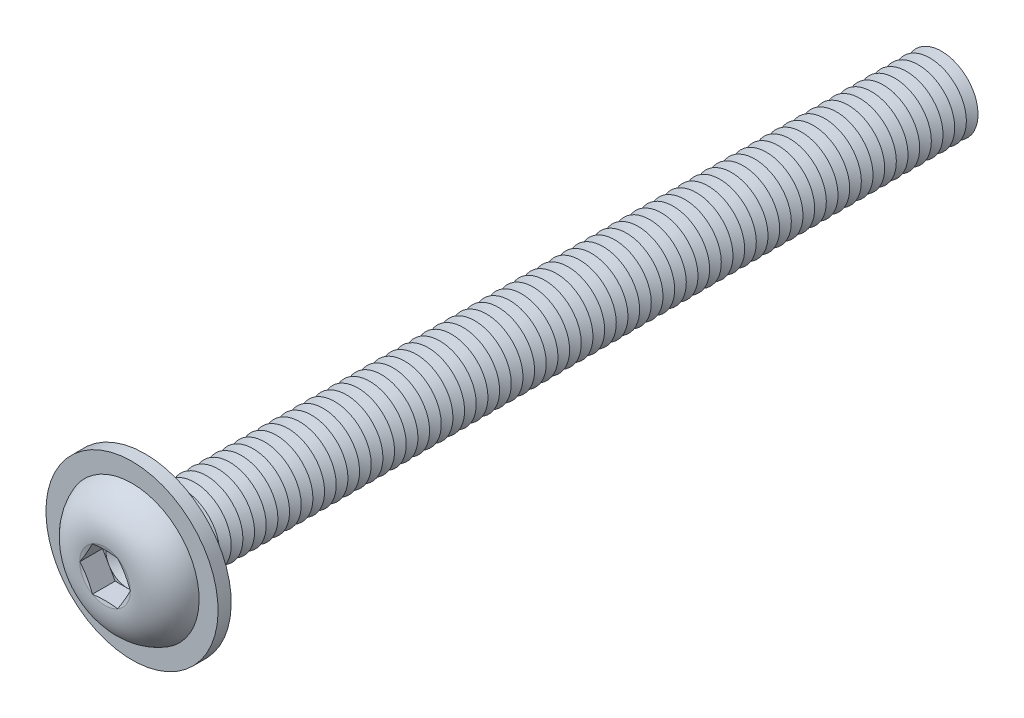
ISO-10303-21;
HEADER;
FILE_DESCRIPTION(('STEP AP214'),'2;1');
FILE_NAME('part.step','',(''),(''),'','','');
FILE_SCHEMA(('AUTOMOTIVE_DESIGN { 1 0 10303 214 1 1 1 1 }'));
ENDSEC;
DATA;
#1=APPLICATION_CONTEXT('core data for automotive mechanical design processes');
#2=APPLICATION_PROTOCOL_DEFINITION('international standard','automotive_design',2000,#1);
#3=PRODUCT_CONTEXT('',#1,'mechanical');
#4=PRODUCT('Part','Part','',(#3));
#5=PRODUCT_RELATED_PRODUCT_CATEGORY('part','',(#4));
#6=PRODUCT_DEFINITION_FORMATION('','',#4);
#7=PRODUCT_DEFINITION_CONTEXT('part definition',#1,'design');
#8=PRODUCT_DEFINITION('design','',#6,#7);
#9=PRODUCT_DEFINITION_SHAPE('','',#8);
#10=(LENGTH_UNIT() NAMED_UNIT(*) SI_UNIT(.MILLI.,.METRE.));
#11=(NAMED_UNIT(*) PLANE_ANGLE_UNIT() SI_UNIT($,.RADIAN.));
#12=(NAMED_UNIT(*) SI_UNIT($,.STERADIAN.) SOLID_ANGLE_UNIT());
#13=UNCERTAINTY_MEASURE_WITH_UNIT(LENGTH_MEASURE(1.E-05),#10,'distance_accuracy_value','');
#14=(GEOMETRIC_REPRESENTATION_CONTEXT(3) GLOBAL_UNCERTAINTY_ASSIGNED_CONTEXT((#13)) GLOBAL_UNIT_ASSIGNED_CONTEXT((#10,
#11,#12)) REPRESENTATION_CONTEXT('',''));
#15=CARTESIAN_POINT('',(0.,0.,0.));
#16=DIRECTION('',(0.,0.,1.));
#17=DIRECTION('',(1.,0.,0.));
#18=AXIS2_PLACEMENT_3D('',#15,#16,#17);
#19=CARTESIAN_POINT('',(0.,0.,-52.2));
#20=DIRECTION('',(0.,0.,1.));
#21=DIRECTION('',(0.,-1.,0.));
#22=AXIS2_PLACEMENT_3D('',#19,#20,#21);
#23=CONICAL_SURFACE('',#22,2.49999999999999,1.0471975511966);
#24=CARTESIAN_POINT('',(0.,0.,-52.6));
#25=DIRECTION('',(0.,0.,1.));
#26=DIRECTION('',(0.,-1.,0.));
#27=AXIS2_PLACEMENT_3D('',#24,#25,#26);
#28=CIRCLE('',#27,1.80717967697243);
#29=CARTESIAN_POINT('',(0.,-1.80717967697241,-52.6));
#30=VERTEX_POINT('',#29);
#31=EDGE_CURVE('E754',#30,#30,#28,.T.);
#32=ORIENTED_EDGE('',*,*,#31,.T.);
#33=EDGE_LOOP('',(#32));
#34=FACE_BOUND('',#33,.T.);
#35=CARTESIAN_POINT('',(0.,0.,-52.2));
#36=DIRECTION('',(0.,0.,1.));
#37=DIRECTION('',(0.,-1.,0.));
#38=AXIS2_PLACEMENT_3D('',#35,#36,#37);
#39=CIRCLE('',#38,2.49999999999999);
#40=CARTESIAN_POINT('',(0.,-2.49999999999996,-52.2));
#41=VERTEX_POINT('',#40);
#42=EDGE_CURVE('E750',#41,#41,#39,.T.);
#43=ORIENTED_EDGE('',*,*,#42,.F.);
#44=EDGE_LOOP('',(#43));
#45=FACE_BOUND('',#44,.T.);
#46=ADVANCED_FACE('F39',(#34,#45),#23,.T.);
#47=CARTESIAN_POINT('',(0.,0.,-52.6));
#48=DIRECTION('',(0.,0.,-1.));
#49=DIRECTION('',(0.,1.,0.));
#50=AXIS2_PLACEMENT_3D('',#47,#48,#49);
#51=CONICAL_SURFACE('',#50,1.80717967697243,1.04719755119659);
#52=CARTESIAN_POINT('',(0.,0.,-53.));
#53=DIRECTION('',(0.,0.,1.));
#54=DIRECTION('',(0.,-1.,0.));
#55=AXIS2_PLACEMENT_3D('',#52,#53,#54);
#56=CIRCLE('',#55,2.49999999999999);
#57=CARTESIAN_POINT('',(0.,-2.49999999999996,-53.));
#58=VERTEX_POINT('',#57);
#59=EDGE_CURVE('E758',#58,#58,#56,.T.);
#60=ORIENTED_EDGE('',*,*,#59,.T.);
#61=EDGE_LOOP('',(#60));
#62=FACE_BOUND('',#61,.T.);
#63=ORIENTED_EDGE('',*,*,#31,.F.);
#64=EDGE_LOOP('',(#63));
#65=FACE_BOUND('',#64,.T.);
#66=ADVANCED_FACE('F878',(#62,#65),#51,.T.);
#67=CARTESIAN_POINT('',(0.,2.49999999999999,-55.));
#68=DIRECTION('',(0.,0.,-1.));
#69=DIRECTION('',(0.,1.,0.));
#70=AXIS2_PLACEMENT_3D('',#67,#68,#69);
#71=PLANE('',#70);
#72=CARTESIAN_POINT('',(0.,0.,-55.));
#73=DIRECTION('',(0.,0.,1.));
#74=DIRECTION('',(0.,-1.,0.));
#75=AXIS2_PLACEMENT_3D('',#72,#73,#74);
#76=CIRCLE('',#75,1.80717967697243);
#77=CARTESIAN_POINT('',(0.,-1.80717967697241,-55.));
#78=VERTEX_POINT('',#77);
#79=EDGE_CURVE('E778',#78,#78,#76,.T.);
#80=ORIENTED_EDGE('',*,*,#79,.F.);
#81=EDGE_LOOP('',(#80));
#82=FACE_BOUND('',#81,.T.);
#83=ADVANCED_FACE('F884',(#82),#71,.T.);
#84=CARTESIAN_POINT('',(0.,0.,-54.6));
#85=DIRECTION('',(0.,0.,1.));
#86=DIRECTION('',(0.,-1.,0.));
#87=AXIS2_PLACEMENT_3D('',#84,#85,#86);
#88=CONICAL_SURFACE('',#87,2.49999999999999,1.0471975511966);
#89=ORIENTED_EDGE('',*,*,#79,.T.);
#90=EDGE_LOOP('',(#89));
#91=FACE_BOUND('',#90,.T.);
#92=CARTESIAN_POINT('',(0.,0.,-54.6));
#93=DIRECTION('',(0.,0.,1.));
#94=DIRECTION('',(0.,-1.,0.));
#95=AXIS2_PLACEMENT_3D('',#92,#93,#94);
#96=CIRCLE('',#95,2.49999999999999);
#97=CARTESIAN_POINT('',(0.,-2.49999999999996,-54.6));
#98=VERTEX_POINT('',#97);
#99=EDGE_CURVE('E774',#98,#98,#96,.T.);
#100=ORIENTED_EDGE('',*,*,#99,.F.);
#101=EDGE_LOOP('',(#100));
#102=FACE_BOUND('',#101,.T.);
#103=ADVANCED_FACE('F903',(#91,#102),#88,.T.);
#104=CARTESIAN_POINT('',(0.,0.,-54.2));
#105=DIRECTION('',(0.,0.,-1.));
#106=DIRECTION('',(0.,1.,0.));
#107=AXIS2_PLACEMENT_3D('',#104,#105,#106);
#108=CONICAL_SURFACE('',#107,1.80717967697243,1.04719755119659);
#109=ORIENTED_EDGE('',*,*,#99,.T.);
#110=EDGE_LOOP('',(#109));
#111=FACE_BOUND('',#110,.T.);
#112=CARTESIAN_POINT('',(0.,0.,-54.2));
#113=DIRECTION('',(0.,0.,1.));
#114=DIRECTION('',(0.,-1.,0.));
#115=AXIS2_PLACEMENT_3D('',#112,#113,#114);
#116=CIRCLE('',#115,1.80717967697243);
#117=CARTESIAN_POINT('',(0.,-1.80717967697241,-54.2));
#118=VERTEX_POINT('',#117);
#119=EDGE_CURVE('E770',#118,#118,#116,.T.);
#120=ORIENTED_EDGE('',*,*,#119,.F.);
#121=EDGE_LOOP('',(#120));
#122=FACE_BOUND('',#121,.T.);
#123=ADVANCED_FACE('F900',(#111,#122),#108,.T.);
#124=CARTESIAN_POINT('',(0.,0.,-53.8));
#125=DIRECTION('',(0.,0.,1.));
#126=DIRECTION('',(0.,-1.,0.));
#127=AXIS2_PLACEMENT_3D('',#124,#125,#126);
#128=CONICAL_SURFACE('',#127,2.49999999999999,1.0471975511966);
#129=ORIENTED_EDGE('',*,*,#119,.T.);
#130=EDGE_LOOP('',(#129));
#131=FACE_BOUND('',#130,.T.);
#132=CARTESIAN_POINT('',(0.,0.,-53.8));
#133=DIRECTION('',(0.,0.,1.));
#134=DIRECTION('',(0.,-1.,0.));
#135=AXIS2_PLACEMENT_3D('',#132,#133,#134);
#136=CIRCLE('',#135,2.49999999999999);
#137=CARTESIAN_POINT('',(0.,-2.49999999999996,-53.8));
#138=VERTEX_POINT('',#137);
#139=EDGE_CURVE('E766',#138,#138,#136,.T.);
#140=ORIENTED_EDGE('',*,*,#139,.F.);
#141=EDGE_LOOP('',(#140));
#142=FACE_BOUND('',#141,.T.);
#143=ADVANCED_FACE('F894',(#131,#142),#128,.T.);
#144=CARTESIAN_POINT('',(0.,0.,-53.4));
#145=DIRECTION('',(0.,0.,-1.));
#146=DIRECTION('',(0.,1.,0.));
#147=AXIS2_PLACEMENT_3D('',#144,#145,#146);
#148=CONICAL_SURFACE('',#147,1.80717967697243,1.04719755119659);
#149=ORIENTED_EDGE('',*,*,#139,.T.);
#150=EDGE_LOOP('',(#149));
#151=FACE_BOUND('',#150,.T.);
#152=CARTESIAN_POINT('',(0.,0.,-53.4));
#153=DIRECTION('',(0.,0.,1.));
#154=DIRECTION('',(0.,-1.,0.));
#155=AXIS2_PLACEMENT_3D('',#152,#153,#154);
#156=CIRCLE('',#155,1.80717967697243);
#157=CARTESIAN_POINT('',(0.,-1.80717967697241,-53.4));
#158=VERTEX_POINT('',#157);
#159=EDGE_CURVE('E762',#158,#158,#156,.T.);
#160=ORIENTED_EDGE('',*,*,#159,.F.);
#161=EDGE_LOOP('',(#160));
#162=FACE_BOUND('',#161,.T.);
#163=ADVANCED_FACE('F890',(#151,#162),#148,.T.);
#164=CARTESIAN_POINT('',(0.,0.,-53.));
#165=DIRECTION('',(0.,0.,1.));
#166=DIRECTION('',(0.,-1.,0.));
#167=AXIS2_PLACEMENT_3D('',#164,#165,#166);
#168=CONICAL_SURFACE('',#167,2.49999999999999,1.0471975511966);
#169=ORIENTED_EDGE('',*,*,#159,.T.);
#170=EDGE_LOOP('',(#169));
#171=FACE_BOUND('',#170,.T.);
#172=ORIENTED_EDGE('',*,*,#59,.F.);
#173=EDGE_LOOP('',(#172));
#174=FACE_BOUND('',#173,.T.);
#175=ADVANCED_FACE('F893',(#171,#174),#168,.T.);
#176=CARTESIAN_POINT('',(0.,0.,-51.4));
#177=DIRECTION('',(0.,0.,1.));
#178=DIRECTION('',(0.,-1.,0.));
#179=AXIS2_PLACEMENT_3D('',#176,#177,#178);
#180=CONICAL_SURFACE('',#179,2.49999999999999,1.0471975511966);
#181=CARTESIAN_POINT('',(0.,0.,-51.8));
#182=DIRECTION('',(0.,0.,1.));
#183=DIRECTION('',(0.,-1.,0.));
#184=AXIS2_PLACEMENT_3D('',#181,#182,#183);
#185=CIRCLE('',#184,1.80717967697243);
#186=CARTESIAN_POINT('',(0.,-1.80717967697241,-51.8));
#187=VERTEX_POINT('',#186);
#188=EDGE_CURVE('E746',#187,#187,#185,.T.);
#189=ORIENTED_EDGE('',*,*,#188,.T.);
#190=EDGE_LOOP('',(#189));
#191=FACE_BOUND('',#190,.T.);
#192=CARTESIAN_POINT('',(0.,0.,-51.4));
#193=DIRECTION('',(0.,0.,1.));
#194=DIRECTION('',(0.,-1.,0.));
#195=AXIS2_PLACEMENT_3D('',#192,#193,#194);
#196=CIRCLE('',#195,2.49999999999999);
#197=CARTESIAN_POINT('',(0.,-2.49999999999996,-51.4));
#198=VERTEX_POINT('',#197);
#199=EDGE_CURVE('E742',#198,#198,#196,.T.);
#200=ORIENTED_EDGE('',*,*,#199,.F.);
#201=EDGE_LOOP('',(#200));
#202=FACE_BOUND('',#201,.T.);
#203=ADVANCED_FACE('F898',(#191,#202),#180,.T.);
#204=CARTESIAN_POINT('',(0.,0.,-51.8));
#205=DIRECTION('',(0.,0.,-1.));
#206=DIRECTION('',(0.,1.,0.));
#207=AXIS2_PLACEMENT_3D('',#204,#205,#206);
#208=CONICAL_SURFACE('',#207,1.80717967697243,1.04719755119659);
#209=ORIENTED_EDGE('',*,*,#42,.T.);
#210=EDGE_LOOP('',(#209));
#211=FACE_BOUND('',#210,.T.);
#212=ORIENTED_EDGE('',*,*,#188,.F.);
#213=EDGE_LOOP('',(#212));
#214=FACE_BOUND('',#213,.T.);
#215=ADVANCED_FACE('F949',(#211,#214),#208,.T.);
#216=CARTESIAN_POINT('',(0.,0.,-50.6));
#217=DIRECTION('',(0.,0.,1.));
#218=DIRECTION('',(0.,-1.,0.));
#219=AXIS2_PLACEMENT_3D('',#216,#217,#218);
#220=CONICAL_SURFACE('',#219,2.49999999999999,1.0471975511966);
#221=CARTESIAN_POINT('',(0.,0.,-51.));
#222=DIRECTION('',(0.,0.,1.));
#223=DIRECTION('',(0.,-1.,0.));
#224=AXIS2_PLACEMENT_3D('',#221,#222,#223);
#225=CIRCLE('',#224,1.80717967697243);
#226=CARTESIAN_POINT('',(0.,-1.80717967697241,-51.));
#227=VERTEX_POINT('',#226);
#228=EDGE_CURVE('E738',#227,#227,#225,.T.);
#229=ORIENTED_EDGE('',*,*,#228,.T.);
#230=EDGE_LOOP('',(#229));
#231=FACE_BOUND('',#230,.T.);
#232=CARTESIAN_POINT('',(0.,0.,-50.6));
#233=DIRECTION('',(0.,0.,1.));
#234=DIRECTION('',(0.,-1.,0.));
#235=AXIS2_PLACEMENT_3D('',#232,#233,#234);
#236=CIRCLE('',#235,2.49999999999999);
#237=CARTESIAN_POINT('',(0.,-2.49999999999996,-50.6));
#238=VERTEX_POINT('',#237);
#239=EDGE_CURVE('E734',#238,#238,#236,.T.);
#240=ORIENTED_EDGE('',*,*,#239,.F.);
#241=EDGE_LOOP('',(#240));
#242=FACE_BOUND('',#241,.T.);
#243=ADVANCED_FACE('F955',(#231,#242),#220,.T.);
#244=CARTESIAN_POINT('',(0.,0.,-51.));
#245=DIRECTION('',(0.,0.,-1.));
#246=DIRECTION('',(0.,1.,0.));
#247=AXIS2_PLACEMENT_3D('',#244,#245,#246);
#248=CONICAL_SURFACE('',#247,1.80717967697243,1.04719755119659);
#249=ORIENTED_EDGE('',*,*,#199,.T.);
#250=EDGE_LOOP('',(#249));
#251=FACE_BOUND('',#250,.T.);
#252=ORIENTED_EDGE('',*,*,#228,.F.);
#253=EDGE_LOOP('',(#252));
#254=FACE_BOUND('',#253,.T.);
#255=ADVANCED_FACE('F962',(#251,#254),#248,.T.);
#256=CARTESIAN_POINT('',(0.,0.,-49.8));
#257=DIRECTION('',(0.,0.,1.));
#258=DIRECTION('',(0.,-1.,0.));
#259=AXIS2_PLACEMENT_3D('',#256,#257,#258);
#260=CONICAL_SURFACE('',#259,2.49999999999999,1.0471975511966);
#261=CARTESIAN_POINT('',(0.,0.,-50.2));
#262=DIRECTION('',(0.,0.,1.));
#263=DIRECTION('',(0.,-1.,0.));
#264=AXIS2_PLACEMENT_3D('',#261,#262,#263);
#265=CIRCLE('',#264,1.80717967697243);
#266=CARTESIAN_POINT('',(0.,-1.80717967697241,-50.2));
#267=VERTEX_POINT('',#266);
#268=EDGE_CURVE('E730',#267,#267,#265,.T.);
#269=ORIENTED_EDGE('',*,*,#268,.T.);
#270=EDGE_LOOP('',(#269));
#271=FACE_BOUND('',#270,.T.);
#272=CARTESIAN_POINT('',(0.,0.,-49.8));
#273=DIRECTION('',(0.,0.,1.));
#274=DIRECTION('',(0.,-1.,0.));
#275=AXIS2_PLACEMENT_3D('',#272,#273,#274);
#276=CIRCLE('',#275,2.49999999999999);
#277=CARTESIAN_POINT('',(0.,-2.49999999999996,-49.8));
#278=VERTEX_POINT('',#277);
#279=EDGE_CURVE('E726',#278,#278,#276,.T.);
#280=ORIENTED_EDGE('',*,*,#279,.F.);
#281=EDGE_LOOP('',(#280));
#282=FACE_BOUND('',#281,.T.);
#283=ADVANCED_FACE('F969',(#271,#282),#260,.T.);
#284=CARTESIAN_POINT('',(0.,0.,-50.2));
#285=DIRECTION('',(0.,0.,-1.));
#286=DIRECTION('',(0.,1.,0.));
#287=AXIS2_PLACEMENT_3D('',#284,#285,#286);
#288=CONICAL_SURFACE('',#287,1.80717967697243,1.04719755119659);
#289=ORIENTED_EDGE('',*,*,#239,.T.);
#290=EDGE_LOOP('',(#289));
#291=FACE_BOUND('',#290,.T.);
#292=ORIENTED_EDGE('',*,*,#268,.F.);
#293=EDGE_LOOP('',(#292));
#294=FACE_BOUND('',#293,.T.);
#295=ADVANCED_FACE('F976',(#291,#294),#288,.T.);
#296=CARTESIAN_POINT('',(0.,0.,-49.));
#297=DIRECTION('',(0.,0.,1.));
#298=DIRECTION('',(0.,-1.,0.));
#299=AXIS2_PLACEMENT_3D('',#296,#297,#298);
#300=CONICAL_SURFACE('',#299,2.49999999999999,1.0471975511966);
#301=CARTESIAN_POINT('',(0.,0.,-49.4));
#302=DIRECTION('',(0.,0.,1.));
#303=DIRECTION('',(0.,-1.,0.));
#304=AXIS2_PLACEMENT_3D('',#301,#302,#303);
#305=CIRCLE('',#304,1.80717967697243);
#306=CARTESIAN_POINT('',(0.,-1.80717967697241,-49.4));
#307=VERTEX_POINT('',#306);
#308=EDGE_CURVE('E722',#307,#307,#305,.T.);
#309=ORIENTED_EDGE('',*,*,#308,.T.);
#310=EDGE_LOOP('',(#309));
#311=FACE_BOUND('',#310,.T.);
#312=CARTESIAN_POINT('',(0.,0.,-49.));
#313=DIRECTION('',(0.,0.,1.));
#314=DIRECTION('',(0.,-1.,0.));
#315=AXIS2_PLACEMENT_3D('',#312,#313,#314);
#316=CIRCLE('',#315,2.49999999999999);
#317=CARTESIAN_POINT('',(0.,-2.49999999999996,-49.));
#318=VERTEX_POINT('',#317);
#319=EDGE_CURVE('E718',#318,#318,#316,.T.);
#320=ORIENTED_EDGE('',*,*,#319,.F.);
#321=EDGE_LOOP('',(#320));
#322=FACE_BOUND('',#321,.T.);
#323=ADVANCED_FACE('F983',(#311,#322),#300,.T.);
#324=CARTESIAN_POINT('',(0.,0.,-49.4));
#325=DIRECTION('',(0.,0.,-1.));
#326=DIRECTION('',(0.,1.,0.));
#327=AXIS2_PLACEMENT_3D('',#324,#325,#326);
#328=CONICAL_SURFACE('',#327,1.80717967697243,1.04719755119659);
#329=ORIENTED_EDGE('',*,*,#279,.T.);
#330=EDGE_LOOP('',(#329));
#331=FACE_BOUND('',#330,.T.);
#332=ORIENTED_EDGE('',*,*,#308,.F.);
#333=EDGE_LOOP('',(#332));
#334=FACE_BOUND('',#333,.T.);
#335=ADVANCED_FACE('F990',(#331,#334),#328,.T.);
#336=CARTESIAN_POINT('',(0.,0.,-48.2));
#337=DIRECTION('',(0.,0.,1.));
#338=DIRECTION('',(0.,-1.,0.));
#339=AXIS2_PLACEMENT_3D('',#336,#337,#338);
#340=CONICAL_SURFACE('',#339,2.49999999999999,1.0471975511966);
#341=CARTESIAN_POINT('',(0.,0.,-48.6));
#342=DIRECTION('',(0.,0.,1.));
#343=DIRECTION('',(0.,-1.,0.));
#344=AXIS2_PLACEMENT_3D('',#341,#342,#343);
#345=CIRCLE('',#344,1.80717967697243);
#346=CARTESIAN_POINT('',(0.,-1.80717967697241,-48.6));
#347=VERTEX_POINT('',#346);
#348=EDGE_CURVE('E714',#347,#347,#345,.T.);
#349=ORIENTED_EDGE('',*,*,#348,.T.);
#350=EDGE_LOOP('',(#349));
#351=FACE_BOUND('',#350,.T.);
#352=CARTESIAN_POINT('',(0.,0.,-48.2));
#353=DIRECTION('',(0.,0.,1.));
#354=DIRECTION('',(0.,-1.,0.));
#355=AXIS2_PLACEMENT_3D('',#352,#353,#354);
#356=CIRCLE('',#355,2.49999999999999);
#357=CARTESIAN_POINT('',(0.,-2.49999999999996,-48.2));
#358=VERTEX_POINT('',#357);
#359=EDGE_CURVE('E710',#358,#358,#356,.T.);
#360=ORIENTED_EDGE('',*,*,#359,.F.);
#361=EDGE_LOOP('',(#360));
#362=FACE_BOUND('',#361,.T.);
#363=ADVANCED_FACE('F997',(#351,#362),#340,.T.);
#364=CARTESIAN_POINT('',(0.,0.,-48.6));
#365=DIRECTION('',(0.,0.,-1.));
#366=DIRECTION('',(0.,1.,0.));
#367=AXIS2_PLACEMENT_3D('',#364,#365,#366);
#368=CONICAL_SURFACE('',#367,1.80717967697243,1.04719755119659);
#369=ORIENTED_EDGE('',*,*,#319,.T.);
#370=EDGE_LOOP('',(#369));
#371=FACE_BOUND('',#370,.T.);
#372=ORIENTED_EDGE('',*,*,#348,.F.);
#373=EDGE_LOOP('',(#372));
#374=FACE_BOUND('',#373,.T.);
#375=ADVANCED_FACE('F1004',(#371,#374),#368,.T.);
#376=CARTESIAN_POINT('',(0.,0.,-47.4));
#377=DIRECTION('',(0.,0.,1.));
#378=DIRECTION('',(0.,-1.,0.));
#379=AXIS2_PLACEMENT_3D('',#376,#377,#378);
#380=CONICAL_SURFACE('',#379,2.49999999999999,1.0471975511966);
#381=CARTESIAN_POINT('',(0.,0.,-47.8));
#382=DIRECTION('',(0.,0.,1.));
#383=DIRECTION('',(0.,-1.,0.));
#384=AXIS2_PLACEMENT_3D('',#381,#382,#383);
#385=CIRCLE('',#384,1.80717967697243);
#386=CARTESIAN_POINT('',(0.,-1.80717967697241,-47.8));
#387=VERTEX_POINT('',#386);
#388=EDGE_CURVE('E706',#387,#387,#385,.T.);
#389=ORIENTED_EDGE('',*,*,#388,.T.);
#390=EDGE_LOOP('',(#389));
#391=FACE_BOUND('',#390,.T.);
#392=CARTESIAN_POINT('',(0.,0.,-47.4));
#393=DIRECTION('',(0.,0.,1.));
#394=DIRECTION('',(0.,-1.,0.));
#395=AXIS2_PLACEMENT_3D('',#392,#393,#394);
#396=CIRCLE('',#395,2.49999999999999);
#397=CARTESIAN_POINT('',(0.,-2.49999999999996,-47.4));
#398=VERTEX_POINT('',#397);
#399=EDGE_CURVE('E702',#398,#398,#396,.T.);
#400=ORIENTED_EDGE('',*,*,#399,.F.);
#401=EDGE_LOOP('',(#400));
#402=FACE_BOUND('',#401,.T.);
#403=ADVANCED_FACE('F1011',(#391,#402),#380,.T.);
#404=CARTESIAN_POINT('',(0.,0.,-47.8));
#405=DIRECTION('',(0.,0.,-1.));
#406=DIRECTION('',(0.,1.,0.));
#407=AXIS2_PLACEMENT_3D('',#404,#405,#406);
#408=CONICAL_SURFACE('',#407,1.80717967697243,1.04719755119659);
#409=ORIENTED_EDGE('',*,*,#359,.T.);
#410=EDGE_LOOP('',(#409));
#411=FACE_BOUND('',#410,.T.);
#412=ORIENTED_EDGE('',*,*,#388,.F.);
#413=EDGE_LOOP('',(#412));
#414=FACE_BOUND('',#413,.T.);
#415=ADVANCED_FACE('F1018',(#411,#414),#408,.T.);
#416=CARTESIAN_POINT('',(0.,0.,-46.6));
#417=DIRECTION('',(0.,0.,1.));
#418=DIRECTION('',(0.,-1.,0.));
#419=AXIS2_PLACEMENT_3D('',#416,#417,#418);
#420=CONICAL_SURFACE('',#419,2.49999999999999,1.0471975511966);
#421=CARTESIAN_POINT('',(0.,0.,-47.));
#422=DIRECTION('',(0.,0.,1.));
#423=DIRECTION('',(0.,-1.,0.));
#424=AXIS2_PLACEMENT_3D('',#421,#422,#423);
#425=CIRCLE('',#424,1.80717967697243);
#426=CARTESIAN_POINT('',(0.,-1.80717967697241,-47.));
#427=VERTEX_POINT('',#426);
#428=EDGE_CURVE('E698',#427,#427,#425,.T.);
#429=ORIENTED_EDGE('',*,*,#428,.T.);
#430=EDGE_LOOP('',(#429));
#431=FACE_BOUND('',#430,.T.);
#432=CARTESIAN_POINT('',(0.,0.,-46.6));
#433=DIRECTION('',(0.,0.,1.));
#434=DIRECTION('',(0.,-1.,0.));
#435=AXIS2_PLACEMENT_3D('',#432,#433,#434);
#436=CIRCLE('',#435,2.49999999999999);
#437=CARTESIAN_POINT('',(0.,-2.49999999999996,-46.6));
#438=VERTEX_POINT('',#437);
#439=EDGE_CURVE('E694',#438,#438,#436,.T.);
#440=ORIENTED_EDGE('',*,*,#439,.F.);
#441=EDGE_LOOP('',(#440));
#442=FACE_BOUND('',#441,.T.);
#443=ADVANCED_FACE('F1025',(#431,#442),#420,.T.);
#444=CARTESIAN_POINT('',(0.,0.,-47.));
#445=DIRECTION('',(0.,0.,-1.));
#446=DIRECTION('',(0.,1.,0.));
#447=AXIS2_PLACEMENT_3D('',#444,#445,#446);
#448=CONICAL_SURFACE('',#447,1.80717967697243,1.04719755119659);
#449=ORIENTED_EDGE('',*,*,#399,.T.);
#450=EDGE_LOOP('',(#449));
#451=FACE_BOUND('',#450,.T.);
#452=ORIENTED_EDGE('',*,*,#428,.F.);
#453=EDGE_LOOP('',(#452));
#454=FACE_BOUND('',#453,.T.);
#455=ADVANCED_FACE('F1032',(#451,#454),#448,.T.);
#456=CARTESIAN_POINT('',(0.,0.,-45.8));
#457=DIRECTION('',(0.,0.,1.));
#458=DIRECTION('',(0.,-1.,0.));
#459=AXIS2_PLACEMENT_3D('',#456,#457,#458);
#460=CONICAL_SURFACE('',#459,2.49999999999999,1.0471975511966);
#461=CARTESIAN_POINT('',(0.,0.,-46.2));
#462=DIRECTION('',(0.,0.,1.));
#463=DIRECTION('',(0.,-1.,0.));
#464=AXIS2_PLACEMENT_3D('',#461,#462,#463);
#465=CIRCLE('',#464,1.80717967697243);
#466=CARTESIAN_POINT('',(0.,-1.80717967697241,-46.2));
#467=VERTEX_POINT('',#466);
#468=EDGE_CURVE('E690',#467,#467,#465,.T.);
#469=ORIENTED_EDGE('',*,*,#468,.T.);
#470=EDGE_LOOP('',(#469));
#471=FACE_BOUND('',#470,.T.);
#472=CARTESIAN_POINT('',(0.,0.,-45.8));
#473=DIRECTION('',(0.,0.,1.));
#474=DIRECTION('',(0.,-1.,0.));
#475=AXIS2_PLACEMENT_3D('',#472,#473,#474);
#476=CIRCLE('',#475,2.49999999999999);
#477=CARTESIAN_POINT('',(0.,-2.49999999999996,-45.8));
#478=VERTEX_POINT('',#477);
#479=EDGE_CURVE('E686',#478,#478,#476,.T.);
#480=ORIENTED_EDGE('',*,*,#479,.F.);
#481=EDGE_LOOP('',(#480));
#482=FACE_BOUND('',#481,.T.);
#483=ADVANCED_FACE('F1039',(#471,#482),#460,.T.);
#484=CARTESIAN_POINT('',(0.,0.,-46.2));
#485=DIRECTION('',(0.,0.,-1.));
#486=DIRECTION('',(0.,1.,0.));
#487=AXIS2_PLACEMENT_3D('',#484,#485,#486);
#488=CONICAL_SURFACE('',#487,1.80717967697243,1.04719755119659);
#489=ORIENTED_EDGE('',*,*,#439,.T.);
#490=EDGE_LOOP('',(#489));
#491=FACE_BOUND('',#490,.T.);
#492=ORIENTED_EDGE('',*,*,#468,.F.);
#493=EDGE_LOOP('',(#492));
#494=FACE_BOUND('',#493,.T.);
#495=ADVANCED_FACE('F1046',(#491,#494),#488,.T.);
#496=CARTESIAN_POINT('',(0.,0.,-45.));
#497=DIRECTION('',(0.,0.,1.));
#498=DIRECTION('',(0.,-1.,0.));
#499=AXIS2_PLACEMENT_3D('',#496,#497,#498);
#500=CONICAL_SURFACE('',#499,2.49999999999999,1.0471975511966);
#501=CARTESIAN_POINT('',(0.,0.,-45.4));
#502=DIRECTION('',(0.,0.,1.));
#503=DIRECTION('',(0.,-1.,0.));
#504=AXIS2_PLACEMENT_3D('',#501,#502,#503);
#505=CIRCLE('',#504,1.80717967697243);
#506=CARTESIAN_POINT('',(0.,-1.80717967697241,-45.4));
#507=VERTEX_POINT('',#506);
#508=EDGE_CURVE('E682',#507,#507,#505,.T.);
#509=ORIENTED_EDGE('',*,*,#508,.T.);
#510=EDGE_LOOP('',(#509));
#511=FACE_BOUND('',#510,.T.);
#512=CARTESIAN_POINT('',(0.,0.,-45.));
#513=DIRECTION('',(0.,0.,1.));
#514=DIRECTION('',(0.,-1.,0.));
#515=AXIS2_PLACEMENT_3D('',#512,#513,#514);
#516=CIRCLE('',#515,2.49999999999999);
#517=CARTESIAN_POINT('',(0.,-2.49999999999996,-45.));
#518=VERTEX_POINT('',#517);
#519=EDGE_CURVE('E678',#518,#518,#516,.T.);
#520=ORIENTED_EDGE('',*,*,#519,.F.);
#521=EDGE_LOOP('',(#520));
#522=FACE_BOUND('',#521,.T.);
#523=ADVANCED_FACE('F1053',(#511,#522),#500,.T.);
#524=CARTESIAN_POINT('',(0.,0.,-45.4));
#525=DIRECTION('',(0.,0.,-1.));
#526=DIRECTION('',(0.,1.,0.));
#527=AXIS2_PLACEMENT_3D('',#524,#525,#526);
#528=CONICAL_SURFACE('',#527,1.80717967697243,1.04719755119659);
#529=ORIENTED_EDGE('',*,*,#479,.T.);
#530=EDGE_LOOP('',(#529));
#531=FACE_BOUND('',#530,.T.);
#532=ORIENTED_EDGE('',*,*,#508,.F.);
#533=EDGE_LOOP('',(#532));
#534=FACE_BOUND('',#533,.T.);
#535=ADVANCED_FACE('F1060',(#531,#534),#528,.T.);
#536=CARTESIAN_POINT('',(0.,0.,-44.2));
#537=DIRECTION('',(0.,0.,1.));
#538=DIRECTION('',(0.,-1.,0.));
#539=AXIS2_PLACEMENT_3D('',#536,#537,#538);
#540=CONICAL_SURFACE('',#539,2.49999999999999,1.0471975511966);
#541=CARTESIAN_POINT('',(0.,0.,-44.6));
#542=DIRECTION('',(0.,0.,1.));
#543=DIRECTION('',(0.,-1.,0.));
#544=AXIS2_PLACEMENT_3D('',#541,#542,#543);
#545=CIRCLE('',#544,1.80717967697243);
#546=CARTESIAN_POINT('',(0.,-1.80717967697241,-44.6));
#547=VERTEX_POINT('',#546);
#548=EDGE_CURVE('E674',#547,#547,#545,.T.);
#549=ORIENTED_EDGE('',*,*,#548,.T.);
#550=EDGE_LOOP('',(#549));
#551=FACE_BOUND('',#550,.T.);
#552=CARTESIAN_POINT('',(0.,0.,-44.2));
#553=DIRECTION('',(0.,0.,1.));
#554=DIRECTION('',(0.,-1.,0.));
#555=AXIS2_PLACEMENT_3D('',#552,#553,#554);
#556=CIRCLE('',#555,2.49999999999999);
#557=CARTESIAN_POINT('',(0.,-2.49999999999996,-44.2));
#558=VERTEX_POINT('',#557);
#559=EDGE_CURVE('E670',#558,#558,#556,.T.);
#560=ORIENTED_EDGE('',*,*,#559,.F.);
#561=EDGE_LOOP('',(#560));
#562=FACE_BOUND('',#561,.T.);
#563=ADVANCED_FACE('F1067',(#551,#562),#540,.T.);
#564=CARTESIAN_POINT('',(0.,0.,-44.6));
#565=DIRECTION('',(0.,0.,-1.));
#566=DIRECTION('',(0.,1.,0.));
#567=AXIS2_PLACEMENT_3D('',#564,#565,#566);
#568=CONICAL_SURFACE('',#567,1.80717967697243,1.04719755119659);
#569=ORIENTED_EDGE('',*,*,#519,.T.);
#570=EDGE_LOOP('',(#569));
#571=FACE_BOUND('',#570,.T.);
#572=ORIENTED_EDGE('',*,*,#548,.F.);
#573=EDGE_LOOP('',(#572));
#574=FACE_BOUND('',#573,.T.);
#575=ADVANCED_FACE('F1074',(#571,#574),#568,.T.);
#576=CARTESIAN_POINT('',(0.,0.,-43.4));
#577=DIRECTION('',(0.,0.,1.));
#578=DIRECTION('',(0.,-1.,0.));
#579=AXIS2_PLACEMENT_3D('',#576,#577,#578);
#580=CONICAL_SURFACE('',#579,2.49999999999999,1.0471975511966);
#581=CARTESIAN_POINT('',(0.,0.,-43.8));
#582=DIRECTION('',(0.,0.,1.));
#583=DIRECTION('',(0.,-1.,0.));
#584=AXIS2_PLACEMENT_3D('',#581,#582,#583);
#585=CIRCLE('',#584,1.80717967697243);
#586=CARTESIAN_POINT('',(0.,-1.80717967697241,-43.8));
#587=VERTEX_POINT('',#586);
#588=EDGE_CURVE('E666',#587,#587,#585,.T.);
#589=ORIENTED_EDGE('',*,*,#588,.T.);
#590=EDGE_LOOP('',(#589));
#591=FACE_BOUND('',#590,.T.);
#592=CARTESIAN_POINT('',(0.,0.,-43.4));
#593=DIRECTION('',(0.,0.,1.));
#594=DIRECTION('',(0.,-1.,0.));
#595=AXIS2_PLACEMENT_3D('',#592,#593,#594);
#596=CIRCLE('',#595,2.49999999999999);
#597=CARTESIAN_POINT('',(0.,-2.49999999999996,-43.4));
#598=VERTEX_POINT('',#597);
#599=EDGE_CURVE('E662',#598,#598,#596,.T.);
#600=ORIENTED_EDGE('',*,*,#599,.F.);
#601=EDGE_LOOP('',(#600));
#602=FACE_BOUND('',#601,.T.);
#603=ADVANCED_FACE('F1081',(#591,#602),#580,.T.);
#604=CARTESIAN_POINT('',(0.,0.,-43.8));
#605=DIRECTION('',(0.,0.,-1.));
#606=DIRECTION('',(0.,1.,0.));
#607=AXIS2_PLACEMENT_3D('',#604,#605,#606);
#608=CONICAL_SURFACE('',#607,1.80717967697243,1.04719755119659);
#609=ORIENTED_EDGE('',*,*,#559,.T.);
#610=EDGE_LOOP('',(#609));
#611=FACE_BOUND('',#610,.T.);
#612=ORIENTED_EDGE('',*,*,#588,.F.);
#613=EDGE_LOOP('',(#612));
#614=FACE_BOUND('',#613,.T.);
#615=ADVANCED_FACE('F1088',(#611,#614),#608,.T.);
#616=CARTESIAN_POINT('',(0.,0.,-42.6));
#617=DIRECTION('',(0.,0.,1.));
#618=DIRECTION('',(0.,-1.,0.));
#619=AXIS2_PLACEMENT_3D('',#616,#617,#618);
#620=CONICAL_SURFACE('',#619,2.49999999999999,1.0471975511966);
#621=CARTESIAN_POINT('',(0.,0.,-43.));
#622=DIRECTION('',(0.,0.,1.));
#623=DIRECTION('',(0.,-1.,0.));
#624=AXIS2_PLACEMENT_3D('',#621,#622,#623);
#625=CIRCLE('',#624,1.80717967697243);
#626=CARTESIAN_POINT('',(0.,-1.80717967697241,-43.));
#627=VERTEX_POINT('',#626);
#628=EDGE_CURVE('E658',#627,#627,#625,.T.);
#629=ORIENTED_EDGE('',*,*,#628,.T.);
#630=EDGE_LOOP('',(#629));
#631=FACE_BOUND('',#630,.T.);
#632=CARTESIAN_POINT('',(0.,0.,-42.6));
#633=DIRECTION('',(0.,0.,1.));
#634=DIRECTION('',(0.,-1.,0.));
#635=AXIS2_PLACEMENT_3D('',#632,#633,#634);
#636=CIRCLE('',#635,2.49999999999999);
#637=CARTESIAN_POINT('',(0.,-2.49999999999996,-42.6));
#638=VERTEX_POINT('',#637);
#639=EDGE_CURVE('E654',#638,#638,#636,.T.);
#640=ORIENTED_EDGE('',*,*,#639,.F.);
#641=EDGE_LOOP('',(#640));
#642=FACE_BOUND('',#641,.T.);
#643=ADVANCED_FACE('F1095',(#631,#642),#620,.T.);
#644=CARTESIAN_POINT('',(0.,0.,-43.));
#645=DIRECTION('',(0.,0.,-1.));
#646=DIRECTION('',(0.,1.,0.));
#647=AXIS2_PLACEMENT_3D('',#644,#645,#646);
#648=CONICAL_SURFACE('',#647,1.80717967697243,1.04719755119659);
#649=ORIENTED_EDGE('',*,*,#599,.T.);
#650=EDGE_LOOP('',(#649));
#651=FACE_BOUND('',#650,.T.);
#652=ORIENTED_EDGE('',*,*,#628,.F.);
#653=EDGE_LOOP('',(#652));
#654=FACE_BOUND('',#653,.T.);
#655=ADVANCED_FACE('F1102',(#651,#654),#648,.T.);
#656=CARTESIAN_POINT('',(0.,0.,-41.8));
#657=DIRECTION('',(0.,0.,1.));
#658=DIRECTION('',(0.,-1.,0.));
#659=AXIS2_PLACEMENT_3D('',#656,#657,#658);
#660=CONICAL_SURFACE('',#659,2.49999999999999,1.0471975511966);
#661=CARTESIAN_POINT('',(0.,0.,-42.2));
#662=DIRECTION('',(0.,0.,1.));
#663=DIRECTION('',(0.,-1.,0.));
#664=AXIS2_PLACEMENT_3D('',#661,#662,#663);
#665=CIRCLE('',#664,1.80717967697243);
#666=CARTESIAN_POINT('',(0.,-1.80717967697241,-42.2));
#667=VERTEX_POINT('',#666);
#668=EDGE_CURVE('E650',#667,#667,#665,.T.);
#669=ORIENTED_EDGE('',*,*,#668,.T.);
#670=EDGE_LOOP('',(#669));
#671=FACE_BOUND('',#670,.T.);
#672=CARTESIAN_POINT('',(0.,0.,-41.8));
#673=DIRECTION('',(0.,0.,1.));
#674=DIRECTION('',(0.,-1.,0.));
#675=AXIS2_PLACEMENT_3D('',#672,#673,#674);
#676=CIRCLE('',#675,2.49999999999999);
#677=CARTESIAN_POINT('',(0.,-2.49999999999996,-41.8));
#678=VERTEX_POINT('',#677);
#679=EDGE_CURVE('E646',#678,#678,#676,.T.);
#680=ORIENTED_EDGE('',*,*,#679,.F.);
#681=EDGE_LOOP('',(#680));
#682=FACE_BOUND('',#681,.T.);
#683=ADVANCED_FACE('F1109',(#671,#682),#660,.T.);
#684=CARTESIAN_POINT('',(0.,0.,-42.2));
#685=DIRECTION('',(0.,0.,-1.));
#686=DIRECTION('',(0.,1.,0.));
#687=AXIS2_PLACEMENT_3D('',#684,#685,#686);
#688=CONICAL_SURFACE('',#687,1.80717967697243,1.04719755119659);
#689=ORIENTED_EDGE('',*,*,#639,.T.);
#690=EDGE_LOOP('',(#689));
#691=FACE_BOUND('',#690,.T.);
#692=ORIENTED_EDGE('',*,*,#668,.F.);
#693=EDGE_LOOP('',(#692));
#694=FACE_BOUND('',#693,.T.);
#695=ADVANCED_FACE('F1116',(#691,#694),#688,.T.);
#696=CARTESIAN_POINT('',(0.,0.,-41.));
#697=DIRECTION('',(0.,0.,1.));
#698=DIRECTION('',(0.,-1.,0.));
#699=AXIS2_PLACEMENT_3D('',#696,#697,#698);
#700=CONICAL_SURFACE('',#699,2.49999999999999,1.0471975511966);
#701=CARTESIAN_POINT('',(0.,0.,-41.4));
#702=DIRECTION('',(0.,0.,1.));
#703=DIRECTION('',(0.,-1.,0.));
#704=AXIS2_PLACEMENT_3D('',#701,#702,#703);
#705=CIRCLE('',#704,1.80717967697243);
#706=CARTESIAN_POINT('',(0.,-1.80717967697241,-41.4));
#707=VERTEX_POINT('',#706);
#708=EDGE_CURVE('E642',#707,#707,#705,.T.);
#709=ORIENTED_EDGE('',*,*,#708,.T.);
#710=EDGE_LOOP('',(#709));
#711=FACE_BOUND('',#710,.T.);
#712=CARTESIAN_POINT('',(0.,0.,-41.));
#713=DIRECTION('',(0.,0.,1.));
#714=DIRECTION('',(0.,-1.,0.));
#715=AXIS2_PLACEMENT_3D('',#712,#713,#714);
#716=CIRCLE('',#715,2.49999999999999);
#717=CARTESIAN_POINT('',(0.,-2.49999999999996,-41.));
#718=VERTEX_POINT('',#717);
#719=EDGE_CURVE('E638',#718,#718,#716,.T.);
#720=ORIENTED_EDGE('',*,*,#719,.F.);
#721=EDGE_LOOP('',(#720));
#722=FACE_BOUND('',#721,.T.);
#723=ADVANCED_FACE('F1123',(#711,#722),#700,.T.);
#724=CARTESIAN_POINT('',(0.,0.,-41.4));
#725=DIRECTION('',(0.,0.,-1.));
#726=DIRECTION('',(0.,1.,0.));
#727=AXIS2_PLACEMENT_3D('',#724,#725,#726);
#728=CONICAL_SURFACE('',#727,1.80717967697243,1.04719755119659);
#729=ORIENTED_EDGE('',*,*,#679,.T.);
#730=EDGE_LOOP('',(#729));
#731=FACE_BOUND('',#730,.T.);
#732=ORIENTED_EDGE('',*,*,#708,.F.);
#733=EDGE_LOOP('',(#732));
#734=FACE_BOUND('',#733,.T.);
#735=ADVANCED_FACE('F1130',(#731,#734),#728,.T.);
#736=CARTESIAN_POINT('',(0.,0.,-40.2));
#737=DIRECTION('',(0.,0.,1.));
#738=DIRECTION('',(0.,-1.,0.));
#739=AXIS2_PLACEMENT_3D('',#736,#737,#738);
#740=CONICAL_SURFACE('',#739,2.49999999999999,1.0471975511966);
#741=CARTESIAN_POINT('',(0.,0.,-40.6));
#742=DIRECTION('',(0.,0.,1.));
#743=DIRECTION('',(0.,-1.,0.));
#744=AXIS2_PLACEMENT_3D('',#741,#742,#743);
#745=CIRCLE('',#744,1.80717967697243);
#746=CARTESIAN_POINT('',(0.,-1.80717967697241,-40.6));
#747=VERTEX_POINT('',#746);
#748=EDGE_CURVE('E634',#747,#747,#745,.T.);
#749=ORIENTED_EDGE('',*,*,#748,.T.);
#750=EDGE_LOOP('',(#749));
#751=FACE_BOUND('',#750,.T.);
#752=CARTESIAN_POINT('',(0.,0.,-40.2));
#753=DIRECTION('',(0.,0.,1.));
#754=DIRECTION('',(0.,-1.,0.));
#755=AXIS2_PLACEMENT_3D('',#752,#753,#754);
#756=CIRCLE('',#755,2.49999999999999);
#757=CARTESIAN_POINT('',(0.,-2.49999999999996,-40.2));
#758=VERTEX_POINT('',#757);
#759=EDGE_CURVE('E630',#758,#758,#756,.T.);
#760=ORIENTED_EDGE('',*,*,#759,.F.);
#761=EDGE_LOOP('',(#760));
#762=FACE_BOUND('',#761,.T.);
#763=ADVANCED_FACE('F1137',(#751,#762),#740,.T.);
#764=CARTESIAN_POINT('',(0.,0.,-40.6));
#765=DIRECTION('',(0.,0.,-1.));
#766=DIRECTION('',(0.,1.,0.));
#767=AXIS2_PLACEMENT_3D('',#764,#765,#766);
#768=CONICAL_SURFACE('',#767,1.80717967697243,1.04719755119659);
#769=ORIENTED_EDGE('',*,*,#719,.T.);
#770=EDGE_LOOP('',(#769));
#771=FACE_BOUND('',#770,.T.);
#772=ORIENTED_EDGE('',*,*,#748,.F.);
#773=EDGE_LOOP('',(#772));
#774=FACE_BOUND('',#773,.T.);
#775=ADVANCED_FACE('F1144',(#771,#774),#768,.T.);
#776=CARTESIAN_POINT('',(0.,0.,-39.4));
#777=DIRECTION('',(0.,0.,1.));
#778=DIRECTION('',(0.,-1.,0.));
#779=AXIS2_PLACEMENT_3D('',#776,#777,#778);
#780=CONICAL_SURFACE('',#779,2.49999999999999,1.0471975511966);
#781=CARTESIAN_POINT('',(0.,0.,-39.8));
#782=DIRECTION('',(0.,0.,1.));
#783=DIRECTION('',(0.,-1.,0.));
#784=AXIS2_PLACEMENT_3D('',#781,#782,#783);
#785=CIRCLE('',#784,1.80717967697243);
#786=CARTESIAN_POINT('',(0.,-1.80717967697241,-39.8));
#787=VERTEX_POINT('',#786);
#788=EDGE_CURVE('E626',#787,#787,#785,.T.);
#789=ORIENTED_EDGE('',*,*,#788,.T.);
#790=EDGE_LOOP('',(#789));
#791=FACE_BOUND('',#790,.T.);
#792=CARTESIAN_POINT('',(0.,0.,-39.4));
#793=DIRECTION('',(0.,0.,1.));
#794=DIRECTION('',(0.,-1.,0.));
#795=AXIS2_PLACEMENT_3D('',#792,#793,#794);
#796=CIRCLE('',#795,2.49999999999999);
#797=CARTESIAN_POINT('',(0.,-2.49999999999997,-39.4));
#798=VERTEX_POINT('',#797);
#799=EDGE_CURVE('E622',#798,#798,#796,.T.);
#800=ORIENTED_EDGE('',*,*,#799,.F.);
#801=EDGE_LOOP('',(#800));
#802=FACE_BOUND('',#801,.T.);
#803=ADVANCED_FACE('F1151',(#791,#802),#780,.T.);
#804=CARTESIAN_POINT('',(0.,0.,-39.8));
#805=DIRECTION('',(0.,0.,-1.));
#806=DIRECTION('',(0.,1.,0.));
#807=AXIS2_PLACEMENT_3D('',#804,#805,#806);
#808=CONICAL_SURFACE('',#807,1.80717967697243,1.04719755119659);
#809=ORIENTED_EDGE('',*,*,#759,.T.);
#810=EDGE_LOOP('',(#809));
#811=FACE_BOUND('',#810,.T.);
#812=ORIENTED_EDGE('',*,*,#788,.F.);
#813=EDGE_LOOP('',(#812));
#814=FACE_BOUND('',#813,.T.);
#815=ADVANCED_FACE('F1158',(#811,#814),#808,.T.);
#816=CARTESIAN_POINT('',(0.,0.,-38.6));
#817=DIRECTION('',(0.,0.,1.));
#818=DIRECTION('',(0.,-1.,0.));
#819=AXIS2_PLACEMENT_3D('',#816,#817,#818);
#820=CONICAL_SURFACE('',#819,2.49999999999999,1.0471975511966);
#821=CARTESIAN_POINT('',(0.,0.,-39.));
#822=DIRECTION('',(0.,0.,1.));
#823=DIRECTION('',(0.,-1.,0.));
#824=AXIS2_PLACEMENT_3D('',#821,#822,#823);
#825=CIRCLE('',#824,1.80717967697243);
#826=CARTESIAN_POINT('',(0.,-1.80717967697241,-39.));
#827=VERTEX_POINT('',#826);
#828=EDGE_CURVE('E618',#827,#827,#825,.T.);
#829=ORIENTED_EDGE('',*,*,#828,.T.);
#830=EDGE_LOOP('',(#829));
#831=FACE_BOUND('',#830,.T.);
#832=CARTESIAN_POINT('',(0.,0.,-38.6));
#833=DIRECTION('',(0.,0.,1.));
#834=DIRECTION('',(0.,-1.,0.));
#835=AXIS2_PLACEMENT_3D('',#832,#833,#834);
#836=CIRCLE('',#835,2.49999999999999);
#837=CARTESIAN_POINT('',(0.,-2.49999999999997,-38.6));
#838=VERTEX_POINT('',#837);
#839=EDGE_CURVE('E614',#838,#838,#836,.T.);
#840=ORIENTED_EDGE('',*,*,#839,.F.);
#841=EDGE_LOOP('',(#840));
#842=FACE_BOUND('',#841,.T.);
#843=ADVANCED_FACE('F1165',(#831,#842),#820,.T.);
#844=CARTESIAN_POINT('',(0.,0.,-39.));
#845=DIRECTION('',(0.,0.,-1.));
#846=DIRECTION('',(0.,1.,0.));
#847=AXIS2_PLACEMENT_3D('',#844,#845,#846);
#848=CONICAL_SURFACE('',#847,1.80717967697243,1.04719755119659);
#849=ORIENTED_EDGE('',*,*,#799,.T.);
#850=EDGE_LOOP('',(#849));
#851=FACE_BOUND('',#850,.T.);
#852=ORIENTED_EDGE('',*,*,#828,.F.);
#853=EDGE_LOOP('',(#852));
#854=FACE_BOUND('',#853,.T.);
#855=ADVANCED_FACE('F1172',(#851,#854),#848,.T.);
#856=CARTESIAN_POINT('',(0.,0.,-37.8));
#857=DIRECTION('',(0.,0.,1.));
#858=DIRECTION('',(0.,-1.,0.));
#859=AXIS2_PLACEMENT_3D('',#856,#857,#858);
#860=CONICAL_SURFACE('',#859,2.49999999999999,1.0471975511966);
#861=CARTESIAN_POINT('',(0.,0.,-38.2));
#862=DIRECTION('',(0.,0.,1.));
#863=DIRECTION('',(0.,-1.,0.));
#864=AXIS2_PLACEMENT_3D('',#861,#862,#863);
#865=CIRCLE('',#864,1.80717967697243);
#866=CARTESIAN_POINT('',(0.,-1.80717967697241,-38.2));
#867=VERTEX_POINT('',#866);
#868=EDGE_CURVE('E610',#867,#867,#865,.T.);
#869=ORIENTED_EDGE('',*,*,#868,.T.);
#870=EDGE_LOOP('',(#869));
#871=FACE_BOUND('',#870,.T.);
#872=CARTESIAN_POINT('',(0.,0.,-37.8));
#873=DIRECTION('',(0.,0.,1.));
#874=DIRECTION('',(0.,-1.,0.));
#875=AXIS2_PLACEMENT_3D('',#872,#873,#874);
#876=CIRCLE('',#875,2.49999999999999);
#877=CARTESIAN_POINT('',(0.,-2.49999999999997,-37.8));
#878=VERTEX_POINT('',#877);
#879=EDGE_CURVE('E606',#878,#878,#876,.T.);
#880=ORIENTED_EDGE('',*,*,#879,.F.);
#881=EDGE_LOOP('',(#880));
#882=FACE_BOUND('',#881,.T.);
#883=ADVANCED_FACE('F1179',(#871,#882),#860,.T.);
#884=CARTESIAN_POINT('',(0.,0.,-38.2));
#885=DIRECTION('',(0.,0.,-1.));
#886=DIRECTION('',(0.,1.,0.));
#887=AXIS2_PLACEMENT_3D('',#884,#885,#886);
#888=CONICAL_SURFACE('',#887,1.80717967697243,1.04719755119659);
#889=ORIENTED_EDGE('',*,*,#839,.T.);
#890=EDGE_LOOP('',(#889));
#891=FACE_BOUND('',#890,.T.);
#892=ORIENTED_EDGE('',*,*,#868,.F.);
#893=EDGE_LOOP('',(#892));
#894=FACE_BOUND('',#893,.T.);
#895=ADVANCED_FACE('F1186',(#891,#894),#888,.T.);
#896=CARTESIAN_POINT('',(0.,0.,-37.));
#897=DIRECTION('',(0.,0.,1.));
#898=DIRECTION('',(0.,-1.,0.));
#899=AXIS2_PLACEMENT_3D('',#896,#897,#898);
#900=CONICAL_SURFACE('',#899,2.49999999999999,1.0471975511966);
#901=CARTESIAN_POINT('',(0.,0.,-37.4));
#902=DIRECTION('',(0.,0.,1.));
#903=DIRECTION('',(0.,-1.,0.));
#904=AXIS2_PLACEMENT_3D('',#901,#902,#903);
#905=CIRCLE('',#904,1.80717967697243);
#906=CARTESIAN_POINT('',(0.,-1.80717967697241,-37.4));
#907=VERTEX_POINT('',#906);
#908=EDGE_CURVE('E602',#907,#907,#905,.T.);
#909=ORIENTED_EDGE('',*,*,#908,.T.);
#910=EDGE_LOOP('',(#909));
#911=FACE_BOUND('',#910,.T.);
#912=CARTESIAN_POINT('',(0.,0.,-37.));
#913=DIRECTION('',(0.,0.,1.));
#914=DIRECTION('',(0.,-1.,0.));
#915=AXIS2_PLACEMENT_3D('',#912,#913,#914);
#916=CIRCLE('',#915,2.49999999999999);
#917=CARTESIAN_POINT('',(0.,-2.49999999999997,-37.));
#918=VERTEX_POINT('',#917);
#919=EDGE_CURVE('E598',#918,#918,#916,.T.);
#920=ORIENTED_EDGE('',*,*,#919,.F.);
#921=EDGE_LOOP('',(#920));
#922=FACE_BOUND('',#921,.T.);
#923=ADVANCED_FACE('F1193',(#911,#922),#900,.T.);
#924=CARTESIAN_POINT('',(0.,0.,-37.4));
#925=DIRECTION('',(0.,0.,-1.));
#926=DIRECTION('',(0.,1.,0.));
#927=AXIS2_PLACEMENT_3D('',#924,#925,#926);
#928=CONICAL_SURFACE('',#927,1.80717967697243,1.04719755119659);
#929=ORIENTED_EDGE('',*,*,#879,.T.);
#930=EDGE_LOOP('',(#929));
#931=FACE_BOUND('',#930,.T.);
#932=ORIENTED_EDGE('',*,*,#908,.F.);
#933=EDGE_LOOP('',(#932));
#934=FACE_BOUND('',#933,.T.);
#935=ADVANCED_FACE('F1200',(#931,#934),#928,.T.);
#936=CARTESIAN_POINT('',(0.,0.,-36.2));
#937=DIRECTION('',(0.,0.,1.));
#938=DIRECTION('',(0.,-1.,0.));
#939=AXIS2_PLACEMENT_3D('',#936,#937,#938);
#940=CONICAL_SURFACE('',#939,2.49999999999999,1.0471975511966);
#941=CARTESIAN_POINT('',(0.,0.,-36.6));
#942=DIRECTION('',(0.,0.,1.));
#943=DIRECTION('',(0.,-1.,0.));
#944=AXIS2_PLACEMENT_3D('',#941,#942,#943);
#945=CIRCLE('',#944,1.80717967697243);
#946=CARTESIAN_POINT('',(0.,-1.80717967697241,-36.6));
#947=VERTEX_POINT('',#946);
#948=EDGE_CURVE('E594',#947,#947,#945,.T.);
#949=ORIENTED_EDGE('',*,*,#948,.T.);
#950=EDGE_LOOP('',(#949));
#951=FACE_BOUND('',#950,.T.);
#952=CARTESIAN_POINT('',(0.,0.,-36.2));
#953=DIRECTION('',(0.,0.,1.));
#954=DIRECTION('',(0.,-1.,0.));
#955=AXIS2_PLACEMENT_3D('',#952,#953,#954);
#956=CIRCLE('',#955,2.49999999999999);
#957=CARTESIAN_POINT('',(0.,-2.49999999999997,-36.2));
#958=VERTEX_POINT('',#957);
#959=EDGE_CURVE('E590',#958,#958,#956,.T.);
#960=ORIENTED_EDGE('',*,*,#959,.F.);
#961=EDGE_LOOP('',(#960));
#962=FACE_BOUND('',#961,.T.);
#963=ADVANCED_FACE('F1207',(#951,#962),#940,.T.);
#964=CARTESIAN_POINT('',(0.,0.,-36.6));
#965=DIRECTION('',(0.,0.,-1.));
#966=DIRECTION('',(0.,1.,0.));
#967=AXIS2_PLACEMENT_3D('',#964,#965,#966);
#968=CONICAL_SURFACE('',#967,1.80717967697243,1.04719755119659);
#969=ORIENTED_EDGE('',*,*,#919,.T.);
#970=EDGE_LOOP('',(#969));
#971=FACE_BOUND('',#970,.T.);
#972=ORIENTED_EDGE('',*,*,#948,.F.);
#973=EDGE_LOOP('',(#972));
#974=FACE_BOUND('',#973,.T.);
#975=ADVANCED_FACE('F1214',(#971,#974),#968,.T.);
#976=CARTESIAN_POINT('',(0.,0.,-35.4));
#977=DIRECTION('',(0.,0.,1.));
#978=DIRECTION('',(0.,-1.,0.));
#979=AXIS2_PLACEMENT_3D('',#976,#977,#978);
#980=CONICAL_SURFACE('',#979,2.49999999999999,1.0471975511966);
#981=CARTESIAN_POINT('',(0.,0.,-35.8));
#982=DIRECTION('',(0.,0.,1.));
#983=DIRECTION('',(0.,-1.,0.));
#984=AXIS2_PLACEMENT_3D('',#981,#982,#983);
#985=CIRCLE('',#984,1.80717967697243);
#986=CARTESIAN_POINT('',(0.,-1.80717967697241,-35.8));
#987=VERTEX_POINT('',#986);
#988=EDGE_CURVE('E586',#987,#987,#985,.T.);
#989=ORIENTED_EDGE('',*,*,#988,.T.);
#990=EDGE_LOOP('',(#989));
#991=FACE_BOUND('',#990,.T.);
#992=CARTESIAN_POINT('',(0.,0.,-35.4));
#993=DIRECTION('',(0.,0.,1.));
#994=DIRECTION('',(0.,-1.,0.));
#995=AXIS2_PLACEMENT_3D('',#992,#993,#994);
#996=CIRCLE('',#995,2.49999999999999);
#997=CARTESIAN_POINT('',(0.,-2.49999999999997,-35.4));
#998=VERTEX_POINT('',#997);
#999=EDGE_CURVE('E582',#998,#998,#996,.T.);
#1000=ORIENTED_EDGE('',*,*,#999,.F.);
#1001=EDGE_LOOP('',(#1000));
#1002=FACE_BOUND('',#1001,.T.);
#1003=ADVANCED_FACE('F1221',(#991,#1002),#980,.T.);
#1004=CARTESIAN_POINT('',(0.,0.,-35.8));
#1005=DIRECTION('',(0.,0.,-1.));
#1006=DIRECTION('',(0.,1.,0.));
#1007=AXIS2_PLACEMENT_3D('',#1004,#1005,#1006);
#1008=CONICAL_SURFACE('',#1007,1.80717967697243,1.04719755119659);
#1009=ORIENTED_EDGE('',*,*,#959,.T.);
#1010=EDGE_LOOP('',(#1009));
#1011=FACE_BOUND('',#1010,.T.);
#1012=ORIENTED_EDGE('',*,*,#988,.F.);
#1013=EDGE_LOOP('',(#1012));
#1014=FACE_BOUND('',#1013,.T.);
#1015=ADVANCED_FACE('F1228',(#1011,#1014),#1008,.T.);
#1016=CARTESIAN_POINT('',(0.,0.,-34.6));
#1017=DIRECTION('',(0.,0.,1.));
#1018=DIRECTION('',(0.,-1.,0.));
#1019=AXIS2_PLACEMENT_3D('',#1016,#1017,#1018);
#1020=CONICAL_SURFACE('',#1019,2.49999999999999,1.0471975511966);
#1021=CARTESIAN_POINT('',(0.,0.,-35.));
#1022=DIRECTION('',(0.,0.,1.));
#1023=DIRECTION('',(0.,-1.,0.));
#1024=AXIS2_PLACEMENT_3D('',#1021,#1022,#1023);
#1025=CIRCLE('',#1024,1.80717967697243);
#1026=CARTESIAN_POINT('',(0.,-1.80717967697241,-35.));
#1027=VERTEX_POINT('',#1026);
#1028=EDGE_CURVE('E578',#1027,#1027,#1025,.T.);
#1029=ORIENTED_EDGE('',*,*,#1028,.T.);
#1030=EDGE_LOOP('',(#1029));
#1031=FACE_BOUND('',#1030,.T.);
#1032=CARTESIAN_POINT('',(0.,0.,-34.6));
#1033=DIRECTION('',(0.,0.,1.));
#1034=DIRECTION('',(0.,-1.,0.));
#1035=AXIS2_PLACEMENT_3D('',#1032,#1033,#1034);
#1036=CIRCLE('',#1035,2.49999999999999);
#1037=CARTESIAN_POINT('',(0.,-2.49999999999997,-34.6));
#1038=VERTEX_POINT('',#1037);
#1039=EDGE_CURVE('E574',#1038,#1038,#1036,.T.);
#1040=ORIENTED_EDGE('',*,*,#1039,.F.);
#1041=EDGE_LOOP('',(#1040));
#1042=FACE_BOUND('',#1041,.T.);
#1043=ADVANCED_FACE('F1235',(#1031,#1042),#1020,.T.);
#1044=CARTESIAN_POINT('',(0.,0.,-35.));
#1045=DIRECTION('',(0.,0.,-1.));
#1046=DIRECTION('',(0.,1.,0.));
#1047=AXIS2_PLACEMENT_3D('',#1044,#1045,#1046);
#1048=CONICAL_SURFACE('',#1047,1.80717967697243,1.04719755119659);
#1049=ORIENTED_EDGE('',*,*,#999,.T.);
#1050=EDGE_LOOP('',(#1049));
#1051=FACE_BOUND('',#1050,.T.);
#1052=ORIENTED_EDGE('',*,*,#1028,.F.);
#1053=EDGE_LOOP('',(#1052));
#1054=FACE_BOUND('',#1053,.T.);
#1055=ADVANCED_FACE('F1242',(#1051,#1054),#1048,.T.);
#1056=CARTESIAN_POINT('',(0.,0.,-33.8));
#1057=DIRECTION('',(0.,0.,1.));
#1058=DIRECTION('',(0.,-1.,0.));
#1059=AXIS2_PLACEMENT_3D('',#1056,#1057,#1058);
#1060=CONICAL_SURFACE('',#1059,2.49999999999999,1.0471975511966);
#1061=CARTESIAN_POINT('',(0.,0.,-34.2));
#1062=DIRECTION('',(0.,0.,1.));
#1063=DIRECTION('',(0.,-1.,0.));
#1064=AXIS2_PLACEMENT_3D('',#1061,#1062,#1063);
#1065=CIRCLE('',#1064,1.80717967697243);
#1066=CARTESIAN_POINT('',(0.,-1.80717967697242,-34.2));
#1067=VERTEX_POINT('',#1066);
#1068=EDGE_CURVE('E570',#1067,#1067,#1065,.T.);
#1069=ORIENTED_EDGE('',*,*,#1068,.T.);
#1070=EDGE_LOOP('',(#1069));
#1071=FACE_BOUND('',#1070,.T.);
#1072=CARTESIAN_POINT('',(0.,0.,-33.8));
#1073=DIRECTION('',(0.,0.,1.));
#1074=DIRECTION('',(0.,-1.,0.));
#1075=AXIS2_PLACEMENT_3D('',#1072,#1073,#1074);
#1076=CIRCLE('',#1075,2.49999999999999);
#1077=CARTESIAN_POINT('',(0.,-2.49999999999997,-33.8));
#1078=VERTEX_POINT('',#1077);
#1079=EDGE_CURVE('E566',#1078,#1078,#1076,.T.);
#1080=ORIENTED_EDGE('',*,*,#1079,.F.);
#1081=EDGE_LOOP('',(#1080));
#1082=FACE_BOUND('',#1081,.T.);
#1083=ADVANCED_FACE('F1249',(#1071,#1082),#1060,.T.);
#1084=CARTESIAN_POINT('',(0.,0.,-34.2));
#1085=DIRECTION('',(0.,0.,-1.));
#1086=DIRECTION('',(0.,1.,0.));
#1087=AXIS2_PLACEMENT_3D('',#1084,#1085,#1086);
#1088=CONICAL_SURFACE('',#1087,1.80717967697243,1.04719755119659);
#1089=ORIENTED_EDGE('',*,*,#1039,.T.);
#1090=EDGE_LOOP('',(#1089));
#1091=FACE_BOUND('',#1090,.T.);
#1092=ORIENTED_EDGE('',*,*,#1068,.F.);
#1093=EDGE_LOOP('',(#1092));
#1094=FACE_BOUND('',#1093,.T.);
#1095=ADVANCED_FACE('F1256',(#1091,#1094),#1088,.T.);
#1096=CARTESIAN_POINT('',(0.,0.,-33.));
#1097=DIRECTION('',(0.,0.,1.));
#1098=DIRECTION('',(0.,-1.,0.));
#1099=AXIS2_PLACEMENT_3D('',#1096,#1097,#1098);
#1100=CONICAL_SURFACE('',#1099,2.49999999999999,1.0471975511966);
#1101=CARTESIAN_POINT('',(0.,0.,-33.4));
#1102=DIRECTION('',(0.,0.,1.));
#1103=DIRECTION('',(0.,-1.,0.));
#1104=AXIS2_PLACEMENT_3D('',#1101,#1102,#1103);
#1105=CIRCLE('',#1104,1.80717967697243);
#1106=CARTESIAN_POINT('',(0.,-1.80717967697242,-33.4));
#1107=VERTEX_POINT('',#1106);
#1108=EDGE_CURVE('E562',#1107,#1107,#1105,.T.);
#1109=ORIENTED_EDGE('',*,*,#1108,.T.);
#1110=EDGE_LOOP('',(#1109));
#1111=FACE_BOUND('',#1110,.T.);
#1112=CARTESIAN_POINT('',(0.,0.,-33.));
#1113=DIRECTION('',(0.,0.,1.));
#1114=DIRECTION('',(0.,-1.,0.));
#1115=AXIS2_PLACEMENT_3D('',#1112,#1113,#1114);
#1116=CIRCLE('',#1115,2.49999999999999);
#1117=CARTESIAN_POINT('',(0.,-2.49999999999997,-33.));
#1118=VERTEX_POINT('',#1117);
#1119=EDGE_CURVE('E558',#1118,#1118,#1116,.T.);
#1120=ORIENTED_EDGE('',*,*,#1119,.F.);
#1121=EDGE_LOOP('',(#1120));
#1122=FACE_BOUND('',#1121,.T.);
#1123=ADVANCED_FACE('F1263',(#1111,#1122),#1100,.T.);
#1124=CARTESIAN_POINT('',(0.,0.,-33.4));
#1125=DIRECTION('',(0.,0.,-1.));
#1126=DIRECTION('',(0.,1.,0.));
#1127=AXIS2_PLACEMENT_3D('',#1124,#1125,#1126);
#1128=CONICAL_SURFACE('',#1127,1.80717967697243,1.04719755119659);
#1129=ORIENTED_EDGE('',*,*,#1079,.T.);
#1130=EDGE_LOOP('',(#1129));
#1131=FACE_BOUND('',#1130,.T.);
#1132=ORIENTED_EDGE('',*,*,#1108,.F.);
#1133=EDGE_LOOP('',(#1132));
#1134=FACE_BOUND('',#1133,.T.);
#1135=ADVANCED_FACE('F1270',(#1131,#1134),#1128,.T.);
#1136=CARTESIAN_POINT('',(0.,0.,-32.2));
#1137=DIRECTION('',(0.,0.,1.));
#1138=DIRECTION('',(0.,-1.,0.));
#1139=AXIS2_PLACEMENT_3D('',#1136,#1137,#1138);
#1140=CONICAL_SURFACE('',#1139,2.49999999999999,1.0471975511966);
#1141=CARTESIAN_POINT('',(0.,0.,-32.6));
#1142=DIRECTION('',(0.,0.,1.));
#1143=DIRECTION('',(0.,-1.,0.));
#1144=AXIS2_PLACEMENT_3D('',#1141,#1142,#1143);
#1145=CIRCLE('',#1144,1.80717967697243);
#1146=CARTESIAN_POINT('',(0.,-1.80717967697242,-32.6));
#1147=VERTEX_POINT('',#1146);
#1148=EDGE_CURVE('E554',#1147,#1147,#1145,.T.);
#1149=ORIENTED_EDGE('',*,*,#1148,.T.);
#1150=EDGE_LOOP('',(#1149));
#1151=FACE_BOUND('',#1150,.T.);
#1152=CARTESIAN_POINT('',(0.,0.,-32.2));
#1153=DIRECTION('',(0.,0.,1.));
#1154=DIRECTION('',(0.,-1.,0.));
#1155=AXIS2_PLACEMENT_3D('',#1152,#1153,#1154);
#1156=CIRCLE('',#1155,2.49999999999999);
#1157=CARTESIAN_POINT('',(0.,-2.49999999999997,-32.2));
#1158=VERTEX_POINT('',#1157);
#1159=EDGE_CURVE('E550',#1158,#1158,#1156,.T.);
#1160=ORIENTED_EDGE('',*,*,#1159,.F.);
#1161=EDGE_LOOP('',(#1160));
#1162=FACE_BOUND('',#1161,.T.);
#1163=ADVANCED_FACE('F1277',(#1151,#1162),#1140,.T.);
#1164=CARTESIAN_POINT('',(0.,0.,-32.6));
#1165=DIRECTION('',(0.,0.,-1.));
#1166=DIRECTION('',(0.,1.,0.));
#1167=AXIS2_PLACEMENT_3D('',#1164,#1165,#1166);
#1168=CONICAL_SURFACE('',#1167,1.80717967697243,1.04719755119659);
#1169=ORIENTED_EDGE('',*,*,#1119,.T.);
#1170=EDGE_LOOP('',(#1169));
#1171=FACE_BOUND('',#1170,.T.);
#1172=ORIENTED_EDGE('',*,*,#1148,.F.);
#1173=EDGE_LOOP('',(#1172));
#1174=FACE_BOUND('',#1173,.T.);
#1175=ADVANCED_FACE('F1284',(#1171,#1174),#1168,.T.);
#1176=CARTESIAN_POINT('',(0.,0.,-31.4));
#1177=DIRECTION('',(0.,0.,1.));
#1178=DIRECTION('',(0.,-1.,0.));
#1179=AXIS2_PLACEMENT_3D('',#1176,#1177,#1178);
#1180=CONICAL_SURFACE('',#1179,2.49999999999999,1.0471975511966);
#1181=CARTESIAN_POINT('',(0.,0.,-31.8));
#1182=DIRECTION('',(0.,0.,1.));
#1183=DIRECTION('',(0.,-1.,0.));
#1184=AXIS2_PLACEMENT_3D('',#1181,#1182,#1183);
#1185=CIRCLE('',#1184,1.80717967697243);
#1186=CARTESIAN_POINT('',(0.,-1.80717967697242,-31.8));
#1187=VERTEX_POINT('',#1186);
#1188=EDGE_CURVE('E546',#1187,#1187,#1185,.T.);
#1189=ORIENTED_EDGE('',*,*,#1188,.T.);
#1190=EDGE_LOOP('',(#1189));
#1191=FACE_BOUND('',#1190,.T.);
#1192=CARTESIAN_POINT('',(0.,0.,-31.4));
#1193=DIRECTION('',(0.,0.,1.));
#1194=DIRECTION('',(0.,-1.,0.));
#1195=AXIS2_PLACEMENT_3D('',#1192,#1193,#1194);
#1196=CIRCLE('',#1195,2.49999999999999);
#1197=CARTESIAN_POINT('',(0.,-2.49999999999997,-31.4));
#1198=VERTEX_POINT('',#1197);
#1199=EDGE_CURVE('E542',#1198,#1198,#1196,.T.);
#1200=ORIENTED_EDGE('',*,*,#1199,.F.);
#1201=EDGE_LOOP('',(#1200));
#1202=FACE_BOUND('',#1201,.T.);
#1203=ADVANCED_FACE('F1291',(#1191,#1202),#1180,.T.);
#1204=CARTESIAN_POINT('',(0.,0.,-31.8));
#1205=DIRECTION('',(0.,0.,-1.));
#1206=DIRECTION('',(0.,1.,0.));
#1207=AXIS2_PLACEMENT_3D('',#1204,#1205,#1206);
#1208=CONICAL_SURFACE('',#1207,1.80717967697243,1.04719755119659);
#1209=ORIENTED_EDGE('',*,*,#1159,.T.);
#1210=EDGE_LOOP('',(#1209));
#1211=FACE_BOUND('',#1210,.T.);
#1212=ORIENTED_EDGE('',*,*,#1188,.F.);
#1213=EDGE_LOOP('',(#1212));
#1214=FACE_BOUND('',#1213,.T.);
#1215=ADVANCED_FACE('F1298',(#1211,#1214),#1208,.T.);
#1216=CARTESIAN_POINT('',(0.,0.,-30.6));
#1217=DIRECTION('',(0.,0.,1.));
#1218=DIRECTION('',(0.,-1.,0.));
#1219=AXIS2_PLACEMENT_3D('',#1216,#1217,#1218);
#1220=CONICAL_SURFACE('',#1219,2.49999999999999,1.0471975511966);
#1221=CARTESIAN_POINT('',(0.,0.,-31.));
#1222=DIRECTION('',(0.,0.,1.));
#1223=DIRECTION('',(0.,-1.,0.));
#1224=AXIS2_PLACEMENT_3D('',#1221,#1222,#1223);
#1225=CIRCLE('',#1224,1.80717967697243);
#1226=CARTESIAN_POINT('',(0.,-1.80717967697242,-31.));
#1227=VERTEX_POINT('',#1226);
#1228=EDGE_CURVE('E538',#1227,#1227,#1225,.T.);
#1229=ORIENTED_EDGE('',*,*,#1228,.T.);
#1230=EDGE_LOOP('',(#1229));
#1231=FACE_BOUND('',#1230,.T.);
#1232=CARTESIAN_POINT('',(0.,0.,-30.6));
#1233=DIRECTION('',(0.,0.,1.));
#1234=DIRECTION('',(0.,-1.,0.));
#1235=AXIS2_PLACEMENT_3D('',#1232,#1233,#1234);
#1236=CIRCLE('',#1235,2.49999999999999);
#1237=CARTESIAN_POINT('',(0.,-2.49999999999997,-30.6));
#1238=VERTEX_POINT('',#1237);
#1239=EDGE_CURVE('E534',#1238,#1238,#1236,.T.);
#1240=ORIENTED_EDGE('',*,*,#1239,.F.);
#1241=EDGE_LOOP('',(#1240));
#1242=FACE_BOUND('',#1241,.T.);
#1243=ADVANCED_FACE('F1305',(#1231,#1242),#1220,.T.);
#1244=CARTESIAN_POINT('',(0.,0.,-31.));
#1245=DIRECTION('',(0.,0.,-1.));
#1246=DIRECTION('',(0.,1.,0.));
#1247=AXIS2_PLACEMENT_3D('',#1244,#1245,#1246);
#1248=CONICAL_SURFACE('',#1247,1.80717967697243,1.04719755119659);
#1249=ORIENTED_EDGE('',*,*,#1199,.T.);
#1250=EDGE_LOOP('',(#1249));
#1251=FACE_BOUND('',#1250,.T.);
#1252=ORIENTED_EDGE('',*,*,#1228,.F.);
#1253=EDGE_LOOP('',(#1252));
#1254=FACE_BOUND('',#1253,.T.);
#1255=ADVANCED_FACE('F1312',(#1251,#1254),#1248,.T.);
#1256=CARTESIAN_POINT('',(0.,0.,-29.8));
#1257=DIRECTION('',(0.,0.,1.));
#1258=DIRECTION('',(0.,-1.,0.));
#1259=AXIS2_PLACEMENT_3D('',#1256,#1257,#1258);
#1260=CONICAL_SURFACE('',#1259,2.49999999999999,1.0471975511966);
#1261=CARTESIAN_POINT('',(0.,0.,-30.2));
#1262=DIRECTION('',(0.,0.,1.));
#1263=DIRECTION('',(0.,-1.,0.));
#1264=AXIS2_PLACEMENT_3D('',#1261,#1262,#1263);
#1265=CIRCLE('',#1264,1.80717967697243);
#1266=CARTESIAN_POINT('',(0.,-1.80717967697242,-30.2));
#1267=VERTEX_POINT('',#1266);
#1268=EDGE_CURVE('E530',#1267,#1267,#1265,.T.);
#1269=ORIENTED_EDGE('',*,*,#1268,.T.);
#1270=EDGE_LOOP('',(#1269));
#1271=FACE_BOUND('',#1270,.T.);
#1272=CARTESIAN_POINT('',(0.,0.,-29.8));
#1273=DIRECTION('',(0.,0.,1.));
#1274=DIRECTION('',(0.,-1.,0.));
#1275=AXIS2_PLACEMENT_3D('',#1272,#1273,#1274);
#1276=CIRCLE('',#1275,2.49999999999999);
#1277=CARTESIAN_POINT('',(0.,-2.49999999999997,-29.8));
#1278=VERTEX_POINT('',#1277);
#1279=EDGE_CURVE('E526',#1278,#1278,#1276,.T.);
#1280=ORIENTED_EDGE('',*,*,#1279,.F.);
#1281=EDGE_LOOP('',(#1280));
#1282=FACE_BOUND('',#1281,.T.);
#1283=ADVANCED_FACE('F1319',(#1271,#1282),#1260,.T.);
#1284=CARTESIAN_POINT('',(0.,0.,-30.2));
#1285=DIRECTION('',(0.,0.,-1.));
#1286=DIRECTION('',(0.,1.,0.));
#1287=AXIS2_PLACEMENT_3D('',#1284,#1285,#1286);
#1288=CONICAL_SURFACE('',#1287,1.80717967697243,1.04719755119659);
#1289=ORIENTED_EDGE('',*,*,#1239,.T.);
#1290=EDGE_LOOP('',(#1289));
#1291=FACE_BOUND('',#1290,.T.);
#1292=ORIENTED_EDGE('',*,*,#1268,.F.);
#1293=EDGE_LOOP('',(#1292));
#1294=FACE_BOUND('',#1293,.T.);
#1295=ADVANCED_FACE('F1326',(#1291,#1294),#1288,.T.);
#1296=CARTESIAN_POINT('',(0.,0.,-29.));
#1297=DIRECTION('',(0.,0.,1.));
#1298=DIRECTION('',(0.,-1.,0.));
#1299=AXIS2_PLACEMENT_3D('',#1296,#1297,#1298);
#1300=CONICAL_SURFACE('',#1299,2.49999999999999,1.0471975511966);
#1301=CARTESIAN_POINT('',(0.,0.,-29.4));
#1302=DIRECTION('',(0.,0.,1.));
#1303=DIRECTION('',(0.,-1.,0.));
#1304=AXIS2_PLACEMENT_3D('',#1301,#1302,#1303);
#1305=CIRCLE('',#1304,1.80717967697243);
#1306=CARTESIAN_POINT('',(0.,-1.80717967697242,-29.4));
#1307=VERTEX_POINT('',#1306);
#1308=EDGE_CURVE('E522',#1307,#1307,#1305,.T.);
#1309=ORIENTED_EDGE('',*,*,#1308,.T.);
#1310=EDGE_LOOP('',(#1309));
#1311=FACE_BOUND('',#1310,.T.);
#1312=CARTESIAN_POINT('',(0.,0.,-29.));
#1313=DIRECTION('',(0.,0.,1.));
#1314=DIRECTION('',(0.,-1.,0.));
#1315=AXIS2_PLACEMENT_3D('',#1312,#1313,#1314);
#1316=CIRCLE('',#1315,2.49999999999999);
#1317=CARTESIAN_POINT('',(0.,-2.49999999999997,-29.));
#1318=VERTEX_POINT('',#1317);
#1319=EDGE_CURVE('E518',#1318,#1318,#1316,.T.);
#1320=ORIENTED_EDGE('',*,*,#1319,.F.);
#1321=EDGE_LOOP('',(#1320));
#1322=FACE_BOUND('',#1321,.T.);
#1323=ADVANCED_FACE('F1333',(#1311,#1322),#1300,.T.);
#1324=CARTESIAN_POINT('',(0.,0.,-29.4));
#1325=DIRECTION('',(0.,0.,-1.));
#1326=DIRECTION('',(0.,1.,0.));
#1327=AXIS2_PLACEMENT_3D('',#1324,#1325,#1326);
#1328=CONICAL_SURFACE('',#1327,1.80717967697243,1.04719755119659);
#1329=ORIENTED_EDGE('',*,*,#1279,.T.);
#1330=EDGE_LOOP('',(#1329));
#1331=FACE_BOUND('',#1330,.T.);
#1332=ORIENTED_EDGE('',*,*,#1308,.F.);
#1333=EDGE_LOOP('',(#1332));
#1334=FACE_BOUND('',#1333,.T.);
#1335=ADVANCED_FACE('F1340',(#1331,#1334),#1328,.T.);
#1336=CARTESIAN_POINT('',(0.,0.,-28.2));
#1337=DIRECTION('',(0.,0.,1.));
#1338=DIRECTION('',(0.,-1.,0.));
#1339=AXIS2_PLACEMENT_3D('',#1336,#1337,#1338);
#1340=CONICAL_SURFACE('',#1339,2.49999999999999,1.0471975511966);
#1341=CARTESIAN_POINT('',(0.,0.,-28.6));
#1342=DIRECTION('',(0.,0.,1.));
#1343=DIRECTION('',(0.,-1.,0.));
#1344=AXIS2_PLACEMENT_3D('',#1341,#1342,#1343);
#1345=CIRCLE('',#1344,1.80717967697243);
#1346=CARTESIAN_POINT('',(0.,-1.80717967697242,-28.6));
#1347=VERTEX_POINT('',#1346);
#1348=EDGE_CURVE('E514',#1347,#1347,#1345,.T.);
#1349=ORIENTED_EDGE('',*,*,#1348,.T.);
#1350=EDGE_LOOP('',(#1349));
#1351=FACE_BOUND('',#1350,.T.);
#1352=CARTESIAN_POINT('',(0.,0.,-28.2));
#1353=DIRECTION('',(0.,0.,1.));
#1354=DIRECTION('',(0.,-1.,0.));
#1355=AXIS2_PLACEMENT_3D('',#1352,#1353,#1354);
#1356=CIRCLE('',#1355,2.49999999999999);
#1357=CARTESIAN_POINT('',(0.,-2.49999999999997,-28.2));
#1358=VERTEX_POINT('',#1357);
#1359=EDGE_CURVE('E510',#1358,#1358,#1356,.T.);
#1360=ORIENTED_EDGE('',*,*,#1359,.F.);
#1361=EDGE_LOOP('',(#1360));
#1362=FACE_BOUND('',#1361,.T.);
#1363=ADVANCED_FACE('F1347',(#1351,#1362),#1340,.T.);
#1364=CARTESIAN_POINT('',(0.,0.,-28.6));
#1365=DIRECTION('',(0.,0.,-1.));
#1366=DIRECTION('',(0.,1.,0.));
#1367=AXIS2_PLACEMENT_3D('',#1364,#1365,#1366);
#1368=CONICAL_SURFACE('',#1367,1.80717967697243,1.04719755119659);
#1369=ORIENTED_EDGE('',*,*,#1319,.T.);
#1370=EDGE_LOOP('',(#1369));
#1371=FACE_BOUND('',#1370,.T.);
#1372=ORIENTED_EDGE('',*,*,#1348,.F.);
#1373=EDGE_LOOP('',(#1372));
#1374=FACE_BOUND('',#1373,.T.);
#1375=ADVANCED_FACE('F1354',(#1371,#1374),#1368,.T.);
#1376=CARTESIAN_POINT('',(0.,0.,-27.4));
#1377=DIRECTION('',(0.,0.,1.));
#1378=DIRECTION('',(0.,-1.,0.));
#1379=AXIS2_PLACEMENT_3D('',#1376,#1377,#1378);
#1380=CONICAL_SURFACE('',#1379,2.49999999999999,1.0471975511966);
#1381=CARTESIAN_POINT('',(0.,0.,-27.8));
#1382=DIRECTION('',(0.,0.,1.));
#1383=DIRECTION('',(0.,-1.,0.));
#1384=AXIS2_PLACEMENT_3D('',#1381,#1382,#1383);
#1385=CIRCLE('',#1384,1.80717967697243);
#1386=CARTESIAN_POINT('',(0.,-1.80717967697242,-27.8));
#1387=VERTEX_POINT('',#1386);
#1388=EDGE_CURVE('E506',#1387,#1387,#1385,.T.);
#1389=ORIENTED_EDGE('',*,*,#1388,.T.);
#1390=EDGE_LOOP('',(#1389));
#1391=FACE_BOUND('',#1390,.T.);
#1392=CARTESIAN_POINT('',(0.,0.,-27.4));
#1393=DIRECTION('',(0.,0.,1.));
#1394=DIRECTION('',(0.,-1.,0.));
#1395=AXIS2_PLACEMENT_3D('',#1392,#1393,#1394);
#1396=CIRCLE('',#1395,2.49999999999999);
#1397=CARTESIAN_POINT('',(0.,-2.49999999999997,-27.4));
#1398=VERTEX_POINT('',#1397);
#1399=EDGE_CURVE('E502',#1398,#1398,#1396,.T.);
#1400=ORIENTED_EDGE('',*,*,#1399,.F.);
#1401=EDGE_LOOP('',(#1400));
#1402=FACE_BOUND('',#1401,.T.);
#1403=ADVANCED_FACE('F1361',(#1391,#1402),#1380,.T.);
#1404=CARTESIAN_POINT('',(0.,0.,-27.8));
#1405=DIRECTION('',(0.,0.,-1.));
#1406=DIRECTION('',(0.,1.,0.));
#1407=AXIS2_PLACEMENT_3D('',#1404,#1405,#1406);
#1408=CONICAL_SURFACE('',#1407,1.80717967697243,1.04719755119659);
#1409=ORIENTED_EDGE('',*,*,#1359,.T.);
#1410=EDGE_LOOP('',(#1409));
#1411=FACE_BOUND('',#1410,.T.);
#1412=ORIENTED_EDGE('',*,*,#1388,.F.);
#1413=EDGE_LOOP('',(#1412));
#1414=FACE_BOUND('',#1413,.T.);
#1415=ADVANCED_FACE('F1368',(#1411,#1414),#1408,.T.);
#1416=CARTESIAN_POINT('',(0.,0.,-26.6));
#1417=DIRECTION('',(0.,0.,1.));
#1418=DIRECTION('',(0.,-1.,0.));
#1419=AXIS2_PLACEMENT_3D('',#1416,#1417,#1418);
#1420=CONICAL_SURFACE('',#1419,2.49999999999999,1.0471975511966);
#1421=CARTESIAN_POINT('',(0.,0.,-27.));
#1422=DIRECTION('',(0.,0.,1.));
#1423=DIRECTION('',(0.,-1.,0.));
#1424=AXIS2_PLACEMENT_3D('',#1421,#1422,#1423);
#1425=CIRCLE('',#1424,1.80717967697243);
#1426=CARTESIAN_POINT('',(0.,-1.80717967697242,-27.));
#1427=VERTEX_POINT('',#1426);
#1428=EDGE_CURVE('E498',#1427,#1427,#1425,.T.);
#1429=ORIENTED_EDGE('',*,*,#1428,.T.);
#1430=EDGE_LOOP('',(#1429));
#1431=FACE_BOUND('',#1430,.T.);
#1432=CARTESIAN_POINT('',(0.,0.,-26.6));
#1433=DIRECTION('',(0.,0.,1.));
#1434=DIRECTION('',(0.,-1.,0.));
#1435=AXIS2_PLACEMENT_3D('',#1432,#1433,#1434);
#1436=CIRCLE('',#1435,2.49999999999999);
#1437=CARTESIAN_POINT('',(0.,-2.49999999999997,-26.6));
#1438=VERTEX_POINT('',#1437);
#1439=EDGE_CURVE('E494',#1438,#1438,#1436,.T.);
#1440=ORIENTED_EDGE('',*,*,#1439,.F.);
#1441=EDGE_LOOP('',(#1440));
#1442=FACE_BOUND('',#1441,.T.);
#1443=ADVANCED_FACE('F1375',(#1431,#1442),#1420,.T.);
#1444=CARTESIAN_POINT('',(0.,0.,-27.));
#1445=DIRECTION('',(0.,0.,-1.));
#1446=DIRECTION('',(0.,1.,0.));
#1447=AXIS2_PLACEMENT_3D('',#1444,#1445,#1446);
#1448=CONICAL_SURFACE('',#1447,1.80717967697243,1.04719755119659);
#1449=ORIENTED_EDGE('',*,*,#1399,.T.);
#1450=EDGE_LOOP('',(#1449));
#1451=FACE_BOUND('',#1450,.T.);
#1452=ORIENTED_EDGE('',*,*,#1428,.F.);
#1453=EDGE_LOOP('',(#1452));
#1454=FACE_BOUND('',#1453,.T.);
#1455=ADVANCED_FACE('F1382',(#1451,#1454),#1448,.T.);
#1456=CARTESIAN_POINT('',(0.,0.,-25.8));
#1457=DIRECTION('',(0.,0.,1.));
#1458=DIRECTION('',(0.,-1.,0.));
#1459=AXIS2_PLACEMENT_3D('',#1456,#1457,#1458);
#1460=CONICAL_SURFACE('',#1459,2.49999999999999,1.0471975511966);
#1461=CARTESIAN_POINT('',(0.,0.,-26.2));
#1462=DIRECTION('',(0.,0.,1.));
#1463=DIRECTION('',(0.,-1.,0.));
#1464=AXIS2_PLACEMENT_3D('',#1461,#1462,#1463);
#1465=CIRCLE('',#1464,1.80717967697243);
#1466=CARTESIAN_POINT('',(0.,-1.80717967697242,-26.2));
#1467=VERTEX_POINT('',#1466);
#1468=EDGE_CURVE('E490',#1467,#1467,#1465,.T.);
#1469=ORIENTED_EDGE('',*,*,#1468,.T.);
#1470=EDGE_LOOP('',(#1469));
#1471=FACE_BOUND('',#1470,.T.);
#1472=CARTESIAN_POINT('',(0.,0.,-25.8));
#1473=DIRECTION('',(0.,0.,1.));
#1474=DIRECTION('',(0.,-1.,0.));
#1475=AXIS2_PLACEMENT_3D('',#1472,#1473,#1474);
#1476=CIRCLE('',#1475,2.49999999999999);
#1477=CARTESIAN_POINT('',(0.,-2.49999999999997,-25.8));
#1478=VERTEX_POINT('',#1477);
#1479=EDGE_CURVE('E486',#1478,#1478,#1476,.T.);
#1480=ORIENTED_EDGE('',*,*,#1479,.F.);
#1481=EDGE_LOOP('',(#1480));
#1482=FACE_BOUND('',#1481,.T.);
#1483=ADVANCED_FACE('F1389',(#1471,#1482),#1460,.T.);
#1484=CARTESIAN_POINT('',(0.,0.,-26.2));
#1485=DIRECTION('',(0.,0.,-1.));
#1486=DIRECTION('',(0.,1.,0.));
#1487=AXIS2_PLACEMENT_3D('',#1484,#1485,#1486);
#1488=CONICAL_SURFACE('',#1487,1.80717967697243,1.04719755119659);
#1489=ORIENTED_EDGE('',*,*,#1439,.T.);
#1490=EDGE_LOOP('',(#1489));
#1491=FACE_BOUND('',#1490,.T.);
#1492=ORIENTED_EDGE('',*,*,#1468,.F.);
#1493=EDGE_LOOP('',(#1492));
#1494=FACE_BOUND('',#1493,.T.);
#1495=ADVANCED_FACE('F1396',(#1491,#1494),#1488,.T.);
#1496=CARTESIAN_POINT('',(0.,0.,-25.));
#1497=DIRECTION('',(0.,0.,1.));
#1498=DIRECTION('',(0.,-1.,0.));
#1499=AXIS2_PLACEMENT_3D('',#1496,#1497,#1498);
#1500=CONICAL_SURFACE('',#1499,2.49999999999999,1.0471975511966);
#1501=CARTESIAN_POINT('',(0.,0.,-25.4));
#1502=DIRECTION('',(0.,0.,1.));
#1503=DIRECTION('',(0.,-1.,0.));
#1504=AXIS2_PLACEMENT_3D('',#1501,#1502,#1503);
#1505=CIRCLE('',#1504,1.80717967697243);
#1506=CARTESIAN_POINT('',(0.,-1.80717967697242,-25.4));
#1507=VERTEX_POINT('',#1506);
#1508=EDGE_CURVE('E482',#1507,#1507,#1505,.T.);
#1509=ORIENTED_EDGE('',*,*,#1508,.T.);
#1510=EDGE_LOOP('',(#1509));
#1511=FACE_BOUND('',#1510,.T.);
#1512=CARTESIAN_POINT('',(0.,0.,-25.));
#1513=DIRECTION('',(0.,0.,1.));
#1514=DIRECTION('',(0.,-1.,0.));
#1515=AXIS2_PLACEMENT_3D('',#1512,#1513,#1514);
#1516=CIRCLE('',#1515,2.49999999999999);
#1517=CARTESIAN_POINT('',(0.,-2.49999999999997,-25.));
#1518=VERTEX_POINT('',#1517);
#1519=EDGE_CURVE('E478',#1518,#1518,#1516,.T.);
#1520=ORIENTED_EDGE('',*,*,#1519,.F.);
#1521=EDGE_LOOP('',(#1520));
#1522=FACE_BOUND('',#1521,.T.);
#1523=ADVANCED_FACE('F1403',(#1511,#1522),#1500,.T.);
#1524=CARTESIAN_POINT('',(0.,0.,-25.4));
#1525=DIRECTION('',(0.,0.,-1.));
#1526=DIRECTION('',(0.,1.,0.));
#1527=AXIS2_PLACEMENT_3D('',#1524,#1525,#1526);
#1528=CONICAL_SURFACE('',#1527,1.80717967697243,1.04719755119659);
#1529=ORIENTED_EDGE('',*,*,#1479,.T.);
#1530=EDGE_LOOP('',(#1529));
#1531=FACE_BOUND('',#1530,.T.);
#1532=ORIENTED_EDGE('',*,*,#1508,.F.);
#1533=EDGE_LOOP('',(#1532));
#1534=FACE_BOUND('',#1533,.T.);
#1535=ADVANCED_FACE('F1410',(#1531,#1534),#1528,.T.);
#1536=CARTESIAN_POINT('',(0.,0.,-24.2));
#1537=DIRECTION('',(0.,0.,1.));
#1538=DIRECTION('',(0.,-1.,0.));
#1539=AXIS2_PLACEMENT_3D('',#1536,#1537,#1538);
#1540=CONICAL_SURFACE('',#1539,2.49999999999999,1.0471975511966);
#1541=CARTESIAN_POINT('',(0.,0.,-24.6));
#1542=DIRECTION('',(0.,0.,1.));
#1543=DIRECTION('',(0.,-1.,0.));
#1544=AXIS2_PLACEMENT_3D('',#1541,#1542,#1543);
#1545=CIRCLE('',#1544,1.80717967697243);
#1546=CARTESIAN_POINT('',(0.,-1.80717967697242,-24.6));
#1547=VERTEX_POINT('',#1546);
#1548=EDGE_CURVE('E474',#1547,#1547,#1545,.T.);
#1549=ORIENTED_EDGE('',*,*,#1548,.T.);
#1550=EDGE_LOOP('',(#1549));
#1551=FACE_BOUND('',#1550,.T.);
#1552=CARTESIAN_POINT('',(0.,0.,-24.2));
#1553=DIRECTION('',(0.,0.,1.));
#1554=DIRECTION('',(0.,-1.,0.));
#1555=AXIS2_PLACEMENT_3D('',#1552,#1553,#1554);
#1556=CIRCLE('',#1555,2.49999999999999);
#1557=CARTESIAN_POINT('',(0.,-2.49999999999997,-24.2));
#1558=VERTEX_POINT('',#1557);
#1559=EDGE_CURVE('E470',#1558,#1558,#1556,.T.);
#1560=ORIENTED_EDGE('',*,*,#1559,.F.);
#1561=EDGE_LOOP('',(#1560));
#1562=FACE_BOUND('',#1561,.T.);
#1563=ADVANCED_FACE('F1417',(#1551,#1562),#1540,.T.);
#1564=CARTESIAN_POINT('',(0.,0.,-24.6));
#1565=DIRECTION('',(0.,0.,-1.));
#1566=DIRECTION('',(0.,1.,0.));
#1567=AXIS2_PLACEMENT_3D('',#1564,#1565,#1566);
#1568=CONICAL_SURFACE('',#1567,1.80717967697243,1.04719755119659);
#1569=ORIENTED_EDGE('',*,*,#1519,.T.);
#1570=EDGE_LOOP('',(#1569));
#1571=FACE_BOUND('',#1570,.T.);
#1572=ORIENTED_EDGE('',*,*,#1548,.F.);
#1573=EDGE_LOOP('',(#1572));
#1574=FACE_BOUND('',#1573,.T.);
#1575=ADVANCED_FACE('F1424',(#1571,#1574),#1568,.T.);
#1576=CARTESIAN_POINT('',(0.,0.,-23.4));
#1577=DIRECTION('',(0.,0.,1.));
#1578=DIRECTION('',(0.,-1.,0.));
#1579=AXIS2_PLACEMENT_3D('',#1576,#1577,#1578);
#1580=CONICAL_SURFACE('',#1579,2.49999999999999,1.0471975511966);
#1581=CARTESIAN_POINT('',(0.,0.,-23.8));
#1582=DIRECTION('',(0.,0.,1.));
#1583=DIRECTION('',(0.,-1.,0.));
#1584=AXIS2_PLACEMENT_3D('',#1581,#1582,#1583);
#1585=CIRCLE('',#1584,1.80717967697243);
#1586=CARTESIAN_POINT('',(0.,-1.80717967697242,-23.8));
#1587=VERTEX_POINT('',#1586);
#1588=EDGE_CURVE('E466',#1587,#1587,#1585,.T.);
#1589=ORIENTED_EDGE('',*,*,#1588,.T.);
#1590=EDGE_LOOP('',(#1589));
#1591=FACE_BOUND('',#1590,.T.);
#1592=CARTESIAN_POINT('',(0.,0.,-23.4));
#1593=DIRECTION('',(0.,0.,1.));
#1594=DIRECTION('',(0.,-1.,0.));
#1595=AXIS2_PLACEMENT_3D('',#1592,#1593,#1594);
#1596=CIRCLE('',#1595,2.49999999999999);
#1597=CARTESIAN_POINT('',(0.,-2.49999999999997,-23.4));
#1598=VERTEX_POINT('',#1597);
#1599=EDGE_CURVE('E462',#1598,#1598,#1596,.T.);
#1600=ORIENTED_EDGE('',*,*,#1599,.F.);
#1601=EDGE_LOOP('',(#1600));
#1602=FACE_BOUND('',#1601,.T.);
#1603=ADVANCED_FACE('F1431',(#1591,#1602),#1580,.T.);
#1604=CARTESIAN_POINT('',(0.,0.,-23.8));
#1605=DIRECTION('',(0.,0.,-1.));
#1606=DIRECTION('',(0.,1.,0.));
#1607=AXIS2_PLACEMENT_3D('',#1604,#1605,#1606);
#1608=CONICAL_SURFACE('',#1607,1.80717967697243,1.04719755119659);
#1609=ORIENTED_EDGE('',*,*,#1559,.T.);
#1610=EDGE_LOOP('',(#1609));
#1611=FACE_BOUND('',#1610,.T.);
#1612=ORIENTED_EDGE('',*,*,#1588,.F.);
#1613=EDGE_LOOP('',(#1612));
#1614=FACE_BOUND('',#1613,.T.);
#1615=ADVANCED_FACE('F1438',(#1611,#1614),#1608,.T.);
#1616=CARTESIAN_POINT('',(0.,0.,-22.6));
#1617=DIRECTION('',(0.,0.,1.));
#1618=DIRECTION('',(0.,-1.,0.));
#1619=AXIS2_PLACEMENT_3D('',#1616,#1617,#1618);
#1620=CONICAL_SURFACE('',#1619,2.49999999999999,1.0471975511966);
#1621=CARTESIAN_POINT('',(0.,0.,-23.));
#1622=DIRECTION('',(0.,0.,1.));
#1623=DIRECTION('',(0.,-1.,0.));
#1624=AXIS2_PLACEMENT_3D('',#1621,#1622,#1623);
#1625=CIRCLE('',#1624,1.80717967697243);
#1626=CARTESIAN_POINT('',(0.,-1.80717967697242,-23.));
#1627=VERTEX_POINT('',#1626);
#1628=EDGE_CURVE('E458',#1627,#1627,#1625,.T.);
#1629=ORIENTED_EDGE('',*,*,#1628,.T.);
#1630=EDGE_LOOP('',(#1629));
#1631=FACE_BOUND('',#1630,.T.);
#1632=CARTESIAN_POINT('',(0.,0.,-22.6));
#1633=DIRECTION('',(0.,0.,1.));
#1634=DIRECTION('',(0.,-1.,0.));
#1635=AXIS2_PLACEMENT_3D('',#1632,#1633,#1634);
#1636=CIRCLE('',#1635,2.49999999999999);
#1637=CARTESIAN_POINT('',(0.,-2.49999999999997,-22.6));
#1638=VERTEX_POINT('',#1637);
#1639=EDGE_CURVE('E454',#1638,#1638,#1636,.T.);
#1640=ORIENTED_EDGE('',*,*,#1639,.F.);
#1641=EDGE_LOOP('',(#1640));
#1642=FACE_BOUND('',#1641,.T.);
#1643=ADVANCED_FACE('F1445',(#1631,#1642),#1620,.T.);
#1644=CARTESIAN_POINT('',(0.,0.,-23.));
#1645=DIRECTION('',(0.,0.,-1.));
#1646=DIRECTION('',(0.,1.,0.));
#1647=AXIS2_PLACEMENT_3D('',#1644,#1645,#1646);
#1648=CONICAL_SURFACE('',#1647,1.80717967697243,1.04719755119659);
#1649=ORIENTED_EDGE('',*,*,#1599,.T.);
#1650=EDGE_LOOP('',(#1649));
#1651=FACE_BOUND('',#1650,.T.);
#1652=ORIENTED_EDGE('',*,*,#1628,.F.);
#1653=EDGE_LOOP('',(#1652));
#1654=FACE_BOUND('',#1653,.T.);
#1655=ADVANCED_FACE('F1452',(#1651,#1654),#1648,.T.);
#1656=CARTESIAN_POINT('',(0.,0.,-21.8));
#1657=DIRECTION('',(0.,0.,1.));
#1658=DIRECTION('',(0.,-1.,0.));
#1659=AXIS2_PLACEMENT_3D('',#1656,#1657,#1658);
#1660=CONICAL_SURFACE('',#1659,2.49999999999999,1.0471975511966);
#1661=CARTESIAN_POINT('',(0.,0.,-22.2));
#1662=DIRECTION('',(0.,0.,1.));
#1663=DIRECTION('',(0.,-1.,0.));
#1664=AXIS2_PLACEMENT_3D('',#1661,#1662,#1663);
#1665=CIRCLE('',#1664,1.80717967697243);
#1666=CARTESIAN_POINT('',(0.,-1.80717967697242,-22.2));
#1667=VERTEX_POINT('',#1666);
#1668=EDGE_CURVE('E450',#1667,#1667,#1665,.T.);
#1669=ORIENTED_EDGE('',*,*,#1668,.T.);
#1670=EDGE_LOOP('',(#1669));
#1671=FACE_BOUND('',#1670,.T.);
#1672=CARTESIAN_POINT('',(0.,0.,-21.8));
#1673=DIRECTION('',(0.,0.,1.));
#1674=DIRECTION('',(0.,-1.,0.));
#1675=AXIS2_PLACEMENT_3D('',#1672,#1673,#1674);
#1676=CIRCLE('',#1675,2.49999999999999);
#1677=CARTESIAN_POINT('',(0.,-2.49999999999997,-21.8));
#1678=VERTEX_POINT('',#1677);
#1679=EDGE_CURVE('E446',#1678,#1678,#1676,.T.);
#1680=ORIENTED_EDGE('',*,*,#1679,.F.);
#1681=EDGE_LOOP('',(#1680));
#1682=FACE_BOUND('',#1681,.T.);
#1683=ADVANCED_FACE('F1459',(#1671,#1682),#1660,.T.);
#1684=CARTESIAN_POINT('',(0.,0.,-22.2));
#1685=DIRECTION('',(0.,0.,-1.));
#1686=DIRECTION('',(0.,1.,0.));
#1687=AXIS2_PLACEMENT_3D('',#1684,#1685,#1686);
#1688=CONICAL_SURFACE('',#1687,1.80717967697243,1.04719755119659);
#1689=ORIENTED_EDGE('',*,*,#1639,.T.);
#1690=EDGE_LOOP('',(#1689));
#1691=FACE_BOUND('',#1690,.T.);
#1692=ORIENTED_EDGE('',*,*,#1668,.F.);
#1693=EDGE_LOOP('',(#1692));
#1694=FACE_BOUND('',#1693,.T.);
#1695=ADVANCED_FACE('F1466',(#1691,#1694),#1688,.T.);
#1696=CARTESIAN_POINT('',(0.,0.,-21.));
#1697=DIRECTION('',(0.,0.,1.));
#1698=DIRECTION('',(0.,-1.,0.));
#1699=AXIS2_PLACEMENT_3D('',#1696,#1697,#1698);
#1700=CONICAL_SURFACE('',#1699,2.49999999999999,1.0471975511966);
#1701=CARTESIAN_POINT('',(0.,0.,-21.4));
#1702=DIRECTION('',(0.,0.,1.));
#1703=DIRECTION('',(0.,-1.,0.));
#1704=AXIS2_PLACEMENT_3D('',#1701,#1702,#1703);
#1705=CIRCLE('',#1704,1.80717967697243);
#1706=CARTESIAN_POINT('',(0.,-1.80717967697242,-21.4));
#1707=VERTEX_POINT('',#1706);
#1708=EDGE_CURVE('E442',#1707,#1707,#1705,.T.);
#1709=ORIENTED_EDGE('',*,*,#1708,.T.);
#1710=EDGE_LOOP('',(#1709));
#1711=FACE_BOUND('',#1710,.T.);
#1712=CARTESIAN_POINT('',(0.,0.,-21.));
#1713=DIRECTION('',(0.,0.,1.));
#1714=DIRECTION('',(0.,-1.,0.));
#1715=AXIS2_PLACEMENT_3D('',#1712,#1713,#1714);
#1716=CIRCLE('',#1715,2.49999999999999);
#1717=CARTESIAN_POINT('',(0.,-2.49999999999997,-21.));
#1718=VERTEX_POINT('',#1717);
#1719=EDGE_CURVE('E438',#1718,#1718,#1716,.T.);
#1720=ORIENTED_EDGE('',*,*,#1719,.F.);
#1721=EDGE_LOOP('',(#1720));
#1722=FACE_BOUND('',#1721,.T.);
#1723=ADVANCED_FACE('F1473',(#1711,#1722),#1700,.T.);
#1724=CARTESIAN_POINT('',(0.,0.,-21.4));
#1725=DIRECTION('',(0.,0.,-1.));
#1726=DIRECTION('',(0.,1.,0.));
#1727=AXIS2_PLACEMENT_3D('',#1724,#1725,#1726);
#1728=CONICAL_SURFACE('',#1727,1.80717967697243,1.04719755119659);
#1729=ORIENTED_EDGE('',*,*,#1679,.T.);
#1730=EDGE_LOOP('',(#1729));
#1731=FACE_BOUND('',#1730,.T.);
#1732=ORIENTED_EDGE('',*,*,#1708,.F.);
#1733=EDGE_LOOP('',(#1732));
#1734=FACE_BOUND('',#1733,.T.);
#1735=ADVANCED_FACE('F1480',(#1731,#1734),#1728,.T.);
#1736=CARTESIAN_POINT('',(0.,0.,-20.2));
#1737=DIRECTION('',(0.,0.,1.));
#1738=DIRECTION('',(0.,-1.,0.));
#1739=AXIS2_PLACEMENT_3D('',#1736,#1737,#1738);
#1740=CONICAL_SURFACE('',#1739,2.49999999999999,1.0471975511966);
#1741=CARTESIAN_POINT('',(0.,0.,-20.6));
#1742=DIRECTION('',(0.,0.,1.));
#1743=DIRECTION('',(0.,-1.,0.));
#1744=AXIS2_PLACEMENT_3D('',#1741,#1742,#1743);
#1745=CIRCLE('',#1744,1.80717967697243);
#1746=CARTESIAN_POINT('',(0.,-1.80717967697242,-20.6));
#1747=VERTEX_POINT('',#1746);
#1748=EDGE_CURVE('E434',#1747,#1747,#1745,.T.);
#1749=ORIENTED_EDGE('',*,*,#1748,.T.);
#1750=EDGE_LOOP('',(#1749));
#1751=FACE_BOUND('',#1750,.T.);
#1752=CARTESIAN_POINT('',(0.,0.,-20.2));
#1753=DIRECTION('',(0.,0.,1.));
#1754=DIRECTION('',(0.,-1.,0.));
#1755=AXIS2_PLACEMENT_3D('',#1752,#1753,#1754);
#1756=CIRCLE('',#1755,2.49999999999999);
#1757=CARTESIAN_POINT('',(0.,-2.49999999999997,-20.2));
#1758=VERTEX_POINT('',#1757);
#1759=EDGE_CURVE('E430',#1758,#1758,#1756,.T.);
#1760=ORIENTED_EDGE('',*,*,#1759,.F.);
#1761=EDGE_LOOP('',(#1760));
#1762=FACE_BOUND('',#1761,.T.);
#1763=ADVANCED_FACE('F1487',(#1751,#1762),#1740,.T.);
#1764=CARTESIAN_POINT('',(0.,0.,-20.6));
#1765=DIRECTION('',(0.,0.,-1.));
#1766=DIRECTION('',(0.,1.,0.));
#1767=AXIS2_PLACEMENT_3D('',#1764,#1765,#1766);
#1768=CONICAL_SURFACE('',#1767,1.80717967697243,1.04719755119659);
#1769=ORIENTED_EDGE('',*,*,#1719,.T.);
#1770=EDGE_LOOP('',(#1769));
#1771=FACE_BOUND('',#1770,.T.);
#1772=ORIENTED_EDGE('',*,*,#1748,.F.);
#1773=EDGE_LOOP('',(#1772));
#1774=FACE_BOUND('',#1773,.T.);
#1775=ADVANCED_FACE('F1494',(#1771,#1774),#1768,.T.);
#1776=CARTESIAN_POINT('',(0.,0.,-19.4));
#1777=DIRECTION('',(0.,0.,1.));
#1778=DIRECTION('',(0.,-1.,0.));
#1779=AXIS2_PLACEMENT_3D('',#1776,#1777,#1778);
#1780=CONICAL_SURFACE('',#1779,2.49999999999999,1.0471975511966);
#1781=CARTESIAN_POINT('',(0.,0.,-19.8));
#1782=DIRECTION('',(0.,0.,1.));
#1783=DIRECTION('',(0.,-1.,0.));
#1784=AXIS2_PLACEMENT_3D('',#1781,#1782,#1783);
#1785=CIRCLE('',#1784,1.80717967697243);
#1786=CARTESIAN_POINT('',(0.,-1.80717967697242,-19.8));
#1787=VERTEX_POINT('',#1786);
#1788=EDGE_CURVE('E426',#1787,#1787,#1785,.T.);
#1789=ORIENTED_EDGE('',*,*,#1788,.T.);
#1790=EDGE_LOOP('',(#1789));
#1791=FACE_BOUND('',#1790,.T.);
#1792=CARTESIAN_POINT('',(0.,0.,-19.4));
#1793=DIRECTION('',(0.,0.,1.));
#1794=DIRECTION('',(0.,-1.,0.));
#1795=AXIS2_PLACEMENT_3D('',#1792,#1793,#1794);
#1796=CIRCLE('',#1795,2.49999999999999);
#1797=CARTESIAN_POINT('',(0.,-2.49999999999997,-19.4));
#1798=VERTEX_POINT('',#1797);
#1799=EDGE_CURVE('E422',#1798,#1798,#1796,.T.);
#1800=ORIENTED_EDGE('',*,*,#1799,.F.);
#1801=EDGE_LOOP('',(#1800));
#1802=FACE_BOUND('',#1801,.T.);
#1803=ADVANCED_FACE('F1501',(#1791,#1802),#1780,.T.);
#1804=CARTESIAN_POINT('',(0.,0.,-19.8));
#1805=DIRECTION('',(0.,0.,-1.));
#1806=DIRECTION('',(0.,1.,0.));
#1807=AXIS2_PLACEMENT_3D('',#1804,#1805,#1806);
#1808=CONICAL_SURFACE('',#1807,1.80717967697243,1.04719755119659);
#1809=ORIENTED_EDGE('',*,*,#1759,.T.);
#1810=EDGE_LOOP('',(#1809));
#1811=FACE_BOUND('',#1810,.T.);
#1812=ORIENTED_EDGE('',*,*,#1788,.F.);
#1813=EDGE_LOOP('',(#1812));
#1814=FACE_BOUND('',#1813,.T.);
#1815=ADVANCED_FACE('F1508',(#1811,#1814),#1808,.T.);
#1816=CARTESIAN_POINT('',(0.,0.,-18.6));
#1817=DIRECTION('',(0.,0.,1.));
#1818=DIRECTION('',(0.,-1.,0.));
#1819=AXIS2_PLACEMENT_3D('',#1816,#1817,#1818);
#1820=CONICAL_SURFACE('',#1819,2.49999999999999,1.0471975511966);
#1821=CARTESIAN_POINT('',(0.,0.,-19.));
#1822=DIRECTION('',(0.,0.,1.));
#1823=DIRECTION('',(0.,-1.,0.));
#1824=AXIS2_PLACEMENT_3D('',#1821,#1822,#1823);
#1825=CIRCLE('',#1824,1.80717967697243);
#1826=CARTESIAN_POINT('',(0.,-1.80717967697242,-19.));
#1827=VERTEX_POINT('',#1826);
#1828=EDGE_CURVE('E418',#1827,#1827,#1825,.T.);
#1829=ORIENTED_EDGE('',*,*,#1828,.T.);
#1830=EDGE_LOOP('',(#1829));
#1831=FACE_BOUND('',#1830,.T.);
#1832=CARTESIAN_POINT('',(0.,0.,-18.6));
#1833=DIRECTION('',(0.,0.,1.));
#1834=DIRECTION('',(0.,-1.,0.));
#1835=AXIS2_PLACEMENT_3D('',#1832,#1833,#1834);
#1836=CIRCLE('',#1835,2.49999999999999);
#1837=CARTESIAN_POINT('',(0.,-2.49999999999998,-18.6));
#1838=VERTEX_POINT('',#1837);
#1839=EDGE_CURVE('E414',#1838,#1838,#1836,.T.);
#1840=ORIENTED_EDGE('',*,*,#1839,.F.);
#1841=EDGE_LOOP('',(#1840));
#1842=FACE_BOUND('',#1841,.T.);
#1843=ADVANCED_FACE('F1515',(#1831,#1842),#1820,.T.);
#1844=CARTESIAN_POINT('',(0.,0.,-19.));
#1845=DIRECTION('',(0.,0.,-1.));
#1846=DIRECTION('',(0.,1.,0.));
#1847=AXIS2_PLACEMENT_3D('',#1844,#1845,#1846);
#1848=CONICAL_SURFACE('',#1847,1.80717967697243,1.04719755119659);
#1849=ORIENTED_EDGE('',*,*,#1799,.T.);
#1850=EDGE_LOOP('',(#1849));
#1851=FACE_BOUND('',#1850,.T.);
#1852=ORIENTED_EDGE('',*,*,#1828,.F.);
#1853=EDGE_LOOP('',(#1852));
#1854=FACE_BOUND('',#1853,.T.);
#1855=ADVANCED_FACE('F1522',(#1851,#1854),#1848,.T.);
#1856=CARTESIAN_POINT('',(0.,0.,-17.8));
#1857=DIRECTION('',(0.,0.,1.));
#1858=DIRECTION('',(0.,-1.,0.));
#1859=AXIS2_PLACEMENT_3D('',#1856,#1857,#1858);
#1860=CONICAL_SURFACE('',#1859,2.49999999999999,1.0471975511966);
#1861=CARTESIAN_POINT('',(0.,0.,-18.2));
#1862=DIRECTION('',(0.,0.,1.));
#1863=DIRECTION('',(0.,-1.,0.));
#1864=AXIS2_PLACEMENT_3D('',#1861,#1862,#1863);
#1865=CIRCLE('',#1864,1.80717967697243);
#1866=CARTESIAN_POINT('',(0.,-1.80717967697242,-18.2));
#1867=VERTEX_POINT('',#1866);
#1868=EDGE_CURVE('E410',#1867,#1867,#1865,.T.);
#1869=ORIENTED_EDGE('',*,*,#1868,.T.);
#1870=EDGE_LOOP('',(#1869));
#1871=FACE_BOUND('',#1870,.T.);
#1872=CARTESIAN_POINT('',(0.,0.,-17.8));
#1873=DIRECTION('',(0.,0.,1.));
#1874=DIRECTION('',(0.,-1.,0.));
#1875=AXIS2_PLACEMENT_3D('',#1872,#1873,#1874);
#1876=CIRCLE('',#1875,2.49999999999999);
#1877=CARTESIAN_POINT('',(0.,-2.49999999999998,-17.8));
#1878=VERTEX_POINT('',#1877);
#1879=EDGE_CURVE('E406',#1878,#1878,#1876,.T.);
#1880=ORIENTED_EDGE('',*,*,#1879,.F.);
#1881=EDGE_LOOP('',(#1880));
#1882=FACE_BOUND('',#1881,.T.);
#1883=ADVANCED_FACE('F1529',(#1871,#1882),#1860,.T.);
#1884=CARTESIAN_POINT('',(0.,0.,-18.2));
#1885=DIRECTION('',(0.,0.,-1.));
#1886=DIRECTION('',(0.,1.,0.));
#1887=AXIS2_PLACEMENT_3D('',#1884,#1885,#1886);
#1888=CONICAL_SURFACE('',#1887,1.80717967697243,1.04719755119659);
#1889=ORIENTED_EDGE('',*,*,#1839,.T.);
#1890=EDGE_LOOP('',(#1889));
#1891=FACE_BOUND('',#1890,.T.);
#1892=ORIENTED_EDGE('',*,*,#1868,.F.);
#1893=EDGE_LOOP('',(#1892));
#1894=FACE_BOUND('',#1893,.T.);
#1895=ADVANCED_FACE('F1536',(#1891,#1894),#1888,.T.);
#1896=CARTESIAN_POINT('',(0.,0.,-17.));
#1897=DIRECTION('',(0.,0.,1.));
#1898=DIRECTION('',(0.,-1.,0.));
#1899=AXIS2_PLACEMENT_3D('',#1896,#1897,#1898);
#1900=CONICAL_SURFACE('',#1899,2.49999999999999,1.0471975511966);
#1901=CARTESIAN_POINT('',(0.,0.,-17.4));
#1902=DIRECTION('',(0.,0.,1.));
#1903=DIRECTION('',(0.,-1.,0.));
#1904=AXIS2_PLACEMENT_3D('',#1901,#1902,#1903);
#1905=CIRCLE('',#1904,1.80717967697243);
#1906=CARTESIAN_POINT('',(0.,-1.80717967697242,-17.4));
#1907=VERTEX_POINT('',#1906);
#1908=EDGE_CURVE('E402',#1907,#1907,#1905,.T.);
#1909=ORIENTED_EDGE('',*,*,#1908,.T.);
#1910=EDGE_LOOP('',(#1909));
#1911=FACE_BOUND('',#1910,.T.);
#1912=CARTESIAN_POINT('',(0.,0.,-17.));
#1913=DIRECTION('',(0.,0.,1.));
#1914=DIRECTION('',(0.,-1.,0.));
#1915=AXIS2_PLACEMENT_3D('',#1912,#1913,#1914);
#1916=CIRCLE('',#1915,2.49999999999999);
#1917=CARTESIAN_POINT('',(0.,-2.49999999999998,-17.));
#1918=VERTEX_POINT('',#1917);
#1919=EDGE_CURVE('E398',#1918,#1918,#1916,.T.);
#1920=ORIENTED_EDGE('',*,*,#1919,.F.);
#1921=EDGE_LOOP('',(#1920));
#1922=FACE_BOUND('',#1921,.T.);
#1923=ADVANCED_FACE('F1543',(#1911,#1922),#1900,.T.);
#1924=CARTESIAN_POINT('',(0.,0.,-17.4));
#1925=DIRECTION('',(0.,0.,-1.));
#1926=DIRECTION('',(0.,1.,0.));
#1927=AXIS2_PLACEMENT_3D('',#1924,#1925,#1926);
#1928=CONICAL_SURFACE('',#1927,1.80717967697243,1.04719755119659);
#1929=ORIENTED_EDGE('',*,*,#1879,.T.);
#1930=EDGE_LOOP('',(#1929));
#1931=FACE_BOUND('',#1930,.T.);
#1932=ORIENTED_EDGE('',*,*,#1908,.F.);
#1933=EDGE_LOOP('',(#1932));
#1934=FACE_BOUND('',#1933,.T.);
#1935=ADVANCED_FACE('F1550',(#1931,#1934),#1928,.T.);
#1936=CARTESIAN_POINT('',(0.,0.,-16.2));
#1937=DIRECTION('',(0.,0.,1.));
#1938=DIRECTION('',(0.,-1.,0.));
#1939=AXIS2_PLACEMENT_3D('',#1936,#1937,#1938);
#1940=CONICAL_SURFACE('',#1939,2.49999999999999,1.0471975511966);
#1941=CARTESIAN_POINT('',(0.,0.,-16.6));
#1942=DIRECTION('',(0.,0.,1.));
#1943=DIRECTION('',(0.,-1.,0.));
#1944=AXIS2_PLACEMENT_3D('',#1941,#1942,#1943);
#1945=CIRCLE('',#1944,1.80717967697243);
#1946=CARTESIAN_POINT('',(0.,-1.80717967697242,-16.6));
#1947=VERTEX_POINT('',#1946);
#1948=EDGE_CURVE('E394',#1947,#1947,#1945,.T.);
#1949=ORIENTED_EDGE('',*,*,#1948,.T.);
#1950=EDGE_LOOP('',(#1949));
#1951=FACE_BOUND('',#1950,.T.);
#1952=CARTESIAN_POINT('',(0.,0.,-16.2));
#1953=DIRECTION('',(0.,0.,1.));
#1954=DIRECTION('',(0.,-1.,0.));
#1955=AXIS2_PLACEMENT_3D('',#1952,#1953,#1954);
#1956=CIRCLE('',#1955,2.49999999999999);
#1957=CARTESIAN_POINT('',(0.,-2.49999999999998,-16.2));
#1958=VERTEX_POINT('',#1957);
#1959=EDGE_CURVE('E390',#1958,#1958,#1956,.T.);
#1960=ORIENTED_EDGE('',*,*,#1959,.F.);
#1961=EDGE_LOOP('',(#1960));
#1962=FACE_BOUND('',#1961,.T.);
#1963=ADVANCED_FACE('F1557',(#1951,#1962),#1940,.T.);
#1964=CARTESIAN_POINT('',(0.,0.,-16.6));
#1965=DIRECTION('',(0.,0.,-1.));
#1966=DIRECTION('',(0.,1.,0.));
#1967=AXIS2_PLACEMENT_3D('',#1964,#1965,#1966);
#1968=CONICAL_SURFACE('',#1967,1.80717967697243,1.04719755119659);
#1969=ORIENTED_EDGE('',*,*,#1919,.T.);
#1970=EDGE_LOOP('',(#1969));
#1971=FACE_BOUND('',#1970,.T.);
#1972=ORIENTED_EDGE('',*,*,#1948,.F.);
#1973=EDGE_LOOP('',(#1972));
#1974=FACE_BOUND('',#1973,.T.);
#1975=ADVANCED_FACE('F1564',(#1971,#1974),#1968,.T.);
#1976=CARTESIAN_POINT('',(0.,0.,-15.4));
#1977=DIRECTION('',(0.,0.,1.));
#1978=DIRECTION('',(0.,-1.,0.));
#1979=AXIS2_PLACEMENT_3D('',#1976,#1977,#1978);
#1980=CONICAL_SURFACE('',#1979,2.49999999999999,1.0471975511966);
#1981=CARTESIAN_POINT('',(0.,0.,-15.8));
#1982=DIRECTION('',(0.,0.,1.));
#1983=DIRECTION('',(0.,-1.,0.));
#1984=AXIS2_PLACEMENT_3D('',#1981,#1982,#1983);
#1985=CIRCLE('',#1984,1.80717967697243);
#1986=CARTESIAN_POINT('',(0.,-1.80717967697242,-15.8));
#1987=VERTEX_POINT('',#1986);
#1988=EDGE_CURVE('E386',#1987,#1987,#1985,.T.);
#1989=ORIENTED_EDGE('',*,*,#1988,.T.);
#1990=EDGE_LOOP('',(#1989));
#1991=FACE_BOUND('',#1990,.T.);
#1992=CARTESIAN_POINT('',(0.,0.,-15.4));
#1993=DIRECTION('',(0.,0.,1.));
#1994=DIRECTION('',(0.,-1.,0.));
#1995=AXIS2_PLACEMENT_3D('',#1992,#1993,#1994);
#1996=CIRCLE('',#1995,2.49999999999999);
#1997=CARTESIAN_POINT('',(0.,-2.49999999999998,-15.4));
#1998=VERTEX_POINT('',#1997);
#1999=EDGE_CURVE('E382',#1998,#1998,#1996,.T.);
#2000=ORIENTED_EDGE('',*,*,#1999,.F.);
#2001=EDGE_LOOP('',(#2000));
#2002=FACE_BOUND('',#2001,.T.);
#2003=ADVANCED_FACE('F1571',(#1991,#2002),#1980,.T.);
#2004=CARTESIAN_POINT('',(0.,0.,-15.8));
#2005=DIRECTION('',(0.,0.,-1.));
#2006=DIRECTION('',(0.,1.,0.));
#2007=AXIS2_PLACEMENT_3D('',#2004,#2005,#2006);
#2008=CONICAL_SURFACE('',#2007,1.80717967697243,1.04719755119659);
#2009=ORIENTED_EDGE('',*,*,#1959,.T.);
#2010=EDGE_LOOP('',(#2009));
#2011=FACE_BOUND('',#2010,.T.);
#2012=ORIENTED_EDGE('',*,*,#1988,.F.);
#2013=EDGE_LOOP('',(#2012));
#2014=FACE_BOUND('',#2013,.T.);
#2015=ADVANCED_FACE('F1578',(#2011,#2014),#2008,.T.);
#2016=CARTESIAN_POINT('',(0.,0.,-14.6));
#2017=DIRECTION('',(0.,0.,1.));
#2018=DIRECTION('',(0.,-1.,0.));
#2019=AXIS2_PLACEMENT_3D('',#2016,#2017,#2018);
#2020=CONICAL_SURFACE('',#2019,2.49999999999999,1.0471975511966);
#2021=CARTESIAN_POINT('',(0.,0.,-15.));
#2022=DIRECTION('',(0.,0.,1.));
#2023=DIRECTION('',(0.,-1.,0.));
#2024=AXIS2_PLACEMENT_3D('',#2021,#2022,#2023);
#2025=CIRCLE('',#2024,1.80717967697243);
#2026=CARTESIAN_POINT('',(0.,-1.80717967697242,-15.));
#2027=VERTEX_POINT('',#2026);
#2028=EDGE_CURVE('E378',#2027,#2027,#2025,.T.);
#2029=ORIENTED_EDGE('',*,*,#2028,.T.);
#2030=EDGE_LOOP('',(#2029));
#2031=FACE_BOUND('',#2030,.T.);
#2032=CARTESIAN_POINT('',(0.,0.,-14.6));
#2033=DIRECTION('',(0.,0.,1.));
#2034=DIRECTION('',(0.,-1.,0.));
#2035=AXIS2_PLACEMENT_3D('',#2032,#2033,#2034);
#2036=CIRCLE('',#2035,2.49999999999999);
#2037=CARTESIAN_POINT('',(0.,-2.49999999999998,-14.6));
#2038=VERTEX_POINT('',#2037);
#2039=EDGE_CURVE('E374',#2038,#2038,#2036,.T.);
#2040=ORIENTED_EDGE('',*,*,#2039,.F.);
#2041=EDGE_LOOP('',(#2040));
#2042=FACE_BOUND('',#2041,.T.);
#2043=ADVANCED_FACE('F1585',(#2031,#2042),#2020,.T.);
#2044=CARTESIAN_POINT('',(0.,0.,-15.));
#2045=DIRECTION('',(0.,0.,-1.));
#2046=DIRECTION('',(0.,1.,0.));
#2047=AXIS2_PLACEMENT_3D('',#2044,#2045,#2046);
#2048=CONICAL_SURFACE('',#2047,1.80717967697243,1.04719755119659);
#2049=ORIENTED_EDGE('',*,*,#1999,.T.);
#2050=EDGE_LOOP('',(#2049));
#2051=FACE_BOUND('',#2050,.T.);
#2052=ORIENTED_EDGE('',*,*,#2028,.F.);
#2053=EDGE_LOOP('',(#2052));
#2054=FACE_BOUND('',#2053,.T.);
#2055=ADVANCED_FACE('F1592',(#2051,#2054),#2048,.T.);
#2056=CARTESIAN_POINT('',(0.,0.,-13.8));
#2057=DIRECTION('',(0.,0.,1.));
#2058=DIRECTION('',(0.,-1.,0.));
#2059=AXIS2_PLACEMENT_3D('',#2056,#2057,#2058);
#2060=CONICAL_SURFACE('',#2059,2.49999999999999,1.0471975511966);
#2061=CARTESIAN_POINT('',(0.,0.,-14.2));
#2062=DIRECTION('',(0.,0.,1.));
#2063=DIRECTION('',(0.,-1.,0.));
#2064=AXIS2_PLACEMENT_3D('',#2061,#2062,#2063);
#2065=CIRCLE('',#2064,1.80717967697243);
#2066=CARTESIAN_POINT('',(0.,-1.80717967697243,-14.2));
#2067=VERTEX_POINT('',#2066);
#2068=EDGE_CURVE('E370',#2067,#2067,#2065,.T.);
#2069=ORIENTED_EDGE('',*,*,#2068,.T.);
#2070=EDGE_LOOP('',(#2069));
#2071=FACE_BOUND('',#2070,.T.);
#2072=CARTESIAN_POINT('',(0.,0.,-13.8));
#2073=DIRECTION('',(0.,0.,1.));
#2074=DIRECTION('',(0.,-1.,0.));
#2075=AXIS2_PLACEMENT_3D('',#2072,#2073,#2074);
#2076=CIRCLE('',#2075,2.49999999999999);
#2077=CARTESIAN_POINT('',(0.,-2.49999999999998,-13.8));
#2078=VERTEX_POINT('',#2077);
#2079=EDGE_CURVE('E366',#2078,#2078,#2076,.T.);
#2080=ORIENTED_EDGE('',*,*,#2079,.F.);
#2081=EDGE_LOOP('',(#2080));
#2082=FACE_BOUND('',#2081,.T.);
#2083=ADVANCED_FACE('F1599',(#2071,#2082),#2060,.T.);
#2084=CARTESIAN_POINT('',(0.,0.,-14.2));
#2085=DIRECTION('',(0.,0.,-1.));
#2086=DIRECTION('',(0.,1.,0.));
#2087=AXIS2_PLACEMENT_3D('',#2084,#2085,#2086);
#2088=CONICAL_SURFACE('',#2087,1.80717967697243,1.04719755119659);
#2089=ORIENTED_EDGE('',*,*,#2039,.T.);
#2090=EDGE_LOOP('',(#2089));
#2091=FACE_BOUND('',#2090,.T.);
#2092=ORIENTED_EDGE('',*,*,#2068,.F.);
#2093=EDGE_LOOP('',(#2092));
#2094=FACE_BOUND('',#2093,.T.);
#2095=ADVANCED_FACE('F1606',(#2091,#2094),#2088,.T.);
#2096=CARTESIAN_POINT('',(0.,0.,-13.));
#2097=DIRECTION('',(0.,0.,1.));
#2098=DIRECTION('',(0.,-1.,0.));
#2099=AXIS2_PLACEMENT_3D('',#2096,#2097,#2098);
#2100=CONICAL_SURFACE('',#2099,2.49999999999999,1.0471975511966);
#2101=CARTESIAN_POINT('',(0.,0.,-13.4));
#2102=DIRECTION('',(0.,0.,1.));
#2103=DIRECTION('',(0.,-1.,0.));
#2104=AXIS2_PLACEMENT_3D('',#2101,#2102,#2103);
#2105=CIRCLE('',#2104,1.80717967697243);
#2106=CARTESIAN_POINT('',(0.,-1.80717967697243,-13.4));
#2107=VERTEX_POINT('',#2106);
#2108=EDGE_CURVE('E362',#2107,#2107,#2105,.T.);
#2109=ORIENTED_EDGE('',*,*,#2108,.T.);
#2110=EDGE_LOOP('',(#2109));
#2111=FACE_BOUND('',#2110,.T.);
#2112=CARTESIAN_POINT('',(0.,0.,-13.));
#2113=DIRECTION('',(0.,0.,1.));
#2114=DIRECTION('',(0.,-1.,0.));
#2115=AXIS2_PLACEMENT_3D('',#2112,#2113,#2114);
#2116=CIRCLE('',#2115,2.49999999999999);
#2117=CARTESIAN_POINT('',(0.,-2.49999999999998,-13.));
#2118=VERTEX_POINT('',#2117);
#2119=EDGE_CURVE('E358',#2118,#2118,#2116,.T.);
#2120=ORIENTED_EDGE('',*,*,#2119,.F.);
#2121=EDGE_LOOP('',(#2120));
#2122=FACE_BOUND('',#2121,.T.);
#2123=ADVANCED_FACE('F1613',(#2111,#2122),#2100,.T.);
#2124=CARTESIAN_POINT('',(0.,0.,-13.4));
#2125=DIRECTION('',(0.,0.,-1.));
#2126=DIRECTION('',(0.,1.,0.));
#2127=AXIS2_PLACEMENT_3D('',#2124,#2125,#2126);
#2128=CONICAL_SURFACE('',#2127,1.80717967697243,1.04719755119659);
#2129=ORIENTED_EDGE('',*,*,#2079,.T.);
#2130=EDGE_LOOP('',(#2129));
#2131=FACE_BOUND('',#2130,.T.);
#2132=ORIENTED_EDGE('',*,*,#2108,.F.);
#2133=EDGE_LOOP('',(#2132));
#2134=FACE_BOUND('',#2133,.T.);
#2135=ADVANCED_FACE('F1620',(#2131,#2134),#2128,.T.);
#2136=CARTESIAN_POINT('',(0.,0.,-12.2));
#2137=DIRECTION('',(0.,0.,1.));
#2138=DIRECTION('',(0.,-1.,0.));
#2139=AXIS2_PLACEMENT_3D('',#2136,#2137,#2138);
#2140=CONICAL_SURFACE('',#2139,2.49999999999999,1.0471975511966);
#2141=CARTESIAN_POINT('',(0.,0.,-12.6));
#2142=DIRECTION('',(0.,0.,1.));
#2143=DIRECTION('',(0.,-1.,0.));
#2144=AXIS2_PLACEMENT_3D('',#2141,#2142,#2143);
#2145=CIRCLE('',#2144,1.80717967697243);
#2146=CARTESIAN_POINT('',(0.,-1.80717967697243,-12.6));
#2147=VERTEX_POINT('',#2146);
#2148=EDGE_CURVE('E354',#2147,#2147,#2145,.T.);
#2149=ORIENTED_EDGE('',*,*,#2148,.T.);
#2150=EDGE_LOOP('',(#2149));
#2151=FACE_BOUND('',#2150,.T.);
#2152=CARTESIAN_POINT('',(0.,0.,-12.2));
#2153=DIRECTION('',(0.,0.,1.));
#2154=DIRECTION('',(0.,-1.,0.));
#2155=AXIS2_PLACEMENT_3D('',#2152,#2153,#2154);
#2156=CIRCLE('',#2155,2.49999999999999);
#2157=CARTESIAN_POINT('',(0.,-2.49999999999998,-12.2));
#2158=VERTEX_POINT('',#2157);
#2159=EDGE_CURVE('E350',#2158,#2158,#2156,.T.);
#2160=ORIENTED_EDGE('',*,*,#2159,.F.);
#2161=EDGE_LOOP('',(#2160));
#2162=FACE_BOUND('',#2161,.T.);
#2163=ADVANCED_FACE('F1627',(#2151,#2162),#2140,.T.);
#2164=CARTESIAN_POINT('',(0.,0.,-12.6));
#2165=DIRECTION('',(0.,0.,-1.));
#2166=DIRECTION('',(0.,1.,0.));
#2167=AXIS2_PLACEMENT_3D('',#2164,#2165,#2166);
#2168=CONICAL_SURFACE('',#2167,1.80717967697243,1.04719755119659);
#2169=ORIENTED_EDGE('',*,*,#2119,.T.);
#2170=EDGE_LOOP('',(#2169));
#2171=FACE_BOUND('',#2170,.T.);
#2172=ORIENTED_EDGE('',*,*,#2148,.F.);
#2173=EDGE_LOOP('',(#2172));
#2174=FACE_BOUND('',#2173,.T.);
#2175=ADVANCED_FACE('F1634',(#2171,#2174),#2168,.T.);
#2176=CARTESIAN_POINT('',(0.,0.,-11.4));
#2177=DIRECTION('',(0.,0.,1.));
#2178=DIRECTION('',(0.,-1.,0.));
#2179=AXIS2_PLACEMENT_3D('',#2176,#2177,#2178);
#2180=CONICAL_SURFACE('',#2179,2.49999999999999,1.0471975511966);
#2181=CARTESIAN_POINT('',(0.,0.,-11.8));
#2182=DIRECTION('',(0.,0.,1.));
#2183=DIRECTION('',(0.,-1.,0.));
#2184=AXIS2_PLACEMENT_3D('',#2181,#2182,#2183);
#2185=CIRCLE('',#2184,1.80717967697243);
#2186=CARTESIAN_POINT('',(0.,-1.80717967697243,-11.8));
#2187=VERTEX_POINT('',#2186);
#2188=EDGE_CURVE('E346',#2187,#2187,#2185,.T.);
#2189=ORIENTED_EDGE('',*,*,#2188,.T.);
#2190=EDGE_LOOP('',(#2189));
#2191=FACE_BOUND('',#2190,.T.);
#2192=CARTESIAN_POINT('',(0.,0.,-11.4));
#2193=DIRECTION('',(0.,0.,1.));
#2194=DIRECTION('',(0.,-1.,0.));
#2195=AXIS2_PLACEMENT_3D('',#2192,#2193,#2194);
#2196=CIRCLE('',#2195,2.49999999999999);
#2197=CARTESIAN_POINT('',(0.,-2.49999999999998,-11.4));
#2198=VERTEX_POINT('',#2197);
#2199=EDGE_CURVE('E342',#2198,#2198,#2196,.T.);
#2200=ORIENTED_EDGE('',*,*,#2199,.F.);
#2201=EDGE_LOOP('',(#2200));
#2202=FACE_BOUND('',#2201,.T.);
#2203=ADVANCED_FACE('F1641',(#2191,#2202),#2180,.T.);
#2204=CARTESIAN_POINT('',(0.,0.,-11.8));
#2205=DIRECTION('',(0.,0.,-1.));
#2206=DIRECTION('',(0.,1.,0.));
#2207=AXIS2_PLACEMENT_3D('',#2204,#2205,#2206);
#2208=CONICAL_SURFACE('',#2207,1.80717967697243,1.04719755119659);
#2209=ORIENTED_EDGE('',*,*,#2159,.T.);
#2210=EDGE_LOOP('',(#2209));
#2211=FACE_BOUND('',#2210,.T.);
#2212=ORIENTED_EDGE('',*,*,#2188,.F.);
#2213=EDGE_LOOP('',(#2212));
#2214=FACE_BOUND('',#2213,.T.);
#2215=ADVANCED_FACE('F1648',(#2211,#2214),#2208,.T.);
#2216=CARTESIAN_POINT('',(0.,0.,-10.6));
#2217=DIRECTION('',(0.,0.,1.));
#2218=DIRECTION('',(0.,-1.,0.));
#2219=AXIS2_PLACEMENT_3D('',#2216,#2217,#2218);
#2220=CONICAL_SURFACE('',#2219,2.49999999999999,1.0471975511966);
#2221=CARTESIAN_POINT('',(0.,0.,-11.));
#2222=DIRECTION('',(0.,0.,1.));
#2223=DIRECTION('',(0.,-1.,0.));
#2224=AXIS2_PLACEMENT_3D('',#2221,#2222,#2223);
#2225=CIRCLE('',#2224,1.80717967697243);
#2226=CARTESIAN_POINT('',(0.,-1.80717967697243,-11.));
#2227=VERTEX_POINT('',#2226);
#2228=EDGE_CURVE('E338',#2227,#2227,#2225,.T.);
#2229=ORIENTED_EDGE('',*,*,#2228,.T.);
#2230=EDGE_LOOP('',(#2229));
#2231=FACE_BOUND('',#2230,.T.);
#2232=CARTESIAN_POINT('',(0.,0.,-10.6));
#2233=DIRECTION('',(0.,0.,1.));
#2234=DIRECTION('',(0.,-1.,0.));
#2235=AXIS2_PLACEMENT_3D('',#2232,#2233,#2234);
#2236=CIRCLE('',#2235,2.49999999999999);
#2237=CARTESIAN_POINT('',(0.,-2.49999999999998,-10.6));
#2238=VERTEX_POINT('',#2237);
#2239=EDGE_CURVE('E334',#2238,#2238,#2236,.T.);
#2240=ORIENTED_EDGE('',*,*,#2239,.F.);
#2241=EDGE_LOOP('',(#2240));
#2242=FACE_BOUND('',#2241,.T.);
#2243=ADVANCED_FACE('F1655',(#2231,#2242),#2220,.T.);
#2244=CARTESIAN_POINT('',(0.,0.,-11.));
#2245=DIRECTION('',(0.,0.,-1.));
#2246=DIRECTION('',(0.,1.,0.));
#2247=AXIS2_PLACEMENT_3D('',#2244,#2245,#2246);
#2248=CONICAL_SURFACE('',#2247,1.80717967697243,1.04719755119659);
#2249=ORIENTED_EDGE('',*,*,#2199,.T.);
#2250=EDGE_LOOP('',(#2249));
#2251=FACE_BOUND('',#2250,.T.);
#2252=ORIENTED_EDGE('',*,*,#2228,.F.);
#2253=EDGE_LOOP('',(#2252));
#2254=FACE_BOUND('',#2253,.T.);
#2255=ADVANCED_FACE('F1662',(#2251,#2254),#2248,.T.);
#2256=CARTESIAN_POINT('',(0.,0.,-9.79999999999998));
#2257=DIRECTION('',(0.,0.,1.));
#2258=DIRECTION('',(0.,-1.,0.));
#2259=AXIS2_PLACEMENT_3D('',#2256,#2257,#2258);
#2260=CONICAL_SURFACE('',#2259,2.49999999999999,1.0471975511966);
#2261=CARTESIAN_POINT('',(0.,0.,-10.2));
#2262=DIRECTION('',(0.,0.,1.));
#2263=DIRECTION('',(0.,-1.,0.));
#2264=AXIS2_PLACEMENT_3D('',#2261,#2262,#2263);
#2265=CIRCLE('',#2264,1.80717967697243);
#2266=CARTESIAN_POINT('',(0.,-1.80717967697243,-10.2));
#2267=VERTEX_POINT('',#2266);
#2268=EDGE_CURVE('E330',#2267,#2267,#2265,.T.);
#2269=ORIENTED_EDGE('',*,*,#2268,.T.);
#2270=EDGE_LOOP('',(#2269));
#2271=FACE_BOUND('',#2270,.T.);
#2272=CARTESIAN_POINT('',(0.,0.,-9.79999999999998));
#2273=DIRECTION('',(0.,0.,1.));
#2274=DIRECTION('',(0.,-1.,0.));
#2275=AXIS2_PLACEMENT_3D('',#2272,#2273,#2274);
#2276=CIRCLE('',#2275,2.49999999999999);
#2277=CARTESIAN_POINT('',(0.,-2.49999999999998,-9.79999999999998));
#2278=VERTEX_POINT('',#2277);
#2279=EDGE_CURVE('E326',#2278,#2278,#2276,.T.);
#2280=ORIENTED_EDGE('',*,*,#2279,.F.);
#2281=EDGE_LOOP('',(#2280));
#2282=FACE_BOUND('',#2281,.T.);
#2283=ADVANCED_FACE('F1669',(#2271,#2282),#2260,.T.);
#2284=CARTESIAN_POINT('',(0.,0.,-10.2));
#2285=DIRECTION('',(0.,0.,-1.));
#2286=DIRECTION('',(0.,1.,0.));
#2287=AXIS2_PLACEMENT_3D('',#2284,#2285,#2286);
#2288=CONICAL_SURFACE('',#2287,1.80717967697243,1.04719755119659);
#2289=ORIENTED_EDGE('',*,*,#2239,.T.);
#2290=EDGE_LOOP('',(#2289));
#2291=FACE_BOUND('',#2290,.T.);
#2292=ORIENTED_EDGE('',*,*,#2268,.F.);
#2293=EDGE_LOOP('',(#2292));
#2294=FACE_BOUND('',#2293,.T.);
#2295=ADVANCED_FACE('F1676',(#2291,#2294),#2288,.T.);
#2296=CARTESIAN_POINT('',(0.,0.,-8.99999999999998));
#2297=DIRECTION('',(0.,0.,1.));
#2298=DIRECTION('',(0.,-1.,0.));
#2299=AXIS2_PLACEMENT_3D('',#2296,#2297,#2298);
#2300=CONICAL_SURFACE('',#2299,2.49999999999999,1.0471975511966);
#2301=CARTESIAN_POINT('',(0.,0.,-9.39999999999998));
#2302=DIRECTION('',(0.,0.,1.));
#2303=DIRECTION('',(0.,-1.,0.));
#2304=AXIS2_PLACEMENT_3D('',#2301,#2302,#2303);
#2305=CIRCLE('',#2304,1.80717967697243);
#2306=CARTESIAN_POINT('',(0.,-1.80717967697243,-9.39999999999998));
#2307=VERTEX_POINT('',#2306);
#2308=EDGE_CURVE('E322',#2307,#2307,#2305,.T.);
#2309=ORIENTED_EDGE('',*,*,#2308,.T.);
#2310=EDGE_LOOP('',(#2309));
#2311=FACE_BOUND('',#2310,.T.);
#2312=CARTESIAN_POINT('',(0.,0.,-8.99999999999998));
#2313=DIRECTION('',(0.,0.,1.));
#2314=DIRECTION('',(0.,-1.,0.));
#2315=AXIS2_PLACEMENT_3D('',#2312,#2313,#2314);
#2316=CIRCLE('',#2315,2.49999999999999);
#2317=CARTESIAN_POINT('',(0.,-2.49999999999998,-8.99999999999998));
#2318=VERTEX_POINT('',#2317);
#2319=EDGE_CURVE('E318',#2318,#2318,#2316,.T.);
#2320=ORIENTED_EDGE('',*,*,#2319,.F.);
#2321=EDGE_LOOP('',(#2320));
#2322=FACE_BOUND('',#2321,.T.);
#2323=ADVANCED_FACE('F1683',(#2311,#2322),#2300,.T.);
#2324=CARTESIAN_POINT('',(0.,0.,-9.39999999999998));
#2325=DIRECTION('',(0.,0.,-1.));
#2326=DIRECTION('',(0.,1.,0.));
#2327=AXIS2_PLACEMENT_3D('',#2324,#2325,#2326);
#2328=CONICAL_SURFACE('',#2327,1.80717967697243,1.04719755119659);
#2329=ORIENTED_EDGE('',*,*,#2279,.T.);
#2330=EDGE_LOOP('',(#2329));
#2331=FACE_BOUND('',#2330,.T.);
#2332=ORIENTED_EDGE('',*,*,#2308,.F.);
#2333=EDGE_LOOP('',(#2332));
#2334=FACE_BOUND('',#2333,.T.);
#2335=ADVANCED_FACE('F1690',(#2331,#2334),#2328,.T.);
#2336=CARTESIAN_POINT('',(0.,0.,-8.19999999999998));
#2337=DIRECTION('',(0.,0.,1.));
#2338=DIRECTION('',(0.,-1.,0.));
#2339=AXIS2_PLACEMENT_3D('',#2336,#2337,#2338);
#2340=CONICAL_SURFACE('',#2339,2.49999999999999,1.0471975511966);
#2341=CARTESIAN_POINT('',(0.,0.,-8.59999999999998));
#2342=DIRECTION('',(0.,0.,1.));
#2343=DIRECTION('',(0.,-1.,0.));
#2344=AXIS2_PLACEMENT_3D('',#2341,#2342,#2343);
#2345=CIRCLE('',#2344,1.80717967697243);
#2346=CARTESIAN_POINT('',(0.,-1.80717967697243,-8.59999999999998));
#2347=VERTEX_POINT('',#2346);
#2348=EDGE_CURVE('E314',#2347,#2347,#2345,.T.);
#2349=ORIENTED_EDGE('',*,*,#2348,.T.);
#2350=EDGE_LOOP('',(#2349));
#2351=FACE_BOUND('',#2350,.T.);
#2352=CARTESIAN_POINT('',(0.,0.,-8.19999999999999));
#2353=DIRECTION('',(0.,0.,1.));
#2354=DIRECTION('',(0.,-1.,0.));
#2355=AXIS2_PLACEMENT_3D('',#2352,#2353,#2354);
#2356=CIRCLE('',#2355,2.49999999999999);
#2357=CARTESIAN_POINT('',(0.,-2.49999999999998,-8.19999999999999));
#2358=VERTEX_POINT('',#2357);
#2359=EDGE_CURVE('E310',#2358,#2358,#2356,.T.);
#2360=ORIENTED_EDGE('',*,*,#2359,.F.);
#2361=EDGE_LOOP('',(#2360));
#2362=FACE_BOUND('',#2361,.T.);
#2363=ADVANCED_FACE('F1697',(#2351,#2362),#2340,.T.);
#2364=CARTESIAN_POINT('',(0.,0.,-8.59999999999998));
#2365=DIRECTION('',(0.,0.,-1.));
#2366=DIRECTION('',(0.,1.,0.));
#2367=AXIS2_PLACEMENT_3D('',#2364,#2365,#2366);
#2368=CONICAL_SURFACE('',#2367,1.80717967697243,1.04719755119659);
#2369=ORIENTED_EDGE('',*,*,#2319,.T.);
#2370=EDGE_LOOP('',(#2369));
#2371=FACE_BOUND('',#2370,.T.);
#2372=ORIENTED_EDGE('',*,*,#2348,.F.);
#2373=EDGE_LOOP('',(#2372));
#2374=FACE_BOUND('',#2373,.T.);
#2375=ADVANCED_FACE('F1704',(#2371,#2374),#2368,.T.);
#2376=CARTESIAN_POINT('',(0.,0.,-7.39999999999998));
#2377=DIRECTION('',(0.,0.,1.));
#2378=DIRECTION('',(0.,-1.,0.));
#2379=AXIS2_PLACEMENT_3D('',#2376,#2377,#2378);
#2380=CONICAL_SURFACE('',#2379,2.49999999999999,1.0471975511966);
#2381=CARTESIAN_POINT('',(0.,0.,-7.79999999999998));
#2382=DIRECTION('',(0.,0.,1.));
#2383=DIRECTION('',(0.,-1.,0.));
#2384=AXIS2_PLACEMENT_3D('',#2381,#2382,#2383);
#2385=CIRCLE('',#2384,1.80717967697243);
#2386=CARTESIAN_POINT('',(0.,-1.80717967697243,-7.79999999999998));
#2387=VERTEX_POINT('',#2386);
#2388=EDGE_CURVE('E306',#2387,#2387,#2385,.T.);
#2389=ORIENTED_EDGE('',*,*,#2388,.T.);
#2390=EDGE_LOOP('',(#2389));
#2391=FACE_BOUND('',#2390,.T.);
#2392=CARTESIAN_POINT('',(0.,0.,-7.39999999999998));
#2393=DIRECTION('',(0.,0.,1.));
#2394=DIRECTION('',(0.,-1.,0.));
#2395=AXIS2_PLACEMENT_3D('',#2392,#2393,#2394);
#2396=CIRCLE('',#2395,2.49999999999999);
#2397=CARTESIAN_POINT('',(0.,-2.49999999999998,-7.39999999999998));
#2398=VERTEX_POINT('',#2397);
#2399=EDGE_CURVE('E302',#2398,#2398,#2396,.T.);
#2400=ORIENTED_EDGE('',*,*,#2399,.F.);
#2401=EDGE_LOOP('',(#2400));
#2402=FACE_BOUND('',#2401,.T.);
#2403=ADVANCED_FACE('F1711',(#2391,#2402),#2380,.T.);
#2404=CARTESIAN_POINT('',(0.,0.,-7.79999999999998));
#2405=DIRECTION('',(0.,0.,-1.));
#2406=DIRECTION('',(0.,1.,0.));
#2407=AXIS2_PLACEMENT_3D('',#2404,#2405,#2406);
#2408=CONICAL_SURFACE('',#2407,1.80717967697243,1.04719755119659);
#2409=ORIENTED_EDGE('',*,*,#2359,.T.);
#2410=EDGE_LOOP('',(#2409));
#2411=FACE_BOUND('',#2410,.T.);
#2412=ORIENTED_EDGE('',*,*,#2388,.F.);
#2413=EDGE_LOOP('',(#2412));
#2414=FACE_BOUND('',#2413,.T.);
#2415=ADVANCED_FACE('F1718',(#2411,#2414),#2408,.T.);
#2416=CARTESIAN_POINT('',(0.,0.,-6.59999999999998));
#2417=DIRECTION('',(0.,0.,1.));
#2418=DIRECTION('',(0.,-1.,0.));
#2419=AXIS2_PLACEMENT_3D('',#2416,#2417,#2418);
#2420=CONICAL_SURFACE('',#2419,2.49999999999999,1.0471975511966);
#2421=CARTESIAN_POINT('',(0.,0.,-6.99999999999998));
#2422=DIRECTION('',(0.,0.,1.));
#2423=DIRECTION('',(0.,-1.,0.));
#2424=AXIS2_PLACEMENT_3D('',#2421,#2422,#2423);
#2425=CIRCLE('',#2424,1.80717967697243);
#2426=CARTESIAN_POINT('',(0.,-1.80717967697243,-6.99999999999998));
#2427=VERTEX_POINT('',#2426);
#2428=EDGE_CURVE('E298',#2427,#2427,#2425,.T.);
#2429=ORIENTED_EDGE('',*,*,#2428,.T.);
#2430=EDGE_LOOP('',(#2429));
#2431=FACE_BOUND('',#2430,.T.);
#2432=CARTESIAN_POINT('',(0.,0.,-6.59999999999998));
#2433=DIRECTION('',(0.,0.,1.));
#2434=DIRECTION('',(0.,-1.,0.));
#2435=AXIS2_PLACEMENT_3D('',#2432,#2433,#2434);
#2436=CIRCLE('',#2435,2.49999999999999);
#2437=CARTESIAN_POINT('',(0.,-2.49999999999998,-6.59999999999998));
#2438=VERTEX_POINT('',#2437);
#2439=EDGE_CURVE('E294',#2438,#2438,#2436,.T.);
#2440=ORIENTED_EDGE('',*,*,#2439,.F.);
#2441=EDGE_LOOP('',(#2440));
#2442=FACE_BOUND('',#2441,.T.);
#2443=ADVANCED_FACE('F1725',(#2431,#2442),#2420,.T.);
#2444=CARTESIAN_POINT('',(0.,0.,-6.99999999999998));
#2445=DIRECTION('',(0.,0.,-1.));
#2446=DIRECTION('',(0.,1.,0.));
#2447=AXIS2_PLACEMENT_3D('',#2444,#2445,#2446);
#2448=CONICAL_SURFACE('',#2447,1.80717967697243,1.04719755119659);
#2449=ORIENTED_EDGE('',*,*,#2399,.T.);
#2450=EDGE_LOOP('',(#2449));
#2451=FACE_BOUND('',#2450,.T.);
#2452=ORIENTED_EDGE('',*,*,#2428,.F.);
#2453=EDGE_LOOP('',(#2452));
#2454=FACE_BOUND('',#2453,.T.);
#2455=ADVANCED_FACE('F1732',(#2451,#2454),#2448,.T.);
#2456=CARTESIAN_POINT('',(0.,0.,-5.79999999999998));
#2457=DIRECTION('',(0.,0.,1.));
#2458=DIRECTION('',(0.,-1.,0.));
#2459=AXIS2_PLACEMENT_3D('',#2456,#2457,#2458);
#2460=CONICAL_SURFACE('',#2459,2.49999999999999,1.0471975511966);
#2461=CARTESIAN_POINT('',(0.,0.,-6.19999999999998));
#2462=DIRECTION('',(0.,0.,1.));
#2463=DIRECTION('',(0.,-1.,0.));
#2464=AXIS2_PLACEMENT_3D('',#2461,#2462,#2463);
#2465=CIRCLE('',#2464,1.80717967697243);
#2466=CARTESIAN_POINT('',(0.,-1.80717967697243,-6.19999999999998));
#2467=VERTEX_POINT('',#2466);
#2468=EDGE_CURVE('E290',#2467,#2467,#2465,.T.);
#2469=ORIENTED_EDGE('',*,*,#2468,.T.);
#2470=EDGE_LOOP('',(#2469));
#2471=FACE_BOUND('',#2470,.T.);
#2472=CARTESIAN_POINT('',(0.,0.,-5.79999999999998));
#2473=DIRECTION('',(0.,0.,1.));
#2474=DIRECTION('',(0.,-1.,0.));
#2475=AXIS2_PLACEMENT_3D('',#2472,#2473,#2474);
#2476=CIRCLE('',#2475,2.49999999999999);
#2477=CARTESIAN_POINT('',(0.,-2.49999999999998,-5.79999999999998));
#2478=VERTEX_POINT('',#2477);
#2479=EDGE_CURVE('E286',#2478,#2478,#2476,.T.);
#2480=ORIENTED_EDGE('',*,*,#2479,.F.);
#2481=EDGE_LOOP('',(#2480));
#2482=FACE_BOUND('',#2481,.T.);
#2483=ADVANCED_FACE('F1739',(#2471,#2482),#2460,.T.);
#2484=CARTESIAN_POINT('',(0.,0.,-6.19999999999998));
#2485=DIRECTION('',(0.,0.,-1.));
#2486=DIRECTION('',(0.,1.,0.));
#2487=AXIS2_PLACEMENT_3D('',#2484,#2485,#2486);
#2488=CONICAL_SURFACE('',#2487,1.80717967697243,1.04719755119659);
#2489=ORIENTED_EDGE('',*,*,#2439,.T.);
#2490=EDGE_LOOP('',(#2489));
#2491=FACE_BOUND('',#2490,.T.);
#2492=ORIENTED_EDGE('',*,*,#2468,.F.);
#2493=EDGE_LOOP('',(#2492));
#2494=FACE_BOUND('',#2493,.T.);
#2495=ADVANCED_FACE('F1746',(#2491,#2494),#2488,.T.);
#2496=CARTESIAN_POINT('',(0.,0.,-4.99999999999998));
#2497=DIRECTION('',(0.,0.,1.));
#2498=DIRECTION('',(0.,-1.,0.));
#2499=AXIS2_PLACEMENT_3D('',#2496,#2497,#2498);
#2500=CONICAL_SURFACE('',#2499,2.49999999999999,1.0471975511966);
#2501=CARTESIAN_POINT('',(0.,0.,-5.39999999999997));
#2502=DIRECTION('',(0.,0.,1.));
#2503=DIRECTION('',(0.,-1.,0.));
#2504=AXIS2_PLACEMENT_3D('',#2501,#2502,#2503);
#2505=CIRCLE('',#2504,1.80717967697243);
#2506=CARTESIAN_POINT('',(0.,-1.80717967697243,-5.39999999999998));
#2507=VERTEX_POINT('',#2506);
#2508=EDGE_CURVE('E282',#2507,#2507,#2505,.T.);
#2509=ORIENTED_EDGE('',*,*,#2508,.T.);
#2510=EDGE_LOOP('',(#2509));
#2511=FACE_BOUND('',#2510,.T.);
#2512=CARTESIAN_POINT('',(0.,0.,-4.99999999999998));
#2513=DIRECTION('',(0.,0.,1.));
#2514=DIRECTION('',(0.,-1.,0.));
#2515=AXIS2_PLACEMENT_3D('',#2512,#2513,#2514);
#2516=CIRCLE('',#2515,2.49999999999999);
#2517=CARTESIAN_POINT('',(0.,-2.49999999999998,-4.99999999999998));
#2518=VERTEX_POINT('',#2517);
#2519=EDGE_CURVE('E278',#2518,#2518,#2516,.T.);
#2520=ORIENTED_EDGE('',*,*,#2519,.F.);
#2521=EDGE_LOOP('',(#2520));
#2522=FACE_BOUND('',#2521,.T.);
#2523=ADVANCED_FACE('F1753',(#2511,#2522),#2500,.T.);
#2524=CARTESIAN_POINT('',(0.,0.,-5.39999999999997));
#2525=DIRECTION('',(0.,0.,-1.));
#2526=DIRECTION('',(0.,1.,0.));
#2527=AXIS2_PLACEMENT_3D('',#2524,#2525,#2526);
#2528=CONICAL_SURFACE('',#2527,1.80717967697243,1.04719755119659);
#2529=ORIENTED_EDGE('',*,*,#2479,.T.);
#2530=EDGE_LOOP('',(#2529));
#2531=FACE_BOUND('',#2530,.T.);
#2532=ORIENTED_EDGE('',*,*,#2508,.F.);
#2533=EDGE_LOOP('',(#2532));
#2534=FACE_BOUND('',#2533,.T.);
#2535=ADVANCED_FACE('F1760',(#2531,#2534),#2528,.T.);
#2536=CARTESIAN_POINT('',(0.,0.,-4.19999999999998));
#2537=DIRECTION('',(0.,0.,1.));
#2538=DIRECTION('',(0.,-1.,0.));
#2539=AXIS2_PLACEMENT_3D('',#2536,#2537,#2538);
#2540=CONICAL_SURFACE('',#2539,2.49999999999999,1.0471975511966);
#2541=CARTESIAN_POINT('',(0.,0.,-4.59999999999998));
#2542=DIRECTION('',(0.,0.,1.));
#2543=DIRECTION('',(0.,-1.,0.));
#2544=AXIS2_PLACEMENT_3D('',#2541,#2542,#2543);
#2545=CIRCLE('',#2544,1.80717967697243);
#2546=CARTESIAN_POINT('',(0.,-1.80717967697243,-4.59999999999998));
#2547=VERTEX_POINT('',#2546);
#2548=EDGE_CURVE('E274',#2547,#2547,#2545,.T.);
#2549=ORIENTED_EDGE('',*,*,#2548,.T.);
#2550=EDGE_LOOP('',(#2549));
#2551=FACE_BOUND('',#2550,.T.);
#2552=CARTESIAN_POINT('',(0.,0.,-4.19999999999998));
#2553=DIRECTION('',(0.,0.,1.));
#2554=DIRECTION('',(0.,-1.,0.));
#2555=AXIS2_PLACEMENT_3D('',#2552,#2553,#2554);
#2556=CIRCLE('',#2555,2.49999999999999);
#2557=CARTESIAN_POINT('',(0.,-2.49999999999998,-4.19999999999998));
#2558=VERTEX_POINT('',#2557);
#2559=EDGE_CURVE('E270',#2558,#2558,#2556,.T.);
#2560=ORIENTED_EDGE('',*,*,#2559,.F.);
#2561=EDGE_LOOP('',(#2560));
#2562=FACE_BOUND('',#2561,.T.);
#2563=ADVANCED_FACE('F1767',(#2551,#2562),#2540,.T.);
#2564=CARTESIAN_POINT('',(0.,0.,-4.59999999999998));
#2565=DIRECTION('',(0.,0.,-1.));
#2566=DIRECTION('',(0.,1.,0.));
#2567=AXIS2_PLACEMENT_3D('',#2564,#2565,#2566);
#2568=CONICAL_SURFACE('',#2567,1.80717967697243,1.04719755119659);
#2569=ORIENTED_EDGE('',*,*,#2519,.T.);
#2570=EDGE_LOOP('',(#2569));
#2571=FACE_BOUND('',#2570,.T.);
#2572=ORIENTED_EDGE('',*,*,#2548,.F.);
#2573=EDGE_LOOP('',(#2572));
#2574=FACE_BOUND('',#2573,.T.);
#2575=ADVANCED_FACE('F1774',(#2571,#2574),#2568,.T.);
#2576=CARTESIAN_POINT('',(0.,0.,-3.39999999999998));
#2577=DIRECTION('',(0.,0.,1.));
#2578=DIRECTION('',(0.,-1.,0.));
#2579=AXIS2_PLACEMENT_3D('',#2576,#2577,#2578);
#2580=CONICAL_SURFACE('',#2579,2.49999999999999,1.0471975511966);
#2581=CARTESIAN_POINT('',(0.,0.,-3.79999999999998));
#2582=DIRECTION('',(0.,0.,1.));
#2583=DIRECTION('',(0.,-1.,0.));
#2584=AXIS2_PLACEMENT_3D('',#2581,#2582,#2583);
#2585=CIRCLE('',#2584,1.80717967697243);
#2586=CARTESIAN_POINT('',(0.,-1.80717967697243,-3.79999999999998));
#2587=VERTEX_POINT('',#2586);
#2588=EDGE_CURVE('E266',#2587,#2587,#2585,.T.);
#2589=ORIENTED_EDGE('',*,*,#2588,.T.);
#2590=EDGE_LOOP('',(#2589));
#2591=FACE_BOUND('',#2590,.T.);
#2592=CARTESIAN_POINT('',(0.,0.,-3.39999999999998));
#2593=DIRECTION('',(0.,0.,1.));
#2594=DIRECTION('',(0.,-1.,0.));
#2595=AXIS2_PLACEMENT_3D('',#2592,#2593,#2594);
#2596=CIRCLE('',#2595,2.49999999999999);
#2597=CARTESIAN_POINT('',(0.,-2.49999999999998,-3.39999999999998));
#2598=VERTEX_POINT('',#2597);
#2599=EDGE_CURVE('E262',#2598,#2598,#2596,.T.);
#2600=ORIENTED_EDGE('',*,*,#2599,.F.);
#2601=EDGE_LOOP('',(#2600));
#2602=FACE_BOUND('',#2601,.T.);
#2603=ADVANCED_FACE('F1781',(#2591,#2602),#2580,.T.);
#2604=CARTESIAN_POINT('',(0.,0.,-3.79999999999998));
#2605=DIRECTION('',(0.,0.,-1.));
#2606=DIRECTION('',(0.,1.,0.));
#2607=AXIS2_PLACEMENT_3D('',#2604,#2605,#2606);
#2608=CONICAL_SURFACE('',#2607,1.80717967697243,1.04719755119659);
#2609=ORIENTED_EDGE('',*,*,#2559,.T.);
#2610=EDGE_LOOP('',(#2609));
#2611=FACE_BOUND('',#2610,.T.);
#2612=ORIENTED_EDGE('',*,*,#2588,.F.);
#2613=EDGE_LOOP('',(#2612));
#2614=FACE_BOUND('',#2613,.T.);
#2615=ADVANCED_FACE('F1788',(#2611,#2614),#2608,.T.);
#2616=CARTESIAN_POINT('',(0.,0.,-2.59999999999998));
#2617=DIRECTION('',(0.,0.,1.));
#2618=DIRECTION('',(0.,-1.,0.));
#2619=AXIS2_PLACEMENT_3D('',#2616,#2617,#2618);
#2620=CONICAL_SURFACE('',#2619,2.49999999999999,1.0471975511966);
#2621=CARTESIAN_POINT('',(0.,0.,-2.99999999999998));
#2622=DIRECTION('',(0.,0.,1.));
#2623=DIRECTION('',(0.,-1.,0.));
#2624=AXIS2_PLACEMENT_3D('',#2621,#2622,#2623);
#2625=CIRCLE('',#2624,1.80717967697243);
#2626=CARTESIAN_POINT('',(0.,-1.80717967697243,-2.99999999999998));
#2627=VERTEX_POINT('',#2626);
#2628=EDGE_CURVE('E258',#2627,#2627,#2625,.T.);
#2629=ORIENTED_EDGE('',*,*,#2628,.T.);
#2630=EDGE_LOOP('',(#2629));
#2631=FACE_BOUND('',#2630,.T.);
#2632=CARTESIAN_POINT('',(0.,0.,-2.59999999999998));
#2633=DIRECTION('',(0.,0.,1.));
#2634=DIRECTION('',(0.,-1.,0.));
#2635=AXIS2_PLACEMENT_3D('',#2632,#2633,#2634);
#2636=CIRCLE('',#2635,2.49999999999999);
#2637=CARTESIAN_POINT('',(0.,-2.49999999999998,-2.59999999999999));
#2638=VERTEX_POINT('',#2637);
#2639=EDGE_CURVE('E254',#2638,#2638,#2636,.T.);
#2640=ORIENTED_EDGE('',*,*,#2639,.F.);
#2641=EDGE_LOOP('',(#2640));
#2642=FACE_BOUND('',#2641,.T.);
#2643=ADVANCED_FACE('F1795',(#2631,#2642),#2620,.T.);
#2644=CARTESIAN_POINT('',(0.,0.,-2.99999999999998));
#2645=DIRECTION('',(0.,0.,-1.));
#2646=DIRECTION('',(0.,1.,0.));
#2647=AXIS2_PLACEMENT_3D('',#2644,#2645,#2646);
#2648=CONICAL_SURFACE('',#2647,1.80717967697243,1.04719755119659);
#2649=ORIENTED_EDGE('',*,*,#2599,.T.);
#2650=EDGE_LOOP('',(#2649));
#2651=FACE_BOUND('',#2650,.T.);
#2652=ORIENTED_EDGE('',*,*,#2628,.F.);
#2653=EDGE_LOOP('',(#2652));
#2654=FACE_BOUND('',#2653,.T.);
#2655=ADVANCED_FACE('F1802',(#2651,#2654),#2648,.T.);
#2656=CARTESIAN_POINT('',(0.,0.,-1.79999999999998));
#2657=DIRECTION('',(0.,0.,1.));
#2658=DIRECTION('',(0.,-1.,0.));
#2659=AXIS2_PLACEMENT_3D('',#2656,#2657,#2658);
#2660=CONICAL_SURFACE('',#2659,2.49999999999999,1.0471975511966);
#2661=CARTESIAN_POINT('',(0.,0.,-2.19999999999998));
#2662=DIRECTION('',(0.,0.,1.));
#2663=DIRECTION('',(0.,-1.,0.));
#2664=AXIS2_PLACEMENT_3D('',#2661,#2662,#2663);
#2665=CIRCLE('',#2664,1.80717967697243);
#2666=CARTESIAN_POINT('',(0.,-1.80717967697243,-2.19999999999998));
#2667=VERTEX_POINT('',#2666);
#2668=EDGE_CURVE('E250',#2667,#2667,#2665,.T.);
#2669=ORIENTED_EDGE('',*,*,#2668,.T.);
#2670=EDGE_LOOP('',(#2669));
#2671=FACE_BOUND('',#2670,.T.);
#2672=CARTESIAN_POINT('',(0.,0.,-1.79999999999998));
#2673=DIRECTION('',(0.,0.,1.));
#2674=DIRECTION('',(0.,-1.,0.));
#2675=AXIS2_PLACEMENT_3D('',#2672,#2673,#2674);
#2676=CIRCLE('',#2675,2.49999999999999);
#2677=CARTESIAN_POINT('',(0.,-2.49999999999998,-1.79999999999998));
#2678=VERTEX_POINT('',#2677);
#2679=EDGE_CURVE('E242',#2678,#2678,#2676,.T.);
#2680=ORIENTED_EDGE('',*,*,#2679,.F.);
#2681=EDGE_LOOP('',(#2680));
#2682=FACE_BOUND('',#2681,.T.);
#2683=ADVANCED_FACE('F1809',(#2671,#2682),#2660,.T.);
#2684=CARTESIAN_POINT('',(0.,0.,-2.19999999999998));
#2685=DIRECTION('',(0.,0.,-1.));
#2686=DIRECTION('',(0.,1.,0.));
#2687=AXIS2_PLACEMENT_3D('',#2684,#2685,#2686);
#2688=CONICAL_SURFACE('',#2687,1.80717967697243,1.04719755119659);
#2689=ORIENTED_EDGE('',*,*,#2639,.T.);
#2690=EDGE_LOOP('',(#2689));
#2691=FACE_BOUND('',#2690,.T.);
#2692=ORIENTED_EDGE('',*,*,#2668,.F.);
#2693=EDGE_LOOP('',(#2692));
#2694=FACE_BOUND('',#2693,.T.);
#2695=ADVANCED_FACE('F1816',(#2691,#2694),#2688,.T.);
#2696=CARTESIAN_POINT('',(0.,0.,-0.99999999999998));
#2697=DIRECTION('',(0.,0.,1.));
#2698=DIRECTION('',(0.,-1.,0.));
#2699=AXIS2_PLACEMENT_3D('',#2696,#2697,#2698);
#2700=CONICAL_SURFACE('',#2699,2.49999999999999,1.0471975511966);
#2701=CARTESIAN_POINT('',(0.,0.,-1.39999999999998));
#2702=DIRECTION('',(0.,0.,1.));
#2703=DIRECTION('',(0.,-1.,0.));
#2704=AXIS2_PLACEMENT_3D('',#2701,#2702,#2703);
#2705=CIRCLE('',#2704,1.80717967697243);
#2706=CARTESIAN_POINT('',(0.,-1.80717967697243,-1.39999999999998));
#2707=VERTEX_POINT('',#2706);
#2708=EDGE_CURVE('E231',#2707,#2707,#2705,.T.);
#2709=ORIENTED_EDGE('',*,*,#2708,.T.);
#2710=EDGE_LOOP('',(#2709));
#2711=FACE_BOUND('',#2710,.T.);
#2712=CARTESIAN_POINT('',(0.,0.,-0.99999999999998));
#2713=DIRECTION('',(0.,0.,1.));
#2714=DIRECTION('',(0.,-1.,0.));
#2715=AXIS2_PLACEMENT_3D('',#2712,#2713,#2714);
#2716=CIRCLE('',#2715,2.49999999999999);
#2717=CARTESIAN_POINT('',(0.,-2.49999999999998,-0.999999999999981));
#2718=VERTEX_POINT('',#2717);
#2719=EDGE_CURVE('E246',#2718,#2718,#2716,.T.);
#2720=ORIENTED_EDGE('',*,*,#2719,.F.);
#2721=EDGE_LOOP('',(#2720));
#2722=FACE_BOUND('',#2721,.T.);
#2723=ADVANCED_FACE('F1823',(#2711,#2722),#2700,.T.);
#2724=CARTESIAN_POINT('',(0.,0.,-1.39999999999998));
#2725=DIRECTION('',(0.,0.,-1.));
#2726=DIRECTION('',(0.,1.,0.));
#2727=AXIS2_PLACEMENT_3D('',#2724,#2725,#2726);
#2728=CONICAL_SURFACE('',#2727,1.80717967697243,1.04719755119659);
#2729=ORIENTED_EDGE('',*,*,#2679,.T.);
#2730=EDGE_LOOP('',(#2729));
#2731=FACE_BOUND('',#2730,.T.);
#2732=ORIENTED_EDGE('',*,*,#2708,.F.);
#2733=EDGE_LOOP('',(#2732));
#2734=FACE_BOUND('',#2733,.T.);
#2735=ADVANCED_FACE('F220',(#2731,#2734),#2728,.T.);
#2736=CARTESIAN_POINT('',(0.,2.5,0.));
#2737=DIRECTION('',(0.,0.,-1.));
#2738=DIRECTION('',(0.,1.,0.));
#2739=AXIS2_PLACEMENT_3D('',#2736,#2737,#2738);
#2740=PLANE('',#2739);
#2741=CARTESIAN_POINT('',(0.,0.,0.));
#2742=DIRECTION('',(0.,0.,-1.));
#2743=DIRECTION('',(0.,1.,0.));
#2744=AXIS2_PLACEMENT_3D('',#2741,#2742,#2743);
#2745=CIRCLE('',#2744,2.89999999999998);
#2746=CARTESIAN_POINT('',(0.,2.89999999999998,0.));
#2747=VERTEX_POINT('',#2746);
#2748=EDGE_CURVE('E792',#2747,#2747,#2745,.F.);
#2749=ORIENTED_EDGE('',*,*,#2748,.T.);
#2750=EDGE_LOOP('',(#2749));
#2751=FACE_BOUND('',#2750,.T.);
#2752=CARTESIAN_POINT('',(0.,0.,0.));
#2753=DIRECTION('',(0.,0.,-1.));
#2754=DIRECTION('',(0.,1.,0.));
#2755=AXIS2_PLACEMENT_3D('',#2752,#2753,#2754);
#2756=CIRCLE('',#2755,5.9);
#2757=CARTESIAN_POINT('',(0.,5.9,0.));
#2758=VERTEX_POINT('',#2757);
#2759=EDGE_CURVE('E2602',#2758,#2758,#2756,.T.);
#2760=ORIENTED_EDGE('',*,*,#2759,.T.);
#2761=EDGE_LOOP('',(#2760));
#2762=FACE_BOUND('',#2761,.T.);
#2763=ADVANCED_FACE('F1835',(#2751,#2762),#2740,.T.);
#2764=CARTESIAN_POINT('',(0.,0.,-0.399999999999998));
#2765=DIRECTION('',(0.,0.,-1.));
#2766=DIRECTION('',(0.,1.,0.));
#2767=AXIS2_PLACEMENT_3D('',#2764,#2765,#2766);
#2768=TOROIDAL_SURFACE('',#2767,2.89999999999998,0.4);
#2769=ORIENTED_EDGE('',*,*,#2748,.F.);
#2770=EDGE_LOOP('',(#2769));
#2771=FACE_BOUND('',#2770,.T.);
#2772=CARTESIAN_POINT('',(0.,0.,-0.399999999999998));
#2773=DIRECTION('',(0.,0.,-1.));
#2774=DIRECTION('',(0.,1.,0.));
#2775=AXIS2_PLACEMENT_3D('',#2772,#2773,#2774);
#2776=CIRCLE('',#2775,2.49999999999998);
#2777=CARTESIAN_POINT('',(0.,2.49999999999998,-0.399999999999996));
#2778=VERTEX_POINT('',#2777);
#2779=EDGE_CURVE('E787',#2778,#2778,#2776,.T.);
#2780=ORIENTED_EDGE('',*,*,#2779,.F.);
#2781=EDGE_LOOP('',(#2780));
#2782=FACE_BOUND('',#2781,.T.);
#2783=ADVANCED_FACE('F41',(#2771,#2782),#2768,.F.);
#2784=CARTESIAN_POINT('',(0.,0.,-55.));
#2785=DIRECTION('',(0.,0.,-1.));
#2786=DIRECTION('',(0.,1.,0.));
#2787=AXIS2_PLACEMENT_3D('',#2784,#2785,#2786);
#2788=CYLINDRICAL_SURFACE('',#2787,2.49999999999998);
#2789=ORIENTED_EDGE('',*,*,#2779,.T.);
#2790=EDGE_LOOP('',(#2789));
#2791=FACE_BOUND('',#2790,.T.);
#2792=ORIENTED_EDGE('',*,*,#2719,.T.);
#2793=EDGE_LOOP('',(#2792));
#2794=FACE_BOUND('',#2793,.T.);
#2795=ADVANCED_FACE('F1847',(#2791,#2794),#2788,.T.);
#2796=CARTESIAN_POINT('',(0.,0.,0.9));
#2797=DIRECTION('',(0.,0.,-1.));
#2798=DIRECTION('',(0.,1.,0.));
#2799=AXIS2_PLACEMENT_3D('',#2796,#2797,#2798);
#2800=CYLINDRICAL_SURFACE('',#2799,5.9);
#2801=CARTESIAN_POINT('',(0.,0.,0.9));
#2802=DIRECTION('',(0.,0.,-1.));
#2803=DIRECTION('',(0.,1.,0.));
#2804=AXIS2_PLACEMENT_3D('',#2801,#2802,#2803);
#2805=CIRCLE('',#2804,5.9);
#2806=CARTESIAN_POINT('',(0.,5.9,0.9));
#2807=VERTEX_POINT('',#2806);
#2808=EDGE_CURVE('E2600',#2807,#2807,#2805,.T.);
#2809=ORIENTED_EDGE('',*,*,#2808,.T.);
#2810=EDGE_LOOP('',(#2809));
#2811=FACE_BOUND('',#2810,.T.);
#2812=ORIENTED_EDGE('',*,*,#2759,.F.);
#2813=EDGE_LOOP('',(#2812));
#2814=FACE_BOUND('',#2813,.T.);
#2815=ADVANCED_FACE('F1853',(#2811,#2814),#2800,.T.);
#2816=CARTESIAN_POINT('',(0.,0.,0.9));
#2817=DIRECTION('',(0.,0.,-1.));
#2818=DIRECTION('',(0.,1.,0.));
#2819=AXIS2_PLACEMENT_3D('',#2816,#2817,#2818);
#2820=PLANE('',#2819);
#2821=CARTESIAN_POINT('',(0.,0.,0.9));
#2822=DIRECTION('',(0.,0.,-1.));
#2823=DIRECTION('',(0.,1.,0.));
#2824=AXIS2_PLACEMENT_3D('',#2821,#2822,#2823);
#2825=CIRCLE('',#2824,4.5992472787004);
#2826=CARTESIAN_POINT('',(0.,4.59924727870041,0.9));
#2827=VERTEX_POINT('',#2826);
#2828=EDGE_CURVE('E43',#2827,#2827,#2825,.F.);
#2829=ORIENTED_EDGE('',*,*,#2828,.F.);
#2830=EDGE_LOOP('',(#2829));
#2831=FACE_BOUND('',#2830,.T.);
#2832=ORIENTED_EDGE('',*,*,#2808,.F.);
#2833=EDGE_LOOP('',(#2832));
#2834=FACE_BOUND('',#2833,.T.);
#2835=ADVANCED_FACE('F117',(#2831,#2834),#2820,.F.);
#2836=CARTESIAN_POINT('',(0.,0.,1.19));
#2837=DIRECTION('',(0.,0.,1.));
#2838=DIRECTION('',(1.,0.,0.));
#2839=AXIS2_PLACEMENT_3D('',#2836,#2837,#2838);
#2840=CONICAL_SURFACE('',#2839,1.49999930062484,1.0471975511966);
#2841=CARTESIAN_POINT('',(0.,0.,0.323975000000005));
#2842=VERTEX_POINT('',#2841);
#2843=VERTEX_LOOP('',#2842);
#2844=FACE_BOUND('',#2843,.T.);
#2845=CARTESIAN_POINT('',(0.,0.,1.19));
#2846=DIRECTION('',(0.,0.,1.));
#2847=DIRECTION('',(1.,0.,0.));
#2848=AXIS2_PLACEMENT_3D('',#2845,#2846,#2847);
#2849=CIRCLE('',#2848,1.49999930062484);
#2850=CARTESIAN_POINT('',(1.2990375,0.749999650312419,1.19));
#2851=VERTEX_POINT('',#2850);
#2852=CARTESIAN_POINT('',(0.,1.49999930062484,1.19));
#2853=VERTEX_POINT('',#2852);
#2854=EDGE_CURVE('E120',#2851,#2853,#2849,.T.);
#2855=ORIENTED_EDGE('',*,*,#2854,.T.);
#2856=CARTESIAN_POINT('',(0.,0.,1.19));
#2857=DIRECTION('',(0.,0.,1.));
#2858=DIRECTION('',(1.,0.,0.));
#2859=AXIS2_PLACEMENT_3D('',#2856,#2857,#2858);
#2860=CIRCLE('',#2859,1.49999930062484);
#2861=CARTESIAN_POINT('',(-1.2990375,0.749999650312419,1.19));
#2862=VERTEX_POINT('',#2861);
#2863=EDGE_CURVE('E11',#2853,#2862,#2860,.T.);
#2864=ORIENTED_EDGE('',*,*,#2863,.T.);
#2865=CARTESIAN_POINT('',(-1.2990375,-0.749999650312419,1.19));
#2866=VERTEX_POINT('',#2865);
#2867=EDGE_CURVE('E49',#2862,#2866,#2860,.T.);
#2868=ORIENTED_EDGE('',*,*,#2867,.T.);
#2869=CARTESIAN_POINT('',(0.,-1.49999930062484,1.19));
#2870=VERTEX_POINT('',#2869);
#2871=EDGE_CURVE('E798',#2866,#2870,#2860,.T.);
#2872=ORIENTED_EDGE('',*,*,#2871,.T.);
#2873=CARTESIAN_POINT('',(1.2990375,-0.749999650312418,1.19));
#2874=VERTEX_POINT('',#2873);
#2875=EDGE_CURVE('E57',#2870,#2874,#2860,.T.);
#2876=ORIENTED_EDGE('',*,*,#2875,.T.);
#2877=EDGE_CURVE('E50',#2874,#2851,#2860,.T.);
#2878=ORIENTED_EDGE('',*,*,#2877,.T.);
#2879=EDGE_LOOP('',(#2855,#2864,#2868,#2872,#2876,#2878));
#2880=FACE_BOUND('',#2879,.T.);
#2881=ADVANCED_FACE('F114',(#2844,#2880),#2840,.F.);
#2882=CARTESIAN_POINT('',(0.,0.,1.19));
#2883=DIRECTION('',(0.,0.,1.));
#2884=DIRECTION('',(1.,0.,0.));
#2885=AXIS2_PLACEMENT_3D('',#2882,#2883,#2884);
#2886=PLANE('',#2885);
#2887=ORIENTED_EDGE('',*,*,#2863,.F.);
#2888=DIRECTION('',(-1.,0.,0.));
#2889=VECTOR('',#2888,1.);
#2890=CARTESIAN_POINT('',(0.866025,1.49999930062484,1.19));
#2891=LINE('',#2890,#2889);
#2892=CARTESIAN_POINT('',(-0.866025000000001,1.49999930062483,1.19));
#2893=VERTEX_POINT('',#2892);
#2894=EDGE_CURVE('E132',#2853,#2893,#2891,.T.);
#2895=ORIENTED_EDGE('',*,*,#2894,.T.);
#2896=DIRECTION('',(-0.5,-0.866025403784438,0.));
#2897=VECTOR('',#2896,1.);
#2898=CARTESIAN_POINT('',(-0.866025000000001,1.49999930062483,1.19));
#2899=LINE('',#2898,#2897);
#2900=EDGE_CURVE('E135',#2893,#2862,#2899,.T.);
#2901=ORIENTED_EDGE('',*,*,#2900,.T.);
#2902=EDGE_LOOP('',(#2887,#2895,#2901));
#2903=FACE_BOUND('',#2902,.T.);
#2904=ADVANCED_FACE('F116',(#2903),#2886,.T.);
#2905=ORIENTED_EDGE('',*,*,#2867,.F.);
#2906=CARTESIAN_POINT('',(-1.73205,0.,1.19));
#2907=VERTEX_POINT('',#2906);
#2908=EDGE_CURVE('E145',#2862,#2907,#2899,.T.);
#2909=ORIENTED_EDGE('',*,*,#2908,.T.);
#2910=DIRECTION('',(0.5,-0.866025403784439,0.));
#2911=VECTOR('',#2910,1.);
#2912=CARTESIAN_POINT('',(-1.73205,0.,1.19));
#2913=LINE('',#2912,#2911);
#2914=EDGE_CURVE('E154',#2907,#2866,#2913,.T.);
#2915=ORIENTED_EDGE('',*,*,#2914,.T.);
#2916=EDGE_LOOP('',(#2905,#2909,#2915));
#2917=FACE_BOUND('',#2916,.T.);
#2918=ADVANCED_FACE('F813',(#2917),#2886,.T.);
#2919=ORIENTED_EDGE('',*,*,#2871,.F.);
#2920=CARTESIAN_POINT('',(-0.866025,-1.49999930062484,1.19));
#2921=VERTEX_POINT('',#2920);
#2922=EDGE_CURVE('E153',#2866,#2921,#2913,.T.);
#2923=ORIENTED_EDGE('',*,*,#2922,.T.);
#2924=DIRECTION('',(1.,0.,0.));
#2925=VECTOR('',#2924,1.);
#2926=CARTESIAN_POINT('',(-0.866025,-1.49999930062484,1.19));
#2927=LINE('',#2926,#2925);
#2928=EDGE_CURVE('E159',#2921,#2870,#2927,.T.);
#2929=ORIENTED_EDGE('',*,*,#2928,.T.);
#2930=EDGE_LOOP('',(#2919,#2923,#2929));
#2931=FACE_BOUND('',#2930,.T.);
#2932=ADVANCED_FACE('F807',(#2931),#2886,.T.);
#2933=ORIENTED_EDGE('',*,*,#2875,.F.);
#2934=CARTESIAN_POINT('',(0.866024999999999,-1.49999930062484,1.19));
#2935=VERTEX_POINT('',#2934);
#2936=EDGE_CURVE('E158',#2870,#2935,#2927,.T.);
#2937=ORIENTED_EDGE('',*,*,#2936,.T.);
#2938=DIRECTION('',(0.5,0.866025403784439,0.));
#2939=VECTOR('',#2938,1.);
#2940=CARTESIAN_POINT('',(0.866024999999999,-1.49999930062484,1.19));
#2941=LINE('',#2940,#2939);
#2942=EDGE_CURVE('E164',#2935,#2874,#2941,.T.);
#2943=ORIENTED_EDGE('',*,*,#2942,.T.);
#2944=EDGE_LOOP('',(#2933,#2937,#2943));
#2945=FACE_BOUND('',#2944,.T.);
#2946=ADVANCED_FACE('F1882',(#2945),#2886,.T.);
#2947=ORIENTED_EDGE('',*,*,#2877,.F.);
#2948=CARTESIAN_POINT('',(1.73205,0.,1.19));
#2949=VERTEX_POINT('',#2948);
#2950=EDGE_CURVE('E163',#2874,#2949,#2941,.T.);
#2951=ORIENTED_EDGE('',*,*,#2950,.T.);
#2952=DIRECTION('',(-0.5,0.866025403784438,0.));
#2953=VECTOR('',#2952,1.);
#2954=CARTESIAN_POINT('',(1.73205,0.,1.19));
#2955=LINE('',#2954,#2953);
#2956=EDGE_CURVE('E141',#2949,#2851,#2955,.T.);
#2957=ORIENTED_EDGE('',*,*,#2956,.T.);
#2958=EDGE_LOOP('',(#2947,#2951,#2957));
#2959=FACE_BOUND('',#2958,.T.);
#2960=ADVANCED_FACE('F1887',(#2959),#2886,.T.);
#2961=ORIENTED_EDGE('',*,*,#2854,.F.);
#2962=CARTESIAN_POINT('',(0.866025,1.49999930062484,1.19));
#2963=VERTEX_POINT('',#2962);
#2964=EDGE_CURVE('E127',#2851,#2963,#2955,.T.);
#2965=ORIENTED_EDGE('',*,*,#2964,.T.);
#2966=EDGE_CURVE('E137',#2963,#2853,#2891,.T.);
#2967=ORIENTED_EDGE('',*,*,#2966,.T.);
#2968=EDGE_LOOP('',(#2961,#2965,#2967));
#2969=FACE_BOUND('',#2968,.T.);
#2970=ADVANCED_FACE('F143',(#2969),#2886,.T.);
#2971=CARTESIAN_POINT('',(0.866025,1.49999930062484,1.19));
#2972=DIRECTION('',(0.,1.,0.));
#2973=DIRECTION('',(-1.,0.,0.));
#2974=AXIS2_PLACEMENT_3D('',#2971,#2972,#2973);
#2975=PLANE('',#2974);
#2976=CARTESIAN_POINT('',(2.61375031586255,1.49999930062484,3.09338600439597));
#2977=CARTESIAN_POINT('',(2.48719895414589,1.49999930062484,3.06401688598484));
#2978=CARTESIAN_POINT('',(2.36054180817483,1.49999930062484,3.03507426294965));
#2979=CARTESIAN_POINT('',(2.10688190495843,1.49999930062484,2.97862489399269));
#2980=CARTESIAN_POINT('',(1.97987908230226,1.49999930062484,2.95111844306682));
#2981=CARTESIAN_POINT('',(1.72425281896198,1.49999930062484,2.89788845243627));
#2982=CARTESIAN_POINT('',(1.59562534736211,1.49999930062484,2.87218404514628));
#2983=CARTESIAN_POINT('',(1.33776732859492,1.49999930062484,2.82387586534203));
#2984=CARTESIAN_POINT('',(1.20853672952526,1.49999930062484,2.80127236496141));
#2985=CARTESIAN_POINT('',(0.952831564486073,1.49999930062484,2.76126658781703));
#2986=CARTESIAN_POINT('',(0.826376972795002,1.49999930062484,2.74374018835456));
#2987=CARTESIAN_POINT('',(0.572755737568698,1.49999930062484,2.71502809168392));
#2988=CARTESIAN_POINT('',(0.44558933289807,1.49999930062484,2.70384038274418));
#2989=CARTESIAN_POINT('',(0.191333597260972,1.49999930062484,2.68972083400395));
#2990=CARTESIAN_POINT('',(0.0642464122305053,1.49999930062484,2.68675270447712));
#2991=CARTESIAN_POINT('',(-0.189835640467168,1.49999930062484,2.68959577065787));
#2992=CARTESIAN_POINT('',(-0.316830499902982,1.49999930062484,2.69540767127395));
#2993=CARTESIAN_POINT('',(-0.534182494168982,1.49999930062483,2.71190493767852));
#2994=CARTESIAN_POINT('',(-0.624691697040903,1.49999930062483,2.72073513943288));
#2995=CARTESIAN_POINT('',(-0.805336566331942,1.49999930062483,2.74156379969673));
#2996=CARTESIAN_POINT('',(-0.895472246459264,1.49999930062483,2.75356214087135));
#2997=CARTESIAN_POINT('',(-1.0756572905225,1.49999930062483,2.78006977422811));
#2998=CARTESIAN_POINT('',(-1.16570548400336,1.49999930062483,2.7945868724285));
#2999=CARTESIAN_POINT('',(-1.3454787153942,1.49999930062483,2.82550612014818));
#3000=CARTESIAN_POINT('',(-1.43520373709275,1.49999930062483,2.8419083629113));
#3001=CARTESIAN_POINT('',(-1.61622412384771,1.49999930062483,2.87648604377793));
#3002=CARTESIAN_POINT('',(-1.7075137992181,1.49999930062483,2.89469103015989));
#3003=CARTESIAN_POINT('',(-1.88986344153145,1.49999930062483,2.93221618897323));
#3004=CARTESIAN_POINT('',(-1.98092340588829,1.49999930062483,2.95153637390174));
#3005=CARTESIAN_POINT('',(-2.16236354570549,1.49999930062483,2.99091506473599));
#3006=CARTESIAN_POINT('',(-2.25274472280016,1.49999930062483,3.01096897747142));
#3007=CARTESIAN_POINT('',(-2.43335289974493,1.49999930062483,3.05173139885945));
#3008=CARTESIAN_POINT('',(-2.52357990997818,1.49999930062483,3.07243986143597));
#3009=CARTESIAN_POINT('',(-2.61375031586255,1.49999930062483,3.09338600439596));
#3010=B_SPLINE_CURVE_WITH_KNOTS('',3,(#2976,#2977,#2978,#2979,#2980,#2981,#2982,#2983,#2984,
#2985,#2986,#2987,#2988,#2989,#2990,#2991,#2992,#2993,#2994,#2995,#2996,#2997,#2998,#2999,#3000,
#3001,#3002,#3003,#3004,#3005,#3006,#3007,#3008,#3009),.UNSPECIFIED.,.F.,.F.,(4,2,2,2,2,2,2,2,2,
2,2,2,2,2,2,2,4),(0.,0.389753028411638,0.779585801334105,1.17307326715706,1.56659524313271,
1.94947555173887,2.33223427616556,2.71330039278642,3.09439710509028,3.36715350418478,
3.63989980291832,3.91350699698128,4.18712773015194,4.46638029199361,4.74563598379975,
5.02337106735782,5.3010866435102),.UNSPECIFIED.);
#3011=CARTESIAN_POINT('',(0.866025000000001,1.49999930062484,2.75));
#3012=VERTEX_POINT('',#3011);
#3013=CARTESIAN_POINT('',(-0.866025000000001,1.49999930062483,2.75));
#3014=VERTEX_POINT('',#3013);
#3015=EDGE_CURVE('E172',#3012,#3014,#3010,.T.);
#3016=ORIENTED_EDGE('',*,*,#3015,.T.);
#3017=DIRECTION('',(0.,0.,1.));
#3018=VECTOR('',#3017,1.);
#3019=CARTESIAN_POINT('',(-0.866025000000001,1.49999930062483,1.19));
#3020=LINE('',#3019,#3018);
#3021=EDGE_CURVE('E139',#2893,#3014,#3020,.T.);
#3022=ORIENTED_EDGE('',*,*,#3021,.F.);
#3023=ORIENTED_EDGE('',*,*,#2894,.F.);
#3024=ORIENTED_EDGE('',*,*,#2966,.F.);
#3025=DIRECTION('',(0.,0.,1.));
#3026=VECTOR('',#3025,1.);
#3027=CARTESIAN_POINT('',(0.866025,1.49999930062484,1.19));
#3028=LINE('',#3027,#3026);
#3029=EDGE_CURVE('E65',#2963,#3012,#3028,.T.);
#3030=ORIENTED_EDGE('',*,*,#3029,.T.);
#3031=EDGE_LOOP('',(#3016,#3022,#3023,#3024,#3030));
#3032=FACE_BOUND('',#3031,.T.);
#3033=ADVANCED_FACE('F136',(#3032),#2975,.F.);
#3034=CARTESIAN_POINT('',(-0.866025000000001,1.49999930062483,1.19));
#3035=DIRECTION('',(-0.866025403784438,0.5,0.));
#3036=DIRECTION('',(-0.5,-0.866025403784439,0.));
#3037=AXIS2_PLACEMENT_3D('',#3034,#3035,#3036);
#3038=PLANE('',#3037);
#3039=CARTESIAN_POINT('',(-0.865909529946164,1.50019930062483,2.75003094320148));
#3040=CARTESIAN_POINT('',(-0.901882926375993,1.43789155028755,2.74038633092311));
#3041=CARTESIAN_POINT('',(-0.937921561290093,1.37547080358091,2.73163050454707));
#3042=CARTESIAN_POINT('',(-1.01012614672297,1.25040879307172,2.71624720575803));
#3043=CARTESIAN_POINT('',(-1.0462921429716,1.18776745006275,2.7096205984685));
#3044=CARTESIAN_POINT('',(-1.11853210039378,1.06264417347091,2.69888271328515));
#3045=CARTESIAN_POINT('',(-1.1546055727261,1.0001630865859,2.69475862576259));
#3046=CARTESIAN_POINT('',(-1.22679853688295,0.87512120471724,2.68922863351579));
#3047=CARTESIAN_POINT('',(-1.26291801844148,0.812560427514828,2.68782220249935));
#3048=CARTESIAN_POINT('',(-1.33515698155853,0.687438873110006,2.68782220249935));
#3049=CARTESIAN_POINT('',(-1.37127646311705,0.624878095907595,2.68922863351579));
#3050=CARTESIAN_POINT('',(-1.4434694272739,0.499836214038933,2.69475862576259));
#3051=CARTESIAN_POINT('',(-1.47954289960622,0.437355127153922,2.69888271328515));
#3052=CARTESIAN_POINT('',(-1.55178285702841,0.312231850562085,2.7096205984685));
#3053=CARTESIAN_POINT('',(-1.58794885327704,0.249590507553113,2.71624720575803));
#3054=CARTESIAN_POINT('',(-1.66015343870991,0.124528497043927,2.73163050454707));
#3055=CARTESIAN_POINT('',(-1.69619207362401,0.0621077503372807,2.74038633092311));
#3056=CARTESIAN_POINT('',(-1.73216547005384,-0.000200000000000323,2.75003094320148));
#3057=B_SPLINE_CURVE_WITH_KNOTS('',3,(#3039,#3040,#3041,#3042,#3043,#3044,#3045,#3046,#3047,
#3048,#3049,#3050,#3051,#3052,#3053,#3054,#3055,#3056),.UNSPECIFIED.,.F.,.F.,(4,2,2,2,2,2,2,2,
4),(0.,0.217782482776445,0.435653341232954,0.652399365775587,0.869103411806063,1.08580745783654,
1.30255348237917,1.52042434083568,1.73820682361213),.UNSPECIFIED.);
#3058=CARTESIAN_POINT('',(-1.73205,0.,2.75));
#3059=VERTEX_POINT('',#3058);
#3060=EDGE_CURVE('E197',#3014,#3059,#3057,.T.);
#3061=ORIENTED_EDGE('',*,*,#3060,.T.);
#3062=DIRECTION('',(0.,0.,1.));
#3063=VECTOR('',#3062,1.);
#3064=CARTESIAN_POINT('',(-1.73205,0.,1.19));
#3065=LINE('',#3064,#3063);
#3066=EDGE_CURVE('E181',#2907,#3059,#3065,.T.);
#3067=ORIENTED_EDGE('',*,*,#3066,.F.);
#3068=ORIENTED_EDGE('',*,*,#2908,.F.);
#3069=ORIENTED_EDGE('',*,*,#2900,.F.);
#3070=ORIENTED_EDGE('',*,*,#3021,.T.);
#3071=EDGE_LOOP('',(#3061,#3067,#3068,#3069,#3070));
#3072=FACE_BOUND('',#3071,.T.);
#3073=ADVANCED_FACE('F211',(#3072),#3038,.F.);
#3074=CARTESIAN_POINT('',(-1.73205,0.,1.19));
#3075=DIRECTION('',(-0.866025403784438,-0.5,0.));
#3076=DIRECTION('',(0.5,-0.866025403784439,0.));
#3077=AXIS2_PLACEMENT_3D('',#3074,#3075,#3076);
#3078=PLANE('',#3077);
#3079=CARTESIAN_POINT('',(-1.73216547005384,0.000199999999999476,2.75003094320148));
#3080=CARTESIAN_POINT('',(-1.69619207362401,-0.0621077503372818,2.74038633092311));
#3081=CARTESIAN_POINT('',(-1.66015343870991,-0.124528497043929,2.73163050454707));
#3082=CARTESIAN_POINT('',(-1.58794885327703,-0.249590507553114,2.71624720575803));
#3083=CARTESIAN_POINT('',(-1.55178285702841,-0.312231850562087,2.7096205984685));
#3084=CARTESIAN_POINT('',(-1.47954289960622,-0.437355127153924,2.69888271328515));
#3085=CARTESIAN_POINT('',(-1.4434694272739,-0.499836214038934,2.69475862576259));
#3086=CARTESIAN_POINT('',(-1.37127646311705,-0.624878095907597,2.68922863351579));
#3087=CARTESIAN_POINT('',(-1.33515698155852,-0.687438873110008,2.68782220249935));
#3088=CARTESIAN_POINT('',(-1.26291801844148,-0.812560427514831,2.68782220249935));
#3089=CARTESIAN_POINT('',(-1.22679853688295,-0.875121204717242,2.68922863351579));
#3090=CARTESIAN_POINT('',(-1.1546055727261,-1.0001630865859,2.69475862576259));
#3091=CARTESIAN_POINT('',(-1.11853210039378,-1.06264417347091,2.69888271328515));
#3092=CARTESIAN_POINT('',(-1.0462921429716,-1.18776745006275,2.7096205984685));
#3093=CARTESIAN_POINT('',(-1.01012614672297,-1.25040879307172,2.71624720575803));
#3094=CARTESIAN_POINT('',(-0.937921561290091,-1.37547080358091,2.73163050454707));
#3095=CARTESIAN_POINT('',(-0.901882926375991,-1.43789155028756,2.74038633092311));
#3096=CARTESIAN_POINT('',(-0.865909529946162,-1.50019930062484,2.75003094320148));
#3097=B_SPLINE_CURVE_WITH_KNOTS('',3,(#3079,#3080,#3081,#3082,#3083,#3084,#3085,#3086,#3087,
#3088,#3089,#3090,#3091,#3092,#3093,#3094,#3095,#3096),.UNSPECIFIED.,.F.,.F.,(4,2,2,2,2,2,2,2,
4),(0.,0.217782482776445,0.435653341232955,0.652399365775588,0.869103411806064,1.08580745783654,
1.30255348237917,1.52042434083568,1.73820682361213),.UNSPECIFIED.);
#3098=CARTESIAN_POINT('',(-0.866025,-1.49999930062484,2.75));
#3099=VERTEX_POINT('',#3098);
#3100=EDGE_CURVE('E818',#3059,#3099,#3097,.T.);
#3101=ORIENTED_EDGE('',*,*,#3100,.T.);
#3102=DIRECTION('',(0.,0.,1.));
#3103=VECTOR('',#3102,1.);
#3104=CARTESIAN_POINT('',(-0.866025,-1.49999930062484,1.19));
#3105=LINE('',#3104,#3103);
#3106=EDGE_CURVE('E177',#2921,#3099,#3105,.T.);
#3107=ORIENTED_EDGE('',*,*,#3106,.F.);
#3108=ORIENTED_EDGE('',*,*,#2922,.F.);
#3109=ORIENTED_EDGE('',*,*,#2914,.F.);
#3110=ORIENTED_EDGE('',*,*,#3066,.T.);
#3111=EDGE_LOOP('',(#3101,#3107,#3108,#3109,#3110));
#3112=FACE_BOUND('',#3111,.T.);
#3113=ADVANCED_FACE('F812',(#3112),#3078,.F.);
#3114=CARTESIAN_POINT('',(-0.866025,-1.49999930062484,1.19));
#3115=DIRECTION('',(0.,-1.,0.));
#3116=DIRECTION('',(0.,0.,-1.));
#3117=AXIS2_PLACEMENT_3D('',#3114,#3115,#3116);
#3118=PLANE('',#3117);
#3119=CARTESIAN_POINT('',(-2.61375031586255,-1.49999930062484,3.09338600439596));
#3120=CARTESIAN_POINT('',(-2.48719895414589,-1.49999930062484,3.06401688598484));
#3121=CARTESIAN_POINT('',(-2.36054180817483,-1.49999930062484,3.03507426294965));
#3122=CARTESIAN_POINT('',(-2.10688190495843,-1.49999930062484,2.97862489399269));
#3123=CARTESIAN_POINT('',(-1.97987908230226,-1.49999930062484,2.95111844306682));
#3124=CARTESIAN_POINT('',(-1.72425281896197,-1.49999930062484,2.89788845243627));
#3125=CARTESIAN_POINT('',(-1.59562534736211,-1.49999930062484,2.87218404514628));
#3126=CARTESIAN_POINT('',(-1.33776732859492,-1.49999930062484,2.82387586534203));
#3127=CARTESIAN_POINT('',(-1.20853672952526,-1.49999930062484,2.80127236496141));
#3128=CARTESIAN_POINT('',(-0.952831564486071,-1.49999930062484,2.76126658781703));
#3129=CARTESIAN_POINT('',(-0.826376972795,-1.49999930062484,2.74374018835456));
#3130=CARTESIAN_POINT('',(-0.572755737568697,-1.49999930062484,2.71502809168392));
#3131=CARTESIAN_POINT('',(-0.445589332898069,-1.49999930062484,2.70384038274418));
#3132=CARTESIAN_POINT('',(-0.191333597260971,-1.49999930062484,2.68972083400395));
#3133=CARTESIAN_POINT('',(-0.0642464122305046,-1.49999930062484,2.68675270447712));
#3134=CARTESIAN_POINT('',(0.189835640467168,-1.49999930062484,2.68959577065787));
#3135=CARTESIAN_POINT('',(0.316830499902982,-1.49999930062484,2.69540767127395));
#3136=CARTESIAN_POINT('',(0.534182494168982,-1.49999930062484,2.71190493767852));
#3137=CARTESIAN_POINT('',(0.624691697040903,-1.49999930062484,2.72073513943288));
#3138=CARTESIAN_POINT('',(0.805336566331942,-1.49999930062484,2.74156379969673));
#3139=CARTESIAN_POINT('',(0.895472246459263,-1.49999930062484,2.75356214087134));
#3140=CARTESIAN_POINT('',(1.0756572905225,-1.49999930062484,2.78006977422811));
#3141=CARTESIAN_POINT('',(1.16570548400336,-1.49999930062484,2.7945868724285));
#3142=CARTESIAN_POINT('',(1.3454787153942,-1.49999930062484,2.82550612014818));
#3143=CARTESIAN_POINT('',(1.43520373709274,-1.49999930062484,2.8419083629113));
#3144=CARTESIAN_POINT('',(1.61622412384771,-1.49999930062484,2.87648604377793));
#3145=CARTESIAN_POINT('',(1.70751379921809,-1.49999930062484,2.89469103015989));
#3146=CARTESIAN_POINT('',(1.88986344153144,-1.49999930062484,2.93221618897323));
#3147=CARTESIAN_POINT('',(1.98092340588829,-1.49999930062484,2.95153637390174));
#3148=CARTESIAN_POINT('',(2.16236354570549,-1.49999930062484,2.99091506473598));
#3149=CARTESIAN_POINT('',(2.25274472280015,-1.49999930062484,3.01096897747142));
#3150=CARTESIAN_POINT('',(2.43335289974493,-1.49999930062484,3.05173139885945));
#3151=CARTESIAN_POINT('',(2.52357990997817,-1.49999930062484,3.07243986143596));
#3152=CARTESIAN_POINT('',(2.61375031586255,-1.49999930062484,3.09338600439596));
#3153=B_SPLINE_CURVE_WITH_KNOTS('',3,(#3119,#3120,#3121,#3122,#3123,#3124,#3125,#3126,#3127,
#3128,#3129,#3130,#3131,#3132,#3133,#3134,#3135,#3136,#3137,#3138,#3139,#3140,#3141,#3142,#3143,
#3144,#3145,#3146,#3147,#3148,#3149,#3150,#3151,#3152),.UNSPECIFIED.,.F.,.F.,(4,2,2,2,2,2,2,2,2,
2,2,2,2,2,2,2,4),(0.,0.389753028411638,0.779585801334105,1.17307326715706,1.5665952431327,
1.94947555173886,2.33223427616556,2.71330039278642,3.09439710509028,3.36715350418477,
3.63989980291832,3.91350699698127,4.18712773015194,4.4663802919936,4.74563598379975,
5.02337106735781,5.30108664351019),.UNSPECIFIED.);
#3154=CARTESIAN_POINT('',(0.866024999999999,-1.49999930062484,2.75));
#3155=VERTEX_POINT('',#3154);
#3156=EDGE_CURVE('E827',#3099,#3155,#3153,.T.);
#3157=ORIENTED_EDGE('',*,*,#3156,.T.);
#3158=DIRECTION('',(0.,0.,1.));
#3159=VECTOR('',#3158,1.);
#3160=CARTESIAN_POINT('',(0.866024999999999,-1.49999930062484,1.19));
#3161=LINE('',#3160,#3159);
#3162=EDGE_CURVE('E173',#2935,#3155,#3161,.T.);
#3163=ORIENTED_EDGE('',*,*,#3162,.F.);
#3164=ORIENTED_EDGE('',*,*,#2936,.F.);
#3165=ORIENTED_EDGE('',*,*,#2928,.F.);
#3166=ORIENTED_EDGE('',*,*,#3106,.T.);
#3167=EDGE_LOOP('',(#3157,#3163,#3164,#3165,#3166));
#3168=FACE_BOUND('',#3167,.T.);
#3169=ADVANCED_FACE('F867',(#3168),#3118,.F.);
#3170=CARTESIAN_POINT('',(0.866024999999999,-1.49999930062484,1.19));
#3171=DIRECTION('',(0.866025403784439,-0.5,0.));
#3172=DIRECTION('',(0.5,0.866025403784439,0.));
#3173=AXIS2_PLACEMENT_3D('',#3170,#3171,#3172);
#3174=PLANE('',#3173);
#3175=CARTESIAN_POINT('',(0.865909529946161,-1.50019930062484,2.75003094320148));
#3176=CARTESIAN_POINT('',(0.90188292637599,-1.43789155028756,2.74038633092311));
#3177=CARTESIAN_POINT('',(0.93792156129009,-1.37547080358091,2.73163050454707));
#3178=CARTESIAN_POINT('',(1.01012614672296,-1.25040879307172,2.71624720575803));
#3179=CARTESIAN_POINT('',(1.04629214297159,-1.18776745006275,2.7096205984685));
#3180=CARTESIAN_POINT('',(1.11853210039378,-1.06264417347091,2.69888271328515));
#3181=CARTESIAN_POINT('',(1.1546055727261,-1.0001630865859,2.69475862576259));
#3182=CARTESIAN_POINT('',(1.22679853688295,-0.875121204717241,2.68922863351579));
#3183=CARTESIAN_POINT('',(1.26291801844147,-0.81256042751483,2.68782220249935));
#3184=CARTESIAN_POINT('',(1.33515698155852,-0.687438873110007,2.68782220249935));
#3185=CARTESIAN_POINT('',(1.37127646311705,-0.624878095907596,2.68922863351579));
#3186=CARTESIAN_POINT('',(1.4434694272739,-0.499836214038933,2.69475862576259));
#3187=CARTESIAN_POINT('',(1.47954289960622,-0.437355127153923,2.69888271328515));
#3188=CARTESIAN_POINT('',(1.5517828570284,-0.312231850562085,2.7096205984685));
#3189=CARTESIAN_POINT('',(1.58794885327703,-0.249590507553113,2.71624720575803));
#3190=CARTESIAN_POINT('',(1.66015343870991,-0.124528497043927,2.73163050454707));
#3191=CARTESIAN_POINT('',(1.69619207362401,-0.0621077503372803,2.74038633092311));
#3192=CARTESIAN_POINT('',(1.73216547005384,0.000200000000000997,2.75003094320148));
#3193=B_SPLINE_CURVE_WITH_KNOTS('',3,(#3175,#3176,#3177,#3178,#3179,#3180,#3181,#3182,#3183,
#3184,#3185,#3186,#3187,#3188,#3189,#3190,#3191,#3192),.UNSPECIFIED.,.F.,.F.,(4,2,2,2,2,2,2,2,
4),(0.,0.217782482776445,0.435653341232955,0.652399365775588,0.869103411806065,1.08580745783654,
1.30255348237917,1.52042434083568,1.73820682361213),.UNSPECIFIED.);
#3194=CARTESIAN_POINT('',(1.73205,0.,2.75));
#3195=VERTEX_POINT('',#3194);
#3196=EDGE_CURVE('E232',#3155,#3195,#3193,.T.);
#3197=ORIENTED_EDGE('',*,*,#3196,.T.);
#3198=DIRECTION('',(0.,0.,1.));
#3199=VECTOR('',#3198,1.);
#3200=CARTESIAN_POINT('',(1.73205,0.,1.19));
#3201=LINE('',#3200,#3199);
#3202=EDGE_CURVE('E168',#2949,#3195,#3201,.T.);
#3203=ORIENTED_EDGE('',*,*,#3202,.F.);
#3204=ORIENTED_EDGE('',*,*,#2950,.F.);
#3205=ORIENTED_EDGE('',*,*,#2942,.F.);
#3206=ORIENTED_EDGE('',*,*,#3162,.T.);
#3207=EDGE_LOOP('',(#3197,#3203,#3204,#3205,#3206));
#3208=FACE_BOUND('',#3207,.T.);
#3209=ADVANCED_FACE('F218',(#3208),#3174,.F.);
#3210=CARTESIAN_POINT('',(1.73205,0.,1.19));
#3211=DIRECTION('',(0.866025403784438,0.5,0.));
#3212=DIRECTION('',(-0.5,0.866025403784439,0.));
#3213=AXIS2_PLACEMENT_3D('',#3210,#3211,#3212);
#3214=PLANE('',#3213);
#3215=CARTESIAN_POINT('',(1.73216547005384,-0.000199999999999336,2.75003094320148));
#3216=CARTESIAN_POINT('',(1.69619207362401,0.0621077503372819,2.74038633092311));
#3217=CARTESIAN_POINT('',(1.66015343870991,0.124528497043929,2.73163050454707));
#3218=CARTESIAN_POINT('',(1.58794885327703,0.249590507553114,2.71624720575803));
#3219=CARTESIAN_POINT('',(1.5517828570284,0.312231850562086,2.7096205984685));
#3220=CARTESIAN_POINT('',(1.47954289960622,0.437355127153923,2.69888271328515));
#3221=CARTESIAN_POINT('',(1.4434694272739,0.499836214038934,2.69475862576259));
#3222=CARTESIAN_POINT('',(1.37127646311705,0.624878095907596,2.68922863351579));
#3223=CARTESIAN_POINT('',(1.33515698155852,0.687438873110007,2.68782220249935));
#3224=CARTESIAN_POINT('',(1.26291801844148,0.812560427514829,2.68782220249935));
#3225=CARTESIAN_POINT('',(1.22679853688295,0.87512120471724,2.68922863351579));
#3226=CARTESIAN_POINT('',(1.1546055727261,1.0001630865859,2.69475862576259));
#3227=CARTESIAN_POINT('',(1.11853210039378,1.06264417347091,2.69888271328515));
#3228=CARTESIAN_POINT('',(1.0462921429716,1.18776745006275,2.7096205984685));
#3229=CARTESIAN_POINT('',(1.01012614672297,1.25040879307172,2.71624720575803));
#3230=CARTESIAN_POINT('',(0.937921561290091,1.37547080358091,2.73163050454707));
#3231=CARTESIAN_POINT('',(0.901882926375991,1.43789155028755,2.74038633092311));
#3232=CARTESIAN_POINT('',(0.865909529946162,1.50019930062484,2.75003094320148));
#3233=B_SPLINE_CURVE_WITH_KNOTS('',3,(#3215,#3216,#3217,#3218,#3219,#3220,#3221,#3222,#3223,
#3224,#3225,#3226,#3227,#3228,#3229,#3230,#3231,#3232),.UNSPECIFIED.,.F.,.F.,(4,2,2,2,2,2,2,2,
4),(0.,0.217782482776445,0.435653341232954,0.652399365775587,0.869103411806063,1.08580745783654,
1.30255348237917,1.52042434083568,1.73820682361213),.UNSPECIFIED.);
#3234=EDGE_CURVE('E223',#3195,#3012,#3233,.T.);
#3235=ORIENTED_EDGE('',*,*,#3234,.T.);
#3236=ORIENTED_EDGE('',*,*,#3029,.F.);
#3237=ORIENTED_EDGE('',*,*,#2964,.F.);
#3238=ORIENTED_EDGE('',*,*,#2956,.F.);
#3239=ORIENTED_EDGE('',*,*,#3202,.T.);
#3240=EDGE_LOOP('',(#3235,#3236,#3237,#3238,#3239));
#3241=FACE_BOUND('',#3240,.T.);
#3242=ADVANCED_FACE('F214',(#3241),#3214,.F.);
#3243=CARTESIAN_POINT('',(0.,0.,2.75));
#3244=DIRECTION('',(0.,0.,1.));
#3245=DIRECTION('',(0.,-1.,0.));
#3246=AXIS2_PLACEMENT_3D('',#3243,#3244,#3245);
#3247=CONICAL_SURFACE('',#3246,1.73205,1.30899693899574);
#3248=ORIENTED_EDGE('',*,*,#3015,.F.);
#3249=CARTESIAN_POINT('',(0.,0.,2.75));
#3250=DIRECTION('',(0.,0.,-1.));
#3251=DIRECTION('',(0.,1.,0.));
#3252=AXIS2_PLACEMENT_3D('',#3249,#3250,#3251);
#3253=CIRCLE('',#3252,1.73205);
#3254=EDGE_CURVE('E782',#3014,#3012,#3253,.T.);
#3255=ORIENTED_EDGE('',*,*,#3254,.F.);
#3256=EDGE_LOOP('',(#3248,#3255));
#3257=FACE_BOUND('',#3256,.T.);
#3258=ADVANCED_FACE('F204',(#3257),#3247,.F.);
#3259=ORIENTED_EDGE('',*,*,#3060,.F.);
#3260=EDGE_CURVE('E830',#3059,#3014,#3253,.T.);
#3261=ORIENTED_EDGE('',*,*,#3260,.F.);
#3262=EDGE_LOOP('',(#3259,#3261));
#3263=FACE_BOUND('',#3262,.T.);
#3264=ADVANCED_FACE('F831',(#3263),#3247,.F.);
#3265=ORIENTED_EDGE('',*,*,#3100,.F.);
#3266=EDGE_CURVE('E824',#3099,#3059,#3253,.T.);
#3267=ORIENTED_EDGE('',*,*,#3266,.F.);
#3268=EDGE_LOOP('',(#3265,#3267));
#3269=FACE_BOUND('',#3268,.T.);
#3270=ADVANCED_FACE('F822',(#3269),#3247,.F.);
#3271=ORIENTED_EDGE('',*,*,#3156,.F.);
#3272=EDGE_CURVE('E840',#3155,#3099,#3253,.T.);
#3273=ORIENTED_EDGE('',*,*,#3272,.F.);
#3274=EDGE_LOOP('',(#3271,#3273));
#3275=FACE_BOUND('',#3274,.T.);
#3276=ADVANCED_FACE('F855',(#3275),#3247,.F.);
#3277=ORIENTED_EDGE('',*,*,#3196,.F.);
#3278=EDGE_CURVE('E788',#3195,#3155,#3253,.T.);
#3279=ORIENTED_EDGE('',*,*,#3278,.F.);
#3280=EDGE_LOOP('',(#3277,#3279));
#3281=FACE_BOUND('',#3280,.T.);
#3282=ADVANCED_FACE('F849',(#3281),#3247,.F.);
#3283=ORIENTED_EDGE('',*,*,#3234,.F.);
#3284=EDGE_CURVE('E783',#3012,#3195,#3253,.T.);
#3285=ORIENTED_EDGE('',*,*,#3284,.F.);
#3286=EDGE_LOOP('',(#3283,#3285));
#3287=FACE_BOUND('',#3286,.T.);
#3288=ADVANCED_FACE('F1930',(#3287),#3247,.F.);
#3289=CARTESIAN_POINT('',(0.,0.,0.));
#3290=DIRECTION('',(0.,0.,-1.));
#3291=DIRECTION('',(0.,1.,0.));
#3292=AXIS2_PLACEMENT_3D('',#3289,#3290,#3291);
#3293=DEGENERATE_TOROIDAL_SURFACE('',#3292,1.98810497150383,2.76189502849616,.T.);
#3294=ORIENTED_EDGE('',*,*,#3284,.T.);
#3295=ORIENTED_EDGE('',*,*,#3278,.T.);
#3296=ORIENTED_EDGE('',*,*,#3272,.T.);
#3297=ORIENTED_EDGE('',*,*,#3266,.T.);
#3298=ORIENTED_EDGE('',*,*,#3260,.T.);
#3299=ORIENTED_EDGE('',*,*,#3254,.T.);
#3300=EDGE_LOOP('',(#3294,#3295,#3296,#3297,#3298,#3299));
#3301=FACE_BOUND('',#3300,.T.);
#3302=ORIENTED_EDGE('',*,*,#2828,.T.);
#3303=EDGE_LOOP('',(#3302));
#3304=FACE_BOUND('',#3303,.T.);
#3305=ADVANCED_FACE('F836',(#3301,#3304),#3293,.T.);
#3306=CLOSED_SHELL('',(#46,#66,#83,#103,#123,#143,#163,#175,#203,#215,#243,#255,#283,#295,#323,
#335,#363,#375,#403,#415,#443,#455,#483,#495,#523,#535,#563,#575,#603,#615,#643,#655,#683,#695,
#723,#735,#763,#775,#803,#815,#843,#855,#883,#895,#923,#935,#963,#975,#1003,#1015,#1043,#1055,
#1083,#1095,#1123,#1135,#1163,#1175,#1203,#1215,#1243,#1255,#1283,#1295,#1323,#1335,#1363,#1375,
#1403,#1415,#1443,#1455,#1483,#1495,#1523,#1535,#1563,#1575,#1603,#1615,#1643,#1655,#1683,#1695,
#1723,#1735,#1763,#1775,#1803,#1815,#1843,#1855,#1883,#1895,#1923,#1935,#1963,#1975,#2003,#2015,
#2043,#2055,#2083,#2095,#2123,#2135,#2163,#2175,#2203,#2215,#2243,#2255,#2283,#2295,#2323,#2335,
#2363,#2375,#2403,#2415,#2443,#2455,#2483,#2495,#2523,#2535,#2563,#2575,#2603,#2615,#2643,#2655,
#2683,#2695,#2723,#2735,#2763,#2783,#2795,#2815,#2835,#2881,#2904,#2918,#2932,#2946,#2960,#2970,
#3033,#3073,#3113,#3169,#3209,#3242,#3258,#3264,#3270,#3276,#3282,#3288,#3305));
#3307=MANIFOLD_SOLID_BREP('B2',#3306);
#3308=ADVANCED_BREP_SHAPE_REPRESENTATION('',(#18,#3307),#14);
#3309=SHAPE_DEFINITION_REPRESENTATION(#9,#3308);
ENDSEC;
END-ISO-10303-21;
